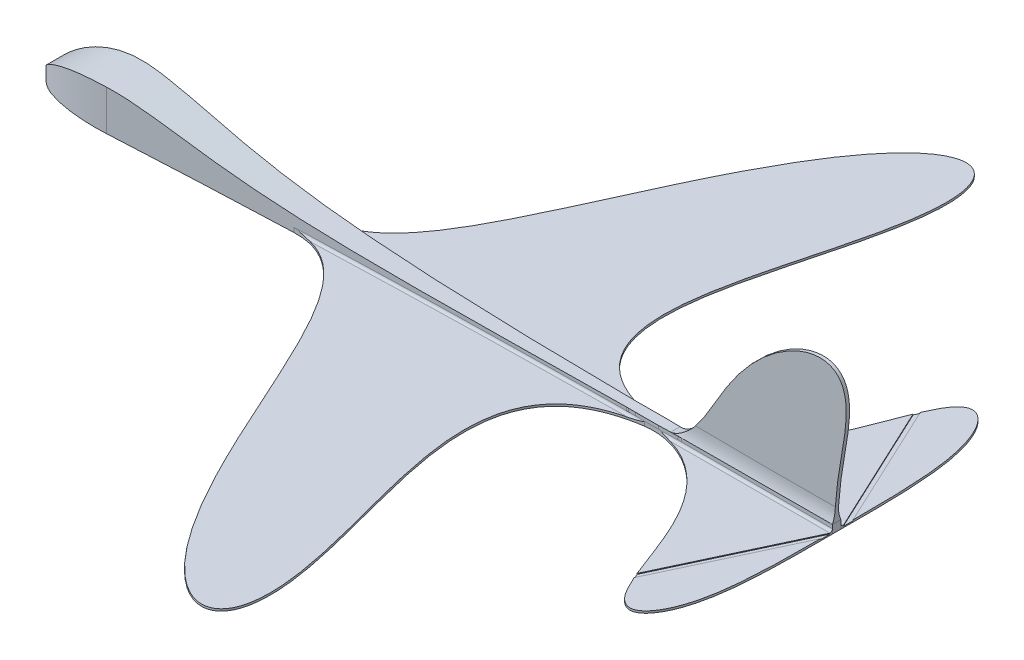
ISO-10303-21;
HEADER;
FILE_DESCRIPTION(('STEP AP214'),'2;1');
FILE_NAME('part.step','',(''),(''),'','','');
FILE_SCHEMA(('AUTOMOTIVE_DESIGN { 1 0 10303 214 1 1 1 1 }'));
ENDSEC;
DATA;
#1=APPLICATION_CONTEXT('core data for automotive mechanical design processes');
#2=APPLICATION_PROTOCOL_DEFINITION('international standard','automotive_design',2000,#1);
#3=PRODUCT_CONTEXT('',#1,'mechanical');
#4=PRODUCT('Part','Part','',(#3));
#5=PRODUCT_RELATED_PRODUCT_CATEGORY('part','',(#4));
#6=PRODUCT_DEFINITION_FORMATION('','',#4);
#7=PRODUCT_DEFINITION_CONTEXT('part definition',#1,'design');
#8=PRODUCT_DEFINITION('design','',#6,#7);
#9=PRODUCT_DEFINITION_SHAPE('','',#8);
#10=(LENGTH_UNIT() NAMED_UNIT(*) SI_UNIT(.MILLI.,.METRE.));
#11=(NAMED_UNIT(*) PLANE_ANGLE_UNIT() SI_UNIT($,.RADIAN.));
#12=(NAMED_UNIT(*) SI_UNIT($,.STERADIAN.) SOLID_ANGLE_UNIT());
#13=UNCERTAINTY_MEASURE_WITH_UNIT(LENGTH_MEASURE(1.E-05),#10,'distance_accuracy_value','');
#14=(GEOMETRIC_REPRESENTATION_CONTEXT(3) GLOBAL_UNCERTAINTY_ASSIGNED_CONTEXT((#13)) GLOBAL_UNIT_ASSIGNED_CONTEXT((#10,
#11,#12)) REPRESENTATION_CONTEXT('',''));
#15=CARTESIAN_POINT('',(0.,0.,0.));
#16=DIRECTION('',(0.,0.,1.));
#17=DIRECTION('',(1.,0.,0.));
#18=AXIS2_PLACEMENT_3D('',#15,#16,#17);
#19=CARTESIAN_POINT('',(49.7986873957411,10.,1.14106139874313));
#20=CARTESIAN_POINT('',(63.8228771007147,10.,-0.98154271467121));
#21=CARTESIAN_POINT('',(93.7057738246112,10.,15.1559834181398));
#22=CARTESIAN_POINT('',(67.3663506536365,10.,49.9540018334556));
#23=CARTESIAN_POINT('',(88.5355364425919,10.,60.0338854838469));
#24=CARTESIAN_POINT('',(93.0114888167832,10.,36.7268695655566));
#25=CARTESIAN_POINT('',(92.1067318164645,10.,34.2960283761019));
#26=CARTESIAN_POINT('',(94.9274139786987,10.,31.4449689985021));
#27=CARTESIAN_POINT('',(95.1214290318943,10.,20.1754608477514));
#28=CARTESIAN_POINT('',(95.,10.,1.));
#29=B_SPLINE_CURVE_WITH_KNOTS('',9,(#19,#20,#21,#22,#23,#24,#25,#26,#27,#28),.UNSPECIFIED.,.F.,
.F.,(10,10),(0.,1.),.UNSPECIFIED.);
#30=DIRECTION('',(0.,-1.,0.));
#31=VECTOR('',#30,1.);
#32=SURFACE_OF_LINEAR_EXTRUSION('',#29,#31);
#33=CARTESIAN_POINT('',(49.7986873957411,1.1,1.14106139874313));
#34=CARTESIAN_POINT('',(63.8228771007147,1.1,-0.98154271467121));
#35=CARTESIAN_POINT('',(93.7057738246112,1.1,15.1559834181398));
#36=CARTESIAN_POINT('',(67.3663506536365,1.1,49.9540018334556));
#37=CARTESIAN_POINT('',(88.5355364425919,1.1,60.0338854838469));
#38=CARTESIAN_POINT('',(93.0114888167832,1.1,36.7268695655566));
#39=CARTESIAN_POINT('',(92.1067318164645,1.1,34.2960283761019));
#40=CARTESIAN_POINT('',(94.9274139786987,1.1,31.4449689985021));
#41=CARTESIAN_POINT('',(95.1214290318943,1.1,20.1754608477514));
#42=CARTESIAN_POINT('',(95.,1.1,1.));
#43=B_SPLINE_CURVE_WITH_KNOTS('',9,(#33,#34,#35,#36,#37,#38,#39,#40,#41,#42),.UNSPECIFIED.,.F.,
.F.,(10,10),(0.,1.),.UNSPECIFIED.);
#44=CARTESIAN_POINT('',(49.7986874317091,1.1,1.14106139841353));
#45=VERTEX_POINT('',#44);
#46=CARTESIAN_POINT('',(53.5695412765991,1.1,1.10849549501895));
#47=VERTEX_POINT('',#46);
#48=EDGE_CURVE('E331',#45,#47,#43,.T.);
#49=ORIENTED_EDGE('',*,*,#48,.F.);
#50=DIRECTION('',(0.,-1.,0.));
#51=VECTOR('',#50,1.);
#52=CARTESIAN_POINT('',(49.7986874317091,0.5,1.14106139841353));
#53=LINE('',#52,#51);
#54=CARTESIAN_POINT('',(49.7986874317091,0.,1.14106139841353));
#55=VERTEX_POINT('',#54);
#56=EDGE_CURVE('E442',#45,#55,#53,.T.);
#57=ORIENTED_EDGE('',*,*,#56,.T.);
#58=CARTESIAN_POINT('',(49.7986873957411,0.,1.14106139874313));
#59=CARTESIAN_POINT('',(63.8228771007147,0.,-0.98154271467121));
#60=CARTESIAN_POINT('',(93.7057738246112,0.,15.1559834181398));
#61=CARTESIAN_POINT('',(67.3663506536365,0.,49.9540018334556));
#62=CARTESIAN_POINT('',(88.5355364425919,0.,60.0338854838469));
#63=CARTESIAN_POINT('',(93.0114888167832,0.,36.7268695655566));
#64=CARTESIAN_POINT('',(92.1067318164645,0.,34.2960283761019));
#65=CARTESIAN_POINT('',(94.9274139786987,0.,31.4449689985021));
#66=CARTESIAN_POINT('',(95.1214290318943,0.,20.1754608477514));
#67=CARTESIAN_POINT('',(95.,0.,1.));
#68=B_SPLINE_CURVE_WITH_KNOTS('',9,(#58,#59,#60,#61,#62,#63,#64,#65,#66,#67),.UNSPECIFIED.,.F.,
.F.,(10,10),(0.,1.),.UNSPECIFIED.);
#69=CARTESIAN_POINT('',(95.,0.,1.));
#70=VERTEX_POINT('',#69);
#71=EDGE_CURVE('E418',#55,#70,#68,.T.);
#72=ORIENTED_EDGE('',*,*,#71,.T.);
#73=DIRECTION('',(0.,-1.,0.));
#74=VECTOR('',#73,1.);
#75=CARTESIAN_POINT('',(95.,0.5,1.));
#76=LINE('',#75,#74);
#77=CARTESIAN_POINT('',(95.,1.1,1.));
#78=VERTEX_POINT('',#77);
#79=EDGE_CURVE('E1124',#78,#70,#76,.T.);
#80=ORIENTED_EDGE('',*,*,#79,.F.);
#81=CARTESIAN_POINT('',(11.1608035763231,1.1,1.71478946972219));
#82=CARTESIAN_POINT('',(11.1608035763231,0.500000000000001,1.71478946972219));
#83=CARTESIAN_POINT('',(11.1732831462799,0.5,2.31465967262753));
#84=CARTESIAN_POINT('',(16.4012319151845,1.1,1.60579272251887));
#85=CARTESIAN_POINT('',(16.4012319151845,0.5,1.60579272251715));
#86=CARTESIAN_POINT('',(16.4126964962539,0.5,2.20568401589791));
#87=CARTESIAN_POINT('',(21.6418988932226,1.1,1.51005090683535));
#88=CARTESIAN_POINT('',(21.6418988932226,0.5,1.51005090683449));
#89=CARTESIAN_POINT('',(21.6523781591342,0.5,2.10996014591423));
#90=CARTESIAN_POINT('',(32.123569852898,1.1,1.34368747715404));
#91=CARTESIAN_POINT('',(32.1235698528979,0.5,1.3436874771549));
#92=CARTESIAN_POINT('',(32.132132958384,0.5,1.94362714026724));
#93=CARTESIAN_POINT('',(37.3645738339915,1.1,1.2730658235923));
#94=CARTESIAN_POINT('',(37.3645738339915,0.5,1.27306582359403));
#95=CARTESIAN_POINT('',(37.3722060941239,0.5,1.87301796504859));
#96=CARTESIAN_POINT('',(47.8465412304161,1.1,1.15555556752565));
#97=CARTESIAN_POINT('',(47.8465412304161,0.5,1.15555556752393));
#98=CARTESIAN_POINT('',(47.8523614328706,0.5,1.75552802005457));
#99=CARTESIAN_POINT('',(53.0875046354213,1.1,1.1086658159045));
#100=CARTESIAN_POINT('',(53.0875046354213,0.5,1.10866581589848));
#101=CARTESIAN_POINT('',(53.0924436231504,0.5,1.70864610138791));
#102=CARTESIAN_POINT('',(63.5695355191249,1.1,1.03737718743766));
#103=CARTESIAN_POINT('',(63.5695355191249,0.5,1.03737718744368));
#104=CARTESIAN_POINT('',(63.5727574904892,0.5,1.63736915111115));
#105=CARTESIAN_POINT('',(68.8106029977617,1.1,1.01297829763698));
#106=CARTESIAN_POINT('',(68.8106029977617,0.5,1.01297829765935));
#107=CARTESIAN_POINT('',(68.8129891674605,0.5,1.61297410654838));
#108=CARTESIAN_POINT('',(77.5430445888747,1.1,0.99011078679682));
#109=CARTESIAN_POINT('',(77.5430445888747,0.5,0.990110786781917));
#110=CARTESIAN_POINT('',(77.544072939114,0.5,1.59011015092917));
#111=CARTESIAN_POINT('',(81.0344162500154,1.1,0.985704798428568));
#112=CARTESIAN_POINT('',(81.0344162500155,0.5,0.98570479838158));
#113=CARTESIAN_POINT('',(81.0349109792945,0.5,1.58570482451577));
#114=CARTESIAN_POINT('',(88.0171985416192,1.1,0.986056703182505));
#115=CARTESIAN_POINT('',(88.017198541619,0.5,0.986056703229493));
#116=CARTESIAN_POINT('',(88.0166435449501,0.5,1.5860566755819));
#117=CARTESIAN_POINT('',(91.5086091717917,1.1,0.990814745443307));
#118=CARTESIAN_POINT('',(91.5086091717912,0.5,0.990814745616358));
#119=CARTESIAN_POINT('',(91.50753807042,0.5,1.59081400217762));
#120=CARTESIAN_POINT('',(94.9999999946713,1.1,0.999999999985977));
#121=CARTESIAN_POINT('',(94.99999999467,0.5,1.00000000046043));
#122=CARTESIAN_POINT('',(94.9984210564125,0.5,1.59999792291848));
#123=CARTESIAN_POINT('',(101.989492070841,1.1,1.01839340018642));
#124=CARTESIAN_POINT('',(101.98949207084,0.5,1.0183934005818));
#125=CARTESIAN_POINT('',(101.98791313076,0.5,1.61839132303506));
#126=CARTESIAN_POINT('',(108.978984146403,1.1,1.03678680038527));
#127=CARTESIAN_POINT('',(108.978984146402,0.5,1.03678680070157));
#128=CARTESIAN_POINT('',(108.977405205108,0.5,1.63678472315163));
#129=CARTESIAN_POINT('',(122.957968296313,1.1,1.07357360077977));
#130=CARTESIAN_POINT('',(122.957968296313,0.5,1.07357360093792));
#131=CARTESIAN_POINT('',(122.956389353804,0.5,1.67357152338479));
#132=CARTESIAN_POINT('',(129.947460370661,1.1,1.09196700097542));
#133=CARTESIAN_POINT('',(129.94746037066,0.5,1.0919670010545));
#134=CARTESIAN_POINT('',(129.945881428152,0.5,1.69196492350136));
#135=CARTESIAN_POINT('',(136.936952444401,1.1,1.11036040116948));
#136=CARTESIAN_POINT('',(136.936952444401,0.5,1.11036040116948));
#137=CARTESIAN_POINT('',(136.9353735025,0.5,1.71035832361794));
#138=(BOUNDED_SURFACE() B_SPLINE_SURFACE(3,2,((#81,#82,#83),(#84,#85,#86),(#87,#88,#89),(#90,
#91,#92),(#93,#94,#95),(#96,#97,#98),(#99,#100,#101),(#102,#103,#104),(#105,#106,#107),(#108,
#109,#110),(#111,#112,#113),(#114,#115,#116),(#117,#118,#119),(#120,#121,#122),(#123,#124,#125),
(#126,#127,#128),(#129,#130,#131),(#132,#133,#134),(#135,#136,#137)),.UNSPECIFIED.,.F.,.F.,
.F.) B_SPLINE_SURFACE_WITH_KNOTS((4,2,2,2,2,2,3,2,4),(3,3),(0.,15.7216122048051,
31.4431996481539,47.1640257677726,62.8848428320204,73.3573541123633,83.8300358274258,
104.79858465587,125.767133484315),(0.,1.),
.UNSPECIFIED.) GEOMETRIC_REPRESENTATION_ITEM() RATIONAL_B_SPLINE_SURFACE(((1.,0.707106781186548,
1.),(1.,0.707106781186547,1.),(1.,0.707106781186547,1.),(1.,0.707106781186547,1.),(1.,
0.707106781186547,1.),(1.,0.707106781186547,1.),(1.,0.707106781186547,1.),(1.,0.707106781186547,
1.),(1.,0.707106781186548,1.),(1.,0.707106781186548,1.),(1.,0.707106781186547,1.),(1.,
0.707106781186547,1.),(1.,0.707106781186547,1.),(1.,0.707106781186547,1.),(1.,0.707106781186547,
1.),(1.,0.707106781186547,1.),(1.,0.707106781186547,1.),(1.,0.707106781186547,1.),(1.,
0.707106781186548,1.))) REPRESENTATION_ITEM('') SURFACE());
#139=CARTESIAN_POINT('',(95.,1.1,1.));
#140=CARTESIAN_POINT('',(94.9999997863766,1.06624628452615,0.99997132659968));
#141=CARTESIAN_POINT('',(95.0000180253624,1.03250113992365,1.0028466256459));
#142=CARTESIAN_POINT('',(95.0000898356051,0.965990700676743,1.01419366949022));
#143=CARTESIAN_POINT('',(95.0001433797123,0.933224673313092,1.02266111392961));
#144=CARTESIAN_POINT('',(95.0002842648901,0.86956544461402,1.04498680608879));
#145=CARTESIAN_POINT('',(95.000371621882,0.838673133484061,1.05884759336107));
#146=CARTESIAN_POINT('',(95.0005771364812,0.779658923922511,1.09155435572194));
#147=CARTESIAN_POINT('',(95.0006952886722,0.751536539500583,1.11039945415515));
#148=CARTESIAN_POINT('',(95.0009585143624,0.698854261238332,1.15254335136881));
#149=CARTESIAN_POINT('',(95.0011035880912,0.674294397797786,1.17584218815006));
#150=CARTESIAN_POINT('',(95.0014159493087,0.62942973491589,1.22623753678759));
#151=CARTESIAN_POINT('',(95.0015832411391,0.609125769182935,1.25333479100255));
#152=CARTESIAN_POINT('',(95.0019346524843,0.573351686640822,1.31055703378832));
#153=CARTESIAN_POINT('',(95.0021187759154,0.557882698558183,1.34068272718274));
#154=CARTESIAN_POINT('',(95.002497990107,0.53222986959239,1.40309752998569));
#155=CARTESIAN_POINT('',(95.0026930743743,0.52204293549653,1.43538536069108));
#156=CARTESIAN_POINT('',(95.003020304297,0.50977424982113,1.48989396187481));
#157=CARTESIAN_POINT('',(95.0031511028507,0.506111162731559,1.51177190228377));
#158=CARTESIAN_POINT('',(95.0034129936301,0.501224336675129,1.55576741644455));
#159=CARTESIAN_POINT('',(95.0035440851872,0.49999718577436,1.57788461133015));
#160=CARTESIAN_POINT('',(95.0036746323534,0.5,1.60001174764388));
#161=B_SPLINE_CURVE_WITH_KNOTS('',3,(#139,#140,#141,#142,#143,#144,#145,#146,#147,#148,#149,
#150,#151,#152,#153,#154,#155,#156,#157,#158,#159,#160),.UNSPECIFIED.,.F.,.F.,(4,2,2,2,2,2,2,2,
2,2,4),(0.,0.101126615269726,0.202175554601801,0.303272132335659,0.404350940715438,
0.505430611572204,0.606530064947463,0.707653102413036,0.808716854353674,0.875139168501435,
0.941468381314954),.UNSPECIFIED.);
#162=CARTESIAN_POINT('',(95.0036746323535,0.5,1.60001174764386));
#163=VERTEX_POINT('',#162);
#164=EDGE_CURVE('E1452',#78,#163,#161,.T.);
#165=ORIENTED_EDGE('',*,*,#164,.T.);
#166=DIRECTION('',(0.,1.,0.));
#167=VECTOR('',#166,1.);
#168=CARTESIAN_POINT('',(95.0036746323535,0.3,1.60001174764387));
#169=LINE('',#168,#167);
#170=CARTESIAN_POINT('',(95.0036746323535,0.3,1.60001174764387));
#171=VERTEX_POINT('',#170);
#172=EDGE_CURVE('E996',#171,#163,#169,.T.);
#173=ORIENTED_EDGE('',*,*,#172,.F.);
#174=CARTESIAN_POINT('',(49.7986873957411,0.3,1.14106139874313));
#175=CARTESIAN_POINT('',(63.8228771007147,0.3,-0.98154271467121));
#176=CARTESIAN_POINT('',(93.7057738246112,0.3,15.1559834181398));
#177=CARTESIAN_POINT('',(67.3663506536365,0.3,49.9540018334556));
#178=CARTESIAN_POINT('',(88.5355364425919,0.3,60.0338854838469));
#179=CARTESIAN_POINT('',(93.0114888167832,0.3,36.7268695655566));
#180=CARTESIAN_POINT('',(92.1067318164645,0.3,34.2960283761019));
#181=CARTESIAN_POINT('',(94.9274139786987,0.3,31.4449689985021));
#182=CARTESIAN_POINT('',(95.1214290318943,0.3,20.1754608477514));
#183=CARTESIAN_POINT('',(95.,0.3,1.));
#184=B_SPLINE_CURVE_WITH_KNOTS('',9,(#174,#175,#176,#177,#178,#179,#180,#181,#182,#183),
.UNSPECIFIED.,.F.,.F.,(10,10),(0.,1.),.UNSPECIFIED.);
#185=CARTESIAN_POINT('',(95.0147055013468,0.3,3.93320555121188));
#186=VERTEX_POINT('',#185);
#187=EDGE_CURVE('E968',#186,#171,#184,.T.);
#188=ORIENTED_EDGE('',*,*,#187,.F.);
#189=DIRECTION('',(0.,1.,0.));
#190=VECTOR('',#189,1.);
#191=CARTESIAN_POINT('',(95.0147055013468,0.3,3.93320555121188));
#192=LINE('',#191,#190);
#193=CARTESIAN_POINT('',(95.0147055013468,0.5,3.93320555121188));
#194=VERTEX_POINT('',#193);
#195=EDGE_CURVE('E999',#186,#194,#192,.T.);
#196=ORIENTED_EDGE('',*,*,#195,.T.);
#197=CARTESIAN_POINT('',(49.7986873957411,0.5,1.14106139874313));
#198=CARTESIAN_POINT('',(63.8228771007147,0.5,-0.98154271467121));
#199=CARTESIAN_POINT('',(93.7057738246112,0.5,15.1559834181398));
#200=CARTESIAN_POINT('',(67.3663506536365,0.5,49.9540018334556));
#201=CARTESIAN_POINT('',(88.5355364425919,0.5,60.0338854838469));
#202=CARTESIAN_POINT('',(93.0114888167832,0.5,36.7268695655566));
#203=CARTESIAN_POINT('',(92.1067318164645,0.5,34.2960283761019));
#204=CARTESIAN_POINT('',(94.9274139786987,0.5,31.4449689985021));
#205=CARTESIAN_POINT('',(95.1214290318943,0.5,20.1754608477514));
#206=CARTESIAN_POINT('',(95.,0.5,1.));
#207=B_SPLINE_CURVE_WITH_KNOTS('',9,(#197,#198,#199,#200,#201,#202,#203,#204,#205,#206),
.UNSPECIFIED.,.F.,.F.,(10,10),(0.,1.),.UNSPECIFIED.);
#208=CARTESIAN_POINT('',(80.6750372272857,0.5,34.5348658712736));
#209=VERTEX_POINT('',#208);
#210=EDGE_CURVE('E1300',#209,#194,#207,.T.);
#211=ORIENTED_EDGE('',*,*,#210,.F.);
#212=DIRECTION('',(0.,1.,0.));
#213=VECTOR('',#212,1.);
#214=CARTESIAN_POINT('',(80.6750372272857,0.3,34.5348658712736));
#215=LINE('',#214,#213);
#216=CARTESIAN_POINT('',(80.6750372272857,0.3,34.5348658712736));
#217=VERTEX_POINT('',#216);
#218=EDGE_CURVE('E988',#217,#209,#215,.T.);
#219=ORIENTED_EDGE('',*,*,#218,.F.);
#220=CARTESIAN_POINT('',(80.152615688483,0.3,33.2930085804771));
#221=VERTEX_POINT('',#220);
#222=EDGE_CURVE('E976',#221,#217,#184,.T.);
#223=ORIENTED_EDGE('',*,*,#222,.F.);
#224=DIRECTION('',(0.,1.,0.));
#225=VECTOR('',#224,1.);
#226=CARTESIAN_POINT('',(80.152615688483,0.3,33.2930085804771));
#227=LINE('',#226,#225);
#228=CARTESIAN_POINT('',(80.152615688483,0.5,33.2930085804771));
#229=VERTEX_POINT('',#228);
#230=EDGE_CURVE('E992',#221,#229,#227,.T.);
#231=ORIENTED_EDGE('',*,*,#230,.T.);
#232=CARTESIAN_POINT('',(56.5046110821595,0.5,1.68589687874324));
#233=VERTEX_POINT('',#232);
#234=EDGE_CURVE('E1241',#233,#229,#207,.T.);
#235=ORIENTED_EDGE('',*,*,#234,.F.);
#236=CARTESIAN_POINT('',(56.5046110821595,0.5,1.68589687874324));
#237=CARTESIAN_POINT('',(56.4079165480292,0.500027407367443,1.65896902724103));
#238=CARTESIAN_POINT('',(56.3110343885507,0.50190786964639,1.6327690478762));
#239=CARTESIAN_POINT('',(56.1170098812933,0.508998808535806,1.581865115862));
#240=CARTESIAN_POINT('',(56.0198675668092,0.514208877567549,1.55716098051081));
#241=CARTESIAN_POINT('',(55.8254598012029,0.527579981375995,1.50929366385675));
#242=CARTESIAN_POINT('',(55.7281944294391,0.535739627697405,1.48612976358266));
#243=CARTESIAN_POINT('',(55.5335758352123,0.554796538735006,1.4413566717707));
#244=CARTESIAN_POINT('',(55.4362226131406,0.565693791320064,1.41974747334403));
#245=CARTESIAN_POINT('',(55.2395463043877,0.590357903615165,1.37768820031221));
#246=CARTESIAN_POINT('',(55.1402230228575,0.604178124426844,1.35727022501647));
#247=CARTESIAN_POINT('',(54.9416826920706,0.634595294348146,1.3181044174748));
#248=CARTESIAN_POINT('',(54.8424656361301,0.651192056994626,1.29935647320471));
#249=CARTESIAN_POINT('',(54.6083642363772,0.693934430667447,1.25707280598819));
#250=CARTESIAN_POINT('',(54.4735742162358,0.721361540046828,1.23426170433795));
#251=CARTESIAN_POINT('',(54.248402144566,0.773925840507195,1.19871659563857));
#252=CARTESIAN_POINT('',(54.1576776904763,0.796963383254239,1.18510088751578));
#253=CARTESIAN_POINT('',(54.0065737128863,0.840592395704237,1.163585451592));
#254=CARTESIAN_POINT('',(53.9458122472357,0.859590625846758,1.15525500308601));
#255=CARTESIAN_POINT('',(53.8449510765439,0.895595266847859,1.1419454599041));
#256=CARTESIAN_POINT('',(53.804431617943,0.91131039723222,1.13674371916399));
#257=CARTESIAN_POINT('',(53.7374238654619,0.941277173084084,1.12837019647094));
#258=CARTESIAN_POINT('',(53.7105009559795,0.954456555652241,1.12507129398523));
#259=CARTESIAN_POINT('',(53.6711079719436,0.977156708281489,1.12033124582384));
#260=CARTESIAN_POINT('',(53.6579173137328,0.985386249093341,1.11876002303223));
#261=CARTESIAN_POINT('',(53.632526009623,1.00326819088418,1.1157631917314));
#262=CARTESIAN_POINT('',(53.6203214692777,1.0129145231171,1.11433700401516));
#263=CARTESIAN_POINT('',(53.6046826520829,1.0280570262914,1.11252381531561));
#264=CARTESIAN_POINT('',(53.6003540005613,1.03260340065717,1.11202377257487));
#265=CARTESIAN_POINT('',(53.5922171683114,1.04216057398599,1.11108654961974));
#266=CARTESIAN_POINT('',(53.5884091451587,1.04717151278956,1.11064938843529));
#267=CARTESIAN_POINT('',(53.5821302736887,1.05685605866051,1.10993029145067));
#268=CARTESIAN_POINT('',(53.5795426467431,1.06145158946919,1.10963466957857));
#269=CARTESIAN_POINT('',(53.5751421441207,1.07099460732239,1.10913266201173));
#270=CARTESIAN_POINT('',(53.5733258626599,1.07594043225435,1.10892588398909));
#271=CARTESIAN_POINT('',(53.5712058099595,1.08410294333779,1.1086846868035));
#272=CARTESIAN_POINT('',(53.5705882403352,1.08723766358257,1.10861447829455));
#273=CARTESIAN_POINT('',(53.5697523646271,1.0935797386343,1.1085194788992));
#274=CARTESIAN_POINT('',(53.5695365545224,1.09678742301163,1.10849497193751));
#275=CARTESIAN_POINT('',(53.5695412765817,1.09999999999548,1.10849549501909));
#276=B_SPLINE_CURVE_WITH_KNOTS('',3,(#236,#237,#238,#239,#240,#241,#242,#243,#244,#245,#246,
#247,#248,#249,#250,#251,#252,#253,#254,#255,#256,#257,#258,#259,#260,#261,#262,#263,#264,#265,
#266,#267,#268,#269,#270,#271,#272,#273,#274,#275),.UNSPECIFIED.,.F.,.F.,(4,2,2,2,2,2,2,2,2,2,2,
2,2,2,2,2,2,2,2,4),(0.,0.30108164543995,0.602126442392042,0.903029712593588,1.20393164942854,
1.51089218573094,1.81783211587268,2.23591893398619,2.5195655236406,2.71205552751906,
2.84326695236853,2.93355462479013,2.980395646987,3.02704158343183,3.04590711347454,
3.0647783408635,3.08057464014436,3.09630044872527,3.10586325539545,3.11548527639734),.UNSPECIFIED.);
#277=EDGE_CURVE('E567',#233,#47,#276,.T.);
#278=ORIENTED_EDGE('',*,*,#277,.T.);
#279=EDGE_LOOP('',(#49,#57,#72,#80,#165,#173,#188,#196,#211,#219,#223,#231,#235,#278));
#280=FACE_BOUND('',#279,.T.);
#281=ADVANCED_FACE('F47',(#280),#32,.F.);
#282=CARTESIAN_POINT('',(49.7986873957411,10.,-1.14106139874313));
#283=CARTESIAN_POINT('',(63.8228771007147,10.,0.98154271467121));
#284=CARTESIAN_POINT('',(93.7057738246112,10.,-15.1559834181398));
#285=CARTESIAN_POINT('',(67.3663506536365,10.,-49.9540018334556));
#286=CARTESIAN_POINT('',(88.5355364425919,10.,-60.0338854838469));
#287=CARTESIAN_POINT('',(93.0114888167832,10.,-36.7268695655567));
#288=CARTESIAN_POINT('',(92.1067318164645,10.,-34.296028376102));
#289=CARTESIAN_POINT('',(94.9274139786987,10.,-31.4449689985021));
#290=CARTESIAN_POINT('',(95.1214290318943,10.,-20.1754608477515));
#291=CARTESIAN_POINT('',(95.,10.,-1.));
#292=B_SPLINE_CURVE_WITH_KNOTS('',9,(#282,#283,#284,#285,#286,#287,#288,#289,#290,#291),
.UNSPECIFIED.,.F.,.F.,(10,10),(0.,1.),.UNSPECIFIED.);
#293=DIRECTION('',(0.,-1.,0.));
#294=VECTOR('',#293,1.);
#295=SURFACE_OF_LINEAR_EXTRUSION('',#292,#294);
#296=DIRECTION('',(0.,-1.,0.));
#297=VECTOR('',#296,1.);
#298=CARTESIAN_POINT('',(49.7986874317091,0.5,-1.14106139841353));
#299=LINE('',#298,#297);
#300=CARTESIAN_POINT('',(49.7986874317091,1.1,-1.14106139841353));
#301=VERTEX_POINT('',#300);
#302=CARTESIAN_POINT('',(49.7986874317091,0.,-1.14106139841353));
#303=VERTEX_POINT('',#302);
#304=EDGE_CURVE('E546',#301,#303,#299,.T.);
#305=ORIENTED_EDGE('',*,*,#304,.F.);
#306=CARTESIAN_POINT('',(49.7986873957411,1.1,-1.14106139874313));
#307=CARTESIAN_POINT('',(63.8228771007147,1.1,0.98154271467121));
#308=CARTESIAN_POINT('',(93.7057738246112,1.1,-15.1559834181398));
#309=CARTESIAN_POINT('',(67.3663506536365,1.1,-49.9540018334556));
#310=CARTESIAN_POINT('',(88.5355364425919,1.1,-60.0338854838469));
#311=CARTESIAN_POINT('',(93.0114888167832,1.1,-36.7268695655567));
#312=CARTESIAN_POINT('',(92.1067318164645,1.1,-34.296028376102));
#313=CARTESIAN_POINT('',(94.9274139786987,1.1,-31.4449689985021));
#314=CARTESIAN_POINT('',(95.1214290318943,1.1,-20.1754608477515));
#315=CARTESIAN_POINT('',(95.,1.1,-1.));
#316=B_SPLINE_CURVE_WITH_KNOTS('',9,(#306,#307,#308,#309,#310,#311,#312,#313,#314,#315),
.UNSPECIFIED.,.F.,.F.,(10,10),(0.,1.),.UNSPECIFIED.);
#317=CARTESIAN_POINT('',(53.5695412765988,1.1,-1.10849549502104));
#318=VERTEX_POINT('',#317);
#319=EDGE_CURVE('E548',#301,#318,#316,.T.);
#320=ORIENTED_EDGE('',*,*,#319,.T.);
#321=CARTESIAN_POINT('',(136.936952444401,1.1,-1.11036040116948));
#322=CARTESIAN_POINT('',(136.936952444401,0.5,-1.11036040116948));
#323=CARTESIAN_POINT('',(136.9353735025,0.5,-1.71035832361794));
#324=CARTESIAN_POINT('',(129.947460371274,1.1,-1.09196700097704));
#325=CARTESIAN_POINT('',(129.947460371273,0.5,-1.09196700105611));
#326=CARTESIAN_POINT('',(129.945881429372,0.5,-1.69196492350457));
#327=CARTESIAN_POINT('',(122.957968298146,1.1,-1.07357360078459));
#328=CARTESIAN_POINT('',(122.957968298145,0.5,-1.07357360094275));
#329=CARTESIAN_POINT('',(122.956389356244,0.5,-1.67357152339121));
#330=CARTESIAN_POINT('',(108.978984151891,1.1,-1.03678680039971));
#331=CARTESIAN_POINT('',(108.97898415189,0.5,-1.03678680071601));
#332=CARTESIAN_POINT('',(108.977405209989,0.5,-1.63678472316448));
#333=CARTESIAN_POINT('',(101.989492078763,1.1,-1.01839340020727));
#334=CARTESIAN_POINT('',(101.989492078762,0.5,-1.01839340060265));
#335=CARTESIAN_POINT('',(101.987913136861,0.5,-1.61839132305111));
#336=CARTESIAN_POINT('',(95.0000000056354,1.1,-1.00000000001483));
#337=CARTESIAN_POINT('',(95.0000000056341,0.5,-1.00000000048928));
#338=CARTESIAN_POINT('',(94.9984210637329,0.5,-1.59999792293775));
#339=CARTESIAN_POINT('',(91.508609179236,1.1,-0.990814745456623));
#340=CARTESIAN_POINT('',(91.5086091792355,0.499999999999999,-0.990814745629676));
#341=CARTESIAN_POINT('',(91.5075380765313,0.5,-1.59081400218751));
#342=CARTESIAN_POINT('',(88.0171985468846,1.1,-0.986056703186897));
#343=CARTESIAN_POINT('',(88.0171985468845,0.5,-0.986056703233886));
#344=CARTESIAN_POINT('',(88.0166435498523,0.5,-1.58605667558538));
#345=CARTESIAN_POINT('',(81.0344162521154,1.1,-0.985704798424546));
#346=CARTESIAN_POINT('',(81.0344162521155,0.5,-0.985704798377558));
#347=CARTESIAN_POINT('',(81.0349109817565,0.5,-1.58570482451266));
#348=CARTESIAN_POINT('',(77.543044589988,1.1,-0.990110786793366));
#349=CARTESIAN_POINT('',(77.5430445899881,0.500000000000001,-0.990110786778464));
#350=CARTESIAN_POINT('',(77.544072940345,0.5,-1.59011015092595));
#351=CARTESIAN_POINT('',(68.8106029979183,1.1,-1.01297829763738));
#352=CARTESIAN_POINT('',(68.8106029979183,0.500000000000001,-1.01297829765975));
#353=CARTESIAN_POINT('',(68.8129891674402,0.5,-1.61297410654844));
#354=CARTESIAN_POINT('',(63.5695355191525,1.1,-1.03737718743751));
#355=CARTESIAN_POINT('',(63.5695355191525,0.5,-1.03737718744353));
#356=CARTESIAN_POINT('',(63.5727574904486,0.5,-1.63736915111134));
#357=CARTESIAN_POINT('',(53.0875046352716,1.1,-1.10866581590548));
#358=CARTESIAN_POINT('',(53.0875046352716,0.5,-1.10866581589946));
#359=CARTESIAN_POINT('',(53.092443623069,0.5,-1.70864610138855));
#360=CARTESIAN_POINT('',(47.846541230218,1.1,-1.1555555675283));
#361=CARTESIAN_POINT('',(47.846541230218,0.5,-1.15555556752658));
#362=CARTESIAN_POINT('',(47.8523614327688,0.5,-1.75552802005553));
#363=CARTESIAN_POINT('',(37.3645738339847,1.1,-1.27306582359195));
#364=CARTESIAN_POINT('',(37.3645738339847,0.5,-1.27306582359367));
#365=CARTESIAN_POINT('',(37.3722060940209,0.5,-1.87301796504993));
#366=CARTESIAN_POINT('',(32.1235698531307,1.1,-1.34368747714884));
#367=CARTESIAN_POINT('',(32.1235698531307,0.5,-1.3436874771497));
#368=CARTESIAN_POINT('',(32.1321329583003,0.5,-1.94362714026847));
#369=CARTESIAN_POINT('',(21.6418988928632,1.1,-1.51005090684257));
#370=CARTESIAN_POINT('',(21.6418988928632,0.5,-1.51005090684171));
#371=CARTESIAN_POINT('',(21.6523781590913,0.5,-2.10996014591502));
#372=CARTESIAN_POINT('',(16.4012319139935,1.1,-1.60579272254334));
#373=CARTESIAN_POINT('',(16.4012319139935,0.5,-1.60579272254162));
#374=CARTESIAN_POINT('',(16.4126964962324,0.5,-2.20568401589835));
#375=CARTESIAN_POINT('',(11.1608035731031,1.1,-1.71478946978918));
#376=CARTESIAN_POINT('',(11.1608035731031,0.500000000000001,-1.71478946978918));
#377=CARTESIAN_POINT('',(11.1732831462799,0.5,-2.31465967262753));
#378=(BOUNDED_SURFACE() B_SPLINE_SURFACE(3,2,((#321,#322,#323),(#324,#325,#326),(#327,#328,
#329),(#330,#331,#332),(#333,#334,#335),(#336,#337,#338),(#339,#340,#341),(#342,#343,#344),
(#345,#346,#347),(#348,#349,#350),(#351,#352,#353),(#354,#355,#356),(#357,#358,#359),(#360,#361,
#362),(#363,#364,#365),(#366,#367,#368),(#369,#370,#371),(#372,#373,#374),(#375,#376,#377)),
.UNSPECIFIED.,.F.,.F.,.F.) B_SPLINE_SURFACE_WITH_KNOTS((4,2,3,2,2,2,2,2,4),(3,3),(0.,
20.9685488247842,41.9370976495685,52.4097793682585,62.8822906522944,78.6031077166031,
94.3239338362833,110.045521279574,125.767133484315),(0.,1.),
.UNSPECIFIED.) GEOMETRIC_REPRESENTATION_ITEM() RATIONAL_B_SPLINE_SURFACE(((1.,0.707106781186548,
1.),(1.,0.707106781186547,1.),(1.,0.707106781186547,1.),(1.,0.707106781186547,1.),(1.,
0.707106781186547,1.),(1.,0.707106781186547,1.),(1.,0.707106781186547,1.),(1.,0.707106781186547,
1.),(1.,0.707106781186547,1.),(1.,0.707106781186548,1.),(1.,0.707106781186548,1.),(1.,
0.707106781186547,1.),(1.,0.707106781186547,1.),(1.,0.707106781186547,1.),(1.,0.707106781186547,
1.),(1.,0.707106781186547,1.),(1.,0.707106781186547,1.),(1.,0.707106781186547,1.),(1.,
0.707106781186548,1.))) REPRESENTATION_ITEM('') SURFACE());
#379=CARTESIAN_POINT('',(53.5695412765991,1.1,-1.10849549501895));
#380=CARTESIAN_POINT('',(53.5695238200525,1.09520281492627,-1.10849356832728));
#381=CARTESIAN_POINT('',(53.5700122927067,1.09043097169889,-1.10854900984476));
#382=CARTESIAN_POINT('',(53.5718370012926,1.08112802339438,-1.10875646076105));
#383=CARTESIAN_POINT('',(53.5731598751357,1.07659432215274,-1.10890694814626));
#384=CARTESIAN_POINT('',(53.5769990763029,1.06648128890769,-1.10934437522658));
#385=CARTESIAN_POINT('',(53.5797544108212,1.06099642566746,-1.10965871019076));
#386=CARTESIAN_POINT('',(53.586088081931,1.05050107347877,-1.11038329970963));
#387=CARTESIAN_POINT('',(53.5896720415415,1.04549417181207,-1.11079420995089));
#388=CARTESIAN_POINT('',(53.6008321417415,1.03164682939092,-1.11207793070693));
#389=CARTESIAN_POINT('',(53.6091089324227,1.0233892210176,-1.11303482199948));
#390=CARTESIAN_POINT('',(53.6266391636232,1.00801229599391,-1.11507598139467));
#391=CARTESIAN_POINT('',(53.6358962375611,1.00089747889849,-1.11616072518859));
#392=CARTESIAN_POINT('',(53.6630888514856,0.981740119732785,-1.11937085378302));
#393=CARTESIAN_POINT('',(53.6816906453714,0.970671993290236,-1.12159452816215));
#394=CARTESIAN_POINT('',(53.7197471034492,0.950117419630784,-1.12620893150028));
#395=CARTESIAN_POINT('',(53.7392041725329,0.94063584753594,-1.1286001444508));
#396=CARTESIAN_POINT('',(53.7787019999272,0.922702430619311,-1.1335228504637));
#397=CARTESIAN_POINT('',(53.7987454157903,0.914256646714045,-1.13605505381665));
#398=CARTESIAN_POINT('',(53.8390997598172,0.898162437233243,-1.14122447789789));
#399=CARTESIAN_POINT('',(53.8594103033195,0.890512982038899,-1.14386155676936));
#400=CARTESIAN_POINT('',(53.9201651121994,0.868619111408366,-1.15185777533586));
#401=CARTESIAN_POINT('',(53.9608982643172,0.855230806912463,-1.15735985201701));
#402=CARTESIAN_POINT('',(54.0427874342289,0.829963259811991,-1.1687113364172));
#403=CARTESIAN_POINT('',(54.083943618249,0.818084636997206,-1.1745608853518));
#404=CARTESIAN_POINT('',(54.2079093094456,0.784071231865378,-1.19262044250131));
#405=CARTESIAN_POINT('',(54.2911015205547,0.763596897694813,-1.20532633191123));
#406=CARTESIAN_POINT('',(54.457701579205,0.725613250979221,-1.23195615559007));
#407=CARTESIAN_POINT('',(54.5411082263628,0.708096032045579,-1.2458766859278));
#408=CARTESIAN_POINT('',(54.7081030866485,0.67540438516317,-1.27492672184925));
#409=CARTESIAN_POINT('',(54.7916911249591,0.660228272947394,-1.29005534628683));
#410=CARTESIAN_POINT('',(55.0114445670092,0.623038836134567,-1.33137296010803));
#411=CARTESIAN_POINT('',(55.1477115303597,0.602705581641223,-1.35854875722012));
#412=CARTESIAN_POINT('',(55.4202999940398,0.567139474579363,-1.41601017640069));
#413=CARTESIAN_POINT('',(55.5566214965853,0.551908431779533,-1.44629689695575));
#414=CARTESIAN_POINT('',(55.8285243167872,0.526914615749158,-1.50978370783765));
#415=CARTESIAN_POINT('',(55.9641064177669,0.517130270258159,-1.54297169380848));
#416=CARTESIAN_POINT('',(56.1671187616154,0.507041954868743,-1.5949455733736));
#417=CARTESIAN_POINT('',(56.2347212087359,0.504443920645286,-1.61263323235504));
#418=CARTESIAN_POINT('',(56.3697833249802,0.500925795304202,-1.6487286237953));
#419=CARTESIAN_POINT('',(56.437242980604,0.500005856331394,-1.6671364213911));
#420=CARTESIAN_POINT('',(56.5046110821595,0.500000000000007,-1.68589687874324));
#421=B_SPLINE_CURVE_WITH_KNOTS('',3,(#379,#380,#381,#382,#383,#384,#385,#386,#387,#388,#389,
#390,#391,#392,#393,#394,#395,#396,#397,#398,#399,#400,#401,#402,#403,#404,#405,#406,#407,#408,
#409,#410,#411,#412,#413,#414,#415,#416,#417,#418,#419,#420),.UNSPECIFIED.,.F.,.F.,(4,2,2,2,2,2,
2,2,2,2,2,2,2,2,2,2,2,2,2,2,4),(0.,0.0143256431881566,0.028427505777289,0.046760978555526,
0.0652227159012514,0.100219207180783,0.135350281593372,0.200452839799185,0.265751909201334,
0.331416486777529,0.396995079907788,0.526626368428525,0.65631070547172,0.9160433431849,
1.17507014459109,1.43390971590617,1.85505936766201,2.2763582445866,2.69597642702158,
2.9057345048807,3.11551159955),.UNSPECIFIED.);
#422=CARTESIAN_POINT('',(56.5046110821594,0.5,-1.68589687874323));
#423=VERTEX_POINT('',#422);
#424=EDGE_CURVE('E518',#318,#423,#421,.T.);
#425=ORIENTED_EDGE('',*,*,#424,.T.);
#426=CARTESIAN_POINT('',(49.7986873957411,0.5,-1.14106139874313));
#427=CARTESIAN_POINT('',(63.8228771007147,0.5,0.98154271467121));
#428=CARTESIAN_POINT('',(93.7057738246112,0.5,-15.1559834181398));
#429=CARTESIAN_POINT('',(67.3663506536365,0.5,-49.9540018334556));
#430=CARTESIAN_POINT('',(88.5355364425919,0.5,-60.0338854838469));
#431=CARTESIAN_POINT('',(93.0114888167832,0.5,-36.7268695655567));
#432=CARTESIAN_POINT('',(92.1067318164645,0.5,-34.296028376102));
#433=CARTESIAN_POINT('',(94.9274139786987,0.5,-31.4449689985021));
#434=CARTESIAN_POINT('',(95.1214290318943,0.5,-20.1754608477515));
#435=CARTESIAN_POINT('',(95.,0.5,-1.));
#436=B_SPLINE_CURVE_WITH_KNOTS('',9,(#426,#427,#428,#429,#430,#431,#432,#433,#434,#435),
.UNSPECIFIED.,.F.,.F.,(10,10),(0.,1.),.UNSPECIFIED.);
#437=CARTESIAN_POINT('',(80.152615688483,0.5,-33.2930085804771));
#438=VERTEX_POINT('',#437);
#439=EDGE_CURVE('E1270',#423,#438,#436,.T.);
#440=ORIENTED_EDGE('',*,*,#439,.T.);
#441=DIRECTION('',(0.,1.,0.));
#442=VECTOR('',#441,1.);
#443=CARTESIAN_POINT('',(80.152615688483,0.3,-33.2930085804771));
#444=LINE('',#443,#442);
#445=CARTESIAN_POINT('',(80.152615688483,0.3,-33.2930085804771));
#446=VERTEX_POINT('',#445);
#447=EDGE_CURVE('E958',#446,#438,#444,.T.);
#448=ORIENTED_EDGE('',*,*,#447,.F.);
#449=CARTESIAN_POINT('',(49.7986873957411,0.3,-1.14106139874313));
#450=CARTESIAN_POINT('',(63.8228771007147,0.3,0.98154271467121));
#451=CARTESIAN_POINT('',(93.7057738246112,0.3,-15.1559834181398));
#452=CARTESIAN_POINT('',(67.3663506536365,0.3,-49.9540018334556));
#453=CARTESIAN_POINT('',(88.5355364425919,0.3,-60.0338854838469));
#454=CARTESIAN_POINT('',(93.0114888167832,0.3,-36.7268695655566));
#455=CARTESIAN_POINT('',(92.1067318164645,0.3,-34.2960283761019));
#456=CARTESIAN_POINT('',(94.9274139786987,0.3,-31.4449689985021));
#457=CARTESIAN_POINT('',(95.1214290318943,0.3,-20.1754608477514));
#458=CARTESIAN_POINT('',(95.,0.3,-1.));
#459=B_SPLINE_CURVE_WITH_KNOTS('',9,(#449,#450,#451,#452,#453,#454,#455,#456,#457,#458),
.UNSPECIFIED.,.F.,.F.,(10,10),(0.,1.),.UNSPECIFIED.);
#460=CARTESIAN_POINT('',(80.6750372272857,0.3,-34.5348658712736));
#461=VERTEX_POINT('',#460);
#462=EDGE_CURVE('E931',#446,#461,#459,.T.);
#463=ORIENTED_EDGE('',*,*,#462,.T.);
#464=DIRECTION('',(0.,1.,0.));
#465=VECTOR('',#464,1.);
#466=CARTESIAN_POINT('',(80.6750372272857,0.3,-34.5348658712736));
#467=LINE('',#466,#465);
#468=CARTESIAN_POINT('',(80.6750372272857,0.5,-34.5348658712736));
#469=VERTEX_POINT('',#468);
#470=EDGE_CURVE('E961',#461,#469,#467,.T.);
#471=ORIENTED_EDGE('',*,*,#470,.T.);
#472=CARTESIAN_POINT('',(95.0147055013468,0.5,-3.93320555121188));
#473=VERTEX_POINT('',#472);
#474=EDGE_CURVE('E1277',#469,#473,#436,.T.);
#475=ORIENTED_EDGE('',*,*,#474,.T.);
#476=DIRECTION('',(0.,1.,0.));
#477=VECTOR('',#476,1.);
#478=CARTESIAN_POINT('',(95.0147055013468,0.3,-3.93320555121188));
#479=LINE('',#478,#477);
#480=CARTESIAN_POINT('',(95.0147055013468,0.3,-3.93320555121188));
#481=VERTEX_POINT('',#480);
#482=EDGE_CURVE('E950',#481,#473,#479,.T.);
#483=ORIENTED_EDGE('',*,*,#482,.F.);
#484=CARTESIAN_POINT('',(95.0036746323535,0.3,-1.60001174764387));
#485=VERTEX_POINT('',#484);
#486=EDGE_CURVE('E939',#481,#485,#459,.T.);
#487=ORIENTED_EDGE('',*,*,#486,.T.);
#488=DIRECTION('',(0.,1.,0.));
#489=VECTOR('',#488,1.);
#490=CARTESIAN_POINT('',(95.0036746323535,0.3,-1.60001174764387));
#491=LINE('',#490,#489);
#492=CARTESIAN_POINT('',(95.0036746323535,0.5,-1.60001174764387));
#493=VERTEX_POINT('',#492);
#494=EDGE_CURVE('E954',#485,#493,#491,.T.);
#495=ORIENTED_EDGE('',*,*,#494,.T.);
#496=CARTESIAN_POINT('',(95.0036746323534,0.5,-1.60001174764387));
#497=CARTESIAN_POINT('',(95.0034755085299,0.499971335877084,-1.56625500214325));
#498=CARTESIAN_POINT('',(95.0032749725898,0.502846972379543,-1.53250682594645));
#499=CARTESIAN_POINT('',(95.0028772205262,0.514195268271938,-1.46599122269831));
#500=CARTESIAN_POINT('',(95.0026800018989,0.522663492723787,-1.43322304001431));
#501=CARTESIAN_POINT('',(95.0022946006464,0.544991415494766,-1.36955915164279));
#502=CARTESIAN_POINT('',(95.002106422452,0.558853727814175,-1.33866436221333));
#503=CARTESIAN_POINT('',(95.0017451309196,0.591564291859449,-1.2796455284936));
#504=CARTESIAN_POINT('',(95.0015720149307,0.610411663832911,-1.2515209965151));
#505=CARTESIAN_POINT('',(95.00124634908,0.652560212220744,-1.19883586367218));
#506=CARTESIAN_POINT('',(95.001093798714,0.675861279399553,-1.17427517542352));
#507=CARTESIAN_POINT('',(95.000814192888,0.726261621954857,-1.12940945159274));
#508=CARTESIAN_POINT('',(95.0006871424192,0.753361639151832,-1.10910524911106));
#509=CARTESIAN_POINT('',(95.0004627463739,0.810587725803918,-1.0733328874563));
#510=CARTESIAN_POINT('',(95.0003654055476,0.840714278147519,-1.05786550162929));
#511=CARTESIAN_POINT('',(95.0002037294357,0.903130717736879,-1.03221621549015));
#512=CARTESIAN_POINT('',(95.0001393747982,0.935419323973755,-1.02203121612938));
#513=CARTESIAN_POINT('',(95.0000618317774,0.989921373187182,-1.0097678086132));
#514=CARTESIAN_POINT('',(95.0000386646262,1.01179187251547,-1.00610709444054));
#515=CARTESIAN_POINT('',(95.0000077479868,1.0557718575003,-1.00122351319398));
#516=CARTESIAN_POINT('',(94.9999999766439,1.07788095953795,-0.999997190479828));
#517=CARTESIAN_POINT('',(95.,1.1,-1.));
#518=B_SPLINE_CURVE_WITH_KNOTS('',3,(#496,#497,#498,#499,#500,#501,#502,#503,#504,#505,#506,
#507,#508,#509,#510,#511,#512,#513,#514,#515,#516,#517),.UNSPECIFIED.,.F.,.F.,(4,2,2,2,2,2,2,2,
2,2,4),(0.,0.101137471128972,0.202194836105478,0.303301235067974,0.404389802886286,
0.505475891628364,0.606581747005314,0.707703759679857,0.808766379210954,0.87516450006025,
0.941468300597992),.UNSPECIFIED.);
#519=CARTESIAN_POINT('',(95.,1.1,-1.));
#520=VERTEX_POINT('',#519);
#521=EDGE_CURVE('E509',#493,#520,#518,.T.);
#522=ORIENTED_EDGE('',*,*,#521,.T.);
#523=DIRECTION('',(0.,-1.,0.));
#524=VECTOR('',#523,1.);
#525=CARTESIAN_POINT('',(95.,0.5,-1.));
#526=LINE('',#525,#524);
#527=CARTESIAN_POINT('',(95.,0.,-1.));
#528=VERTEX_POINT('',#527);
#529=EDGE_CURVE('E1276',#520,#528,#526,.T.);
#530=ORIENTED_EDGE('',*,*,#529,.T.);
#531=CARTESIAN_POINT('',(49.7986873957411,0.,-1.14106139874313));
#532=CARTESIAN_POINT('',(63.8228771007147,0.,0.98154271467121));
#533=CARTESIAN_POINT('',(93.7057738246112,0.,-15.1559834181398));
#534=CARTESIAN_POINT('',(67.3663506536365,0.,-49.9540018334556));
#535=CARTESIAN_POINT('',(88.5355364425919,0.,-60.0338854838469));
#536=CARTESIAN_POINT('',(93.0114888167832,0.,-36.7268695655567));
#537=CARTESIAN_POINT('',(92.1067318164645,0.,-34.296028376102));
#538=CARTESIAN_POINT('',(94.9274139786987,0.,-31.4449689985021));
#539=CARTESIAN_POINT('',(95.1214290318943,0.,-20.1754608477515));
#540=CARTESIAN_POINT('',(95.,0.,-1.));
#541=B_SPLINE_CURVE_WITH_KNOTS('',9,(#531,#532,#533,#534,#535,#536,#537,#538,#539,#540),
.UNSPECIFIED.,.F.,.F.,(10,10),(0.,1.),.UNSPECIFIED.);
#542=EDGE_CURVE('E551',#303,#528,#541,.T.);
#543=ORIENTED_EDGE('',*,*,#542,.F.);
#544=EDGE_LOOP('',(#305,#320,#425,#440,#448,#463,#471,#475,#483,#487,#495,#522,#530,#543));
#545=FACE_BOUND('',#544,.T.);
#546=ADVANCED_FACE('F530',(#545),#295,.T.);
#547=CARTESIAN_POINT('',(0.,0.5,0.));
#548=DIRECTION('',(0.,1.,0.));
#549=DIRECTION('',(0.,0.,1.));
#550=AXIS2_PLACEMENT_3D('',#547,#548,#549);
#551=PLANE('',#550);
#552=CARTESIAN_POINT('',(11.1732831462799,0.5,-2.31465967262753));
#553=CARTESIAN_POINT('',(16.4126964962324,0.5,-2.20568401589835));
#554=CARTESIAN_POINT('',(21.6523781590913,0.5,-2.10996014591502));
#555=CARTESIAN_POINT('',(32.1321329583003,0.5,-1.94362714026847));
#556=CARTESIAN_POINT('',(37.3722060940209,0.5,-1.87301796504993));
#557=CARTESIAN_POINT('',(47.8523614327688,0.5,-1.75552802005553));
#558=CARTESIAN_POINT('',(53.092443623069,0.5,-1.70864610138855));
#559=CARTESIAN_POINT('',(63.5727574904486,0.5,-1.63736915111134));
#560=CARTESIAN_POINT('',(68.8129891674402,0.5,-1.61297410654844));
#561=CARTESIAN_POINT('',(77.544072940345,0.5,-1.59011015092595));
#562=CARTESIAN_POINT('',(81.0349109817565,0.5,-1.58570482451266));
#563=CARTESIAN_POINT('',(88.0166435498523,0.5,-1.58605667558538));
#564=CARTESIAN_POINT('',(91.5075380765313,0.5,-1.59081400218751));
#565=CARTESIAN_POINT('',(94.9984210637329,0.5,-1.59999792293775));
#566=CARTESIAN_POINT('',(101.987913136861,0.5,-1.61839132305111));
#567=CARTESIAN_POINT('',(108.977405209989,0.5,-1.63678472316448));
#568=CARTESIAN_POINT('',(122.956389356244,0.5,-1.67357152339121));
#569=CARTESIAN_POINT('',(129.945881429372,0.5,-1.69196492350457));
#570=CARTESIAN_POINT('',(136.9353735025,0.5,-1.71035832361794));
#571=B_SPLINE_CURVE_WITH_KNOTS('',3,(#552,#553,#554,#555,#556,#557,#558,#559,#560,#561,#562,
#563,#564,#565,#566,#567,#568,#569,#570),.UNSPECIFIED.,.F.,.F.,(4,2,2,2,2,2,3,2,4),(0.,
15.7216122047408,31.4431996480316,47.1640257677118,62.8848428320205,73.3573541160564,
83.8300358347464,104.798584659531,125.767133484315),.UNSPECIFIED.);
#572=EDGE_CURVE('E1068',#423,#493,#571,.T.);
#573=ORIENTED_EDGE('',*,*,#572,.T.);
#574=DIRECTION('',(-0.424315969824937,0.,-0.905514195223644));
#575=VECTOR('',#574,1.);
#576=CARTESIAN_POINT('',(78.5135921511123,0.5,-36.7907771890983));
#577=LINE('',#576,#575);
#578=EDGE_CURVE('E932',#493,#438,#577,.T.);
#579=ORIENTED_EDGE('',*,*,#578,.T.);
#580=ORIENTED_EDGE('',*,*,#439,.F.);
#581=EDGE_LOOP('',(#573,#579,#580));
#582=FACE_BOUND('',#581,.T.);
#583=ADVANCED_FACE('F533',(#582),#551,.T.);
#584=CARTESIAN_POINT('',(0.,0.5,0.));
#585=DIRECTION('',(0.,1.,0.));
#586=DIRECTION('',(0.,0.,1.));
#587=AXIS2_PLACEMENT_3D('',#584,#585,#586);
#588=PLANE('',#587);
#589=ORIENTED_EDGE('',*,*,#210,.T.);
#590=DIRECTION('',(-0.424315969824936,0.,0.905514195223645));
#591=VECTOR('',#590,1.);
#592=CARTESIAN_POINT('',(79.419106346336,0.5,37.2150931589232));
#593=LINE('',#592,#591);
#594=EDGE_CURVE('E953',#194,#209,#593,.T.);
#595=ORIENTED_EDGE('',*,*,#594,.T.);
#596=EDGE_LOOP('',(#589,#595));
#597=FACE_BOUND('',#596,.T.);
#598=ADVANCED_FACE('F354',(#597),#588,.T.);
#599=CARTESIAN_POINT('',(-91.2376342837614,0.,-10.));
#600=CARTESIAN_POINT('',(-100.332671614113,0.,-10.));
#601=CARTESIAN_POINT('',(-96.7881031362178,5.92165626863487,-10.));
#602=CARTESIAN_POINT('',(-77.5403772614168,22.028526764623,-10.));
#603=CARTESIAN_POINT('',(-64.2927139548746,8.40713929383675,-10.));
#604=CARTESIAN_POINT('',(-58.9535281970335,2.883843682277,-10.));
#605=CARTESIAN_POINT('',(-43.638614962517,0.675928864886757,-10.));
#606=CARTESIAN_POINT('',(12.7572598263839,2.,-10.));
#607=CARTESIAN_POINT('',(95.,2.,-10.));
#608=B_SPLINE_CURVE_WITH_KNOTS('',8,(#599,#600,#601,#602,#603,#604,#605,#606,#607),
.UNSPECIFIED.,.F.,.F.,(9,9),(0.,1.),.UNSPECIFIED.);
#609=DIRECTION('',(0.,0.,1.));
#610=VECTOR('',#609,1.);
#611=SURFACE_OF_LINEAR_EXTRUSION('',#608,#610);
#612=CARTESIAN_POINT('',(45.4421855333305,1.88431824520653,1.18366460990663));
#613=CARTESIAN_POINT('',(45.6159805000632,1.88472385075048,1.18185831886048));
#614=CARTESIAN_POINT('',(45.7897399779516,1.88513456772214,1.18231619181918));
#615=CARTESIAN_POINT('',(46.13718795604,1.88596622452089,1.18776026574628));
#616=CARTESIAN_POINT('',(46.3108764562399,1.88638716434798,1.19274646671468));
#617=CARTESIAN_POINT('',(46.4845294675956,1.88681321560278,1.19999683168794));
#618=B_SPLINE_CURVE_WITH_KNOTS('',3,(#612,#613,#614,#615,#616,#617),.UNSPECIFIED.,.F.,.F.,(4,2,
4),(0.,0.521281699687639,1.04256339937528),.UNSPECIFIED.);
#619=CARTESIAN_POINT('',(45.4421855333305,1.88431824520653,1.18366460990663));
#620=VERTEX_POINT('',#619);
#621=CARTESIAN_POINT('',(45.9908324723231,1.88561596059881,1.18548579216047));
#622=VERTEX_POINT('',#621);
#623=EDGE_CURVE('E757',#620,#622,#618,.T.);
#624=ORIENTED_EDGE('',*,*,#623,.T.);
#625=CARTESIAN_POINT('',(45.9908324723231,1.88561596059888,1.18548579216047));
#626=CARTESIAN_POINT('',(46.274732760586,1.88629714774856,1.19032276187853));
#627=CARTESIAN_POINT('',(46.5586433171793,1.88699126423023,1.19395049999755));
#628=CARTESIAN_POINT('',(47.126484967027,1.88840535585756,1.1987875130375));
#629=CARTESIAN_POINT('',(47.4104160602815,1.88912533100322,1.19999678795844));
#630=CARTESIAN_POINT('',(47.6943574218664,1.88985823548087,1.19999683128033));
#631=B_SPLINE_CURVE_WITH_KNOTS('',3,(#625,#626,#627,#628,#629,#630),.UNSPECIFIED.,.F.,.F.,(4,2,
4),(0.,0.851803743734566,1.70360748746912),.UNSPECIFIED.);
#632=CARTESIAN_POINT('',(47.6943574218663,1.88985823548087,1.19999683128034));
#633=VERTEX_POINT('',#632);
#634=EDGE_CURVE('E779',#622,#633,#631,.T.);
#635=ORIENTED_EDGE('',*,*,#634,.T.);
#636=CARTESIAN_POINT('',(-91.2376342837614,0.,1.19999683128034));
#637=CARTESIAN_POINT('',(-100.332671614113,0.,1.19999683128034));
#638=CARTESIAN_POINT('',(-96.7881031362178,5.92165626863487,1.19999683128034));
#639=CARTESIAN_POINT('',(-77.5403772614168,22.028526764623,1.19999683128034));
#640=CARTESIAN_POINT('',(-64.2927139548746,8.40713929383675,1.19999683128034));
#641=CARTESIAN_POINT('',(-58.9535281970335,2.883843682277,1.19999683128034));
#642=CARTESIAN_POINT('',(-43.638614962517,0.675928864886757,1.19999683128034));
#643=CARTESIAN_POINT('',(12.7572598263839,2.,1.19999683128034));
#644=CARTESIAN_POINT('',(95.,2.,1.19999683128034));
#645=B_SPLINE_CURVE_WITH_KNOTS('',8,(#636,#637,#638,#639,#640,#641,#642,#643,#644),
.UNSPECIFIED.,.F.,.F.,(9,9),(0.,1.),.UNSPECIFIED.);
#646=CARTESIAN_POINT('',(53.2027849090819,1.90532774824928,1.19999683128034));
#647=VERTEX_POINT('',#646);
#648=EDGE_CURVE('E823',#633,#647,#645,.T.);
#649=ORIENTED_EDGE('',*,*,#648,.T.);
#650=CARTESIAN_POINT('',(53.202784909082,1.90532774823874,1.19999683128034));
#651=CARTESIAN_POINT('',(53.977446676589,1.9076587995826,1.19999439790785));
#652=CARTESIAN_POINT('',(54.7518992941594,1.9100213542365,1.1909965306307));
#653=CARTESIAN_POINT('',(56.3003862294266,1.91480947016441,1.15500992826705));
#654=CARTESIAN_POINT('',(57.0744205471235,1.91723503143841,1.12802119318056));
#655=CARTESIAN_POINT('',(57.8482457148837,1.91969209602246,1.09203702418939));
#656=B_SPLINE_CURVE_WITH_KNOTS('',3,(#650,#651,#652,#653,#654,#655),.UNSPECIFIED.,.F.,.F.,(4,2,
4),(0.,2.32352546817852,4.64705093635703),.UNSPECIFIED.);
#657=CARTESIAN_POINT('',(57.8482457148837,1.91969209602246,1.0920370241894));
#658=VERTEX_POINT('',#657);
#659=EDGE_CURVE('E788',#647,#658,#656,.T.);
#660=ORIENTED_EDGE('',*,*,#659,.T.);
#661=CARTESIAN_POINT('',(56.5046110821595,1.91546339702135,1.19999683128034));
#662=CARTESIAN_POINT('',(56.8598623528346,1.91657632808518,1.15937800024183));
#663=CARTESIAN_POINT('',(57.2156902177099,1.91769507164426,1.12831018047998));
#664=CARTESIAN_POINT('',(57.9284991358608,1.91994418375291,1.08527656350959));
#665=CARTESIAN_POINT('',(58.2854801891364,1.92107455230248,1.07331076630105));
#666=CARTESIAN_POINT('',(58.643037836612,1.92221073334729,1.07089598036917));
#667=B_SPLINE_CURVE_WITH_KNOTS('',3,(#661,#662,#663,#664,#665,#666),.UNSPECIFIED.,.F.,.F.,(4,2,
4),(0.,1.07154998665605,2.14309997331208),.UNSPECIFIED.);
#668=CARTESIAN_POINT('',(58.6430376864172,1.92215224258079,1.0708487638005));
#669=VERTEX_POINT('',#668);
#670=EDGE_CURVE('E714',#658,#669,#667,.T.);
#671=ORIENTED_EDGE('',*,*,#670,.T.);
#672=CARTESIAN_POINT('',(54.0787931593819,1.9079715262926,1.10440100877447));
#673=CARTESIAN_POINT('',(61.2477127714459,1.92976028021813,1.04726737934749));
#674=CARTESIAN_POINT('',(75.5785618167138,1.98075483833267,0.974151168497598));
#675=CARTESIAN_POINT('',(89.9203735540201,1.99999999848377,0.986632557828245));
#676=CARTESIAN_POINT('',(97.0710907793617,2.00000000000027,1.0054502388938));
#677=B_SPLINE_CURVE_WITH_KNOTS('',3,(#672,#673,#674,#675,#676),.UNSPECIFIED.,.F.,.F.,(4,1,4),
(0.0362110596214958,0.0576639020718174,0.079116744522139),.UNSPECIFIED.);
#678=CARTESIAN_POINT('',(56.5046111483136,1.91546618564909,1.08586654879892));
#679=VERTEX_POINT('',#678);
#680=EDGE_CURVE('E320',#679,#669,#677,.T.);
#681=ORIENTED_EDGE('',*,*,#680,.F.);
#682=CARTESIAN_POINT('',(56.504611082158,1.91546339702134,1.08733636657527));
#683=CARTESIAN_POINT('',(56.4543652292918,1.91530611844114,1.08733636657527));
#684=CARTESIAN_POINT('',(56.4041344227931,1.91514896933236,1.08733636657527));
#685=CARTESIAN_POINT('',(56.3539186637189,1.91499195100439,1.08733636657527));
#686=CARTESIAN_POINT('',(56.3037179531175,1.91483506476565,1.08733636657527));
#687=CARTESIAN_POINT('',(56.2535322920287,1.91467831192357,1.08733636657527));
#688=CARTESIAN_POINT('',(56.2033616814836,1.91452169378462,1.08733636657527));
#689=CARTESIAN_POINT('',(56.1532061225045,1.91436521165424,1.08733636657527));
#690=CARTESIAN_POINT('',(56.1030656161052,1.91420886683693,1.08733636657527));
#691=B_SPLINE_CURVE_WITH_KNOTS('',8,(#682,#683,#684,#685,#686,#687,#688,#689,#690),
.UNSPECIFIED.,.F.,.F.,(9,9),(0.936133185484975,0.936851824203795),.UNSPECIFIED.);
#692=CARTESIAN_POINT('',(56.1031000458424,1.91420897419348,1.08882542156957));
#693=VERTEX_POINT('',#692);
#694=EDGE_CURVE('E1401',#679,#693,#691,.T.);
#695=ORIENTED_EDGE('',*,*,#694,.T.);
#696=DIRECTION('',(0.,0.,-1.));
#697=VECTOR('',#696,1.);
#698=CARTESIAN_POINT('',(56.1030999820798,1.91420897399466,0.4));
#699=LINE('',#698,#697);
#700=CARTESIAN_POINT('',(56.1030999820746,1.91420897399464,-1.08883425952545));
#701=VERTEX_POINT('',#700);
#702=EDGE_CURVE('E328',#693,#701,#699,.T.);
#703=ORIENTED_EDGE('',*,*,#702,.T.);
#704=CARTESIAN_POINT('',(56.1030655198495,1.91420886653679,-1.08733636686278));
#705=CARTESIAN_POINT('',(56.1532060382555,1.91436521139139,-1.08733636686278));
#706=CARTESIAN_POINT('',(56.2033616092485,1.91452169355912,-1.08733636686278));
#707=CARTESIAN_POINT('',(56.2535322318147,1.9146783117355,-1.08733636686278));
#708=CARTESIAN_POINT('',(56.3037179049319,1.91483506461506,-1.08733636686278));
#709=CARTESIAN_POINT('',(56.3539186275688,1.91499195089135,-1.08733636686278));
#710=CARTESIAN_POINT('',(56.4041343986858,1.91514896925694,-1.08733636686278));
#711=CARTESIAN_POINT('',(56.4543652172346,1.9153061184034,-1.08733636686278));
#712=CARTESIAN_POINT('',(56.504611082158,1.91546339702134,-1.08733636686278));
#713=B_SPLINE_CURVE_WITH_KNOTS('',8,(#704,#705,#706,#707,#708,#709,#710,#711,#712),
.UNSPECIFIED.,.F.,.F.,(9,9),(0.936133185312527,0.936851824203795),.UNSPECIFIED.);
#714=CARTESIAN_POINT('',(56.5046110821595,1.91546339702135,-1.08586730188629));
#715=VERTEX_POINT('',#714);
#716=EDGE_CURVE('E306',#701,#715,#713,.T.);
#717=ORIENTED_EDGE('',*,*,#716,.T.);
#718=CARTESIAN_POINT('',(56.5046109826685,1.91546339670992,-1.0858537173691));
#719=CARTESIAN_POINT('',(56.5932849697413,1.91574096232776,-1.08522648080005));
#720=CARTESIAN_POINT('',(56.6819589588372,1.91601886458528,-1.08459967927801));
#721=CARTESIAN_POINT('',(56.8594297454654,1.91657568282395,-1.08334607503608));
#722=CARTESIAN_POINT('',(56.9482265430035,1.916854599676,-1.08271927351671));
#723=CARTESIAN_POINT('',(57.1259429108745,1.91741340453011,-1.08146566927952));
#724=CARTESIAN_POINT('',(57.2148624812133,1.9176932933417,-1.0808388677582));
#725=CARTESIAN_POINT('',(57.3928243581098,1.91825399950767,-1.0795852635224));
#726=CARTESIAN_POINT('',(57.4818666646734,1.91853481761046,-1.07895846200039));
#727=CARTESIAN_POINT('',(57.6600739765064,1.91909733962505,-1.07770485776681));
#728=CARTESIAN_POINT('',(57.7492389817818,1.91937904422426,-1.0770780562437));
#729=CARTESIAN_POINT('',(57.927691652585,1.91994329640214,-1.07582445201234));
#730=CARTESIAN_POINT('',(58.0169793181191,1.92022584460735,-1.07519765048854));
#731=CARTESIAN_POINT('',(58.1956772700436,1.92079174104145,-1.07394404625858));
#732=CARTESIAN_POINT('',(58.2850875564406,1.92107508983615,-1.07331724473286));
#733=CARTESIAN_POINT('',(58.4640307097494,1.9216425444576,-1.07206364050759));
#734=CARTESIAN_POINT('',(58.5535635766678,1.92192665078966,-1.07143683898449));
#735=CARTESIAN_POINT('',(58.6430964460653,1.92221091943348,-1.07081046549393));
#736=B_SPLINE_CURVE_WITH_KNOTS('',3,(#718,#719,#720,#721,#722,#723,#724,#725,#726,#727,#728,
#729,#730,#731,#732,#733,#734,#735),.UNSPECIFIED.,.F.,.F.,(4,2,2,2,2,2,2,2,4),(0.,
0.266029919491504,0.532428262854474,0.799194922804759,1.06632978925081,1.33383274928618,
1.60170368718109,1.86994248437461,2.13854901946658),.UNSPECIFIED.);
#737=CARTESIAN_POINT('',(58.643096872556,1.92215242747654,-1.07084836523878));
#738=VERTEX_POINT('',#737);
#739=EDGE_CURVE('E301',#715,#738,#736,.T.);
#740=ORIENTED_EDGE('',*,*,#739,.T.);
#741=CARTESIAN_POINT('',(58.6430970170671,1.92221092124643,-1.07089558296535));
#742=CARTESIAN_POINT('',(58.2855294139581,1.9210747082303,-1.07331043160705));
#743=CARTESIAN_POINT('',(57.9285384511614,1.91994430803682,-1.08527682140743));
#744=CARTESIAN_POINT('',(57.2157098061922,1.91769513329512,-1.12831268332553));
#745=CARTESIAN_POINT('',(56.8598721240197,1.91657635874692,-1.15938215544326));
#746=CARTESIAN_POINT('',(56.5046110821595,1.91546339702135,-1.20000316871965));
#747=B_SPLINE_CURVE_WITH_KNOTS('',3,(#741,#742,#743,#744,#745,#746),.UNSPECIFIED.,.F.,.F.,(4,2,
4),(0.,1.07157975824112,2.14315951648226),.UNSPECIFIED.);
#748=CARTESIAN_POINT('',(57.8482804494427,1.9196922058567,-1.09203775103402));
#749=VERTEX_POINT('',#748);
#750=EDGE_CURVE('E746',#738,#749,#747,.T.);
#751=ORIENTED_EDGE('',*,*,#750,.T.);
#752=CARTESIAN_POINT('',(57.8482804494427,1.9196922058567,-1.09203775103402));
#753=CARTESIAN_POINT('',(57.0744352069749,1.91723507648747,-1.12802378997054));
#754=CARTESIAN_POINT('',(56.3003807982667,1.91480945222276,-1.15501392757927));
#755=CARTESIAN_POINT('',(54.7518536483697,1.91002121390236,-1.19100240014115));
#756=CARTESIAN_POINT('',(53.9773809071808,1.90765859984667,-1.2000007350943));
#757=CARTESIAN_POINT('',(53.2026989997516,1.9053274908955,-1.20000316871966));
#758=B_SPLINE_CURVE_WITH_KNOTS('',3,(#752,#753,#754,#755,#756,#757),.UNSPECIFIED.,.F.,.F.,(4,2,
4),(0.,2.32358585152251,4.64717170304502),.UNSPECIFIED.);
#759=CARTESIAN_POINT('',(53.2026989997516,1.9053274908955,-1.20000316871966));
#760=VERTEX_POINT('',#759);
#761=EDGE_CURVE('E821',#749,#760,#758,.T.);
#762=ORIENTED_EDGE('',*,*,#761,.T.);
#763=CARTESIAN_POINT('',(-91.2376342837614,0.,-1.20000316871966));
#764=CARTESIAN_POINT('',(-100.332671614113,0.,-1.20000316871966));
#765=CARTESIAN_POINT('',(-96.7881031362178,5.92165626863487,-1.20000316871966));
#766=CARTESIAN_POINT('',(-77.5403772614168,22.028526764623,-1.20000316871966));
#767=CARTESIAN_POINT('',(-64.2927139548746,8.40713929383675,-1.20000316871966));
#768=CARTESIAN_POINT('',(-58.9535281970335,2.883843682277,-1.20000316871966));
#769=CARTESIAN_POINT('',(-43.638614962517,0.675928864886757,-1.20000316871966));
#770=CARTESIAN_POINT('',(12.7572598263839,2.,-1.20000316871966));
#771=CARTESIAN_POINT('',(95.,2.,-1.20000316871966));
#772=B_SPLINE_CURVE_WITH_KNOTS('',8,(#763,#764,#765,#766,#767,#768,#769,#770,#771),
.UNSPECIFIED.,.F.,.F.,(9,9),(0.,1.),.UNSPECIFIED.);
#773=CARTESIAN_POINT('',(47.6945337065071,1.88985869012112,-1.20000316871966));
#774=VERTEX_POINT('',#773);
#775=EDGE_CURVE('E332',#760,#774,#772,.F.);
#776=ORIENTED_EDGE('',*,*,#775,.T.);
#777=CARTESIAN_POINT('',(47.6945337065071,1.88985869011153,-1.20000316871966));
#778=CARTESIAN_POINT('',(47.4105509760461,1.88912567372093,-1.20000312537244));
#779=CARTESIAN_POINT('',(47.126578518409,1.88840559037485,-1.19879349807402));
#780=CARTESIAN_POINT('',(46.5586541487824,1.8869912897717,-1.1939550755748));
#781=CARTESIAN_POINT('',(46.2747022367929,1.88629707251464,-1.19032628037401));
#782=CARTESIAN_POINT('',(45.9907605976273,1.88561578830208,-1.18548790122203));
#783=B_SPLINE_CURVE_WITH_KNOTS('',3,(#777,#778,#779,#780,#781,#782),.UNSPECIFIED.,.F.,.F.,(4,2,
4),(0.,0.851927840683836,1.70385568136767),.UNSPECIFIED.);
#784=CARTESIAN_POINT('',(45.9907605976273,1.88561578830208,-1.18548790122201));
#785=VERTEX_POINT('',#784);
#786=EDGE_CURVE('E818',#774,#785,#783,.T.);
#787=ORIENTED_EDGE('',*,*,#786,.T.);
#788=CARTESIAN_POINT('',(46.4845294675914,1.88681321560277,-1.20000316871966));
#789=CARTESIAN_POINT('',(46.3108561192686,1.88638711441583,-1.19275089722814));
#790=CARTESIAN_POINT('',(46.137147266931,1.88596612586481,-1.18776332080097));
#791=CARTESIAN_POINT('',(45.789658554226,1.88513437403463,-1.18231755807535));
#792=CARTESIAN_POINT('',(45.6158786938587,1.88472361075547,-1.1818593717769));
#793=CARTESIAN_POINT('',(45.4420633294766,1.88431796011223,-1.18366588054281));
#794=B_SPLINE_CURVE_WITH_KNOTS('',3,(#788,#789,#790,#791,#792,#793),.UNSPECIFIED.,.F.,.F.,(4,2,
4),(0.,0.521342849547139,1.04268569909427),.UNSPECIFIED.);
#795=CARTESIAN_POINT('',(45.4420633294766,1.88431796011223,-1.18366588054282));
#796=VERTEX_POINT('',#795);
#797=EDGE_CURVE('E747',#785,#796,#794,.T.);
#798=ORIENTED_EDGE('',*,*,#797,.T.);
#799=CARTESIAN_POINT('',(49.7986874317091,1.89549098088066,-1.14106139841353));
#800=CARTESIAN_POINT('',(48.480493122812,1.89184560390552,-1.15314126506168));
#801=CARTESIAN_POINT('',(47.1623048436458,1.88840411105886,-1.1659535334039));
#802=CARTESIAN_POINT('',(44.5259396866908,1.88212690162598,-1.1930633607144));
#803=CARTESIAN_POINT('',(43.2077628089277,1.8792911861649,-1.2073609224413));
#804=CARTESIAN_POINT('',(40.5714238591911,1.87442355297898,-1.23746178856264));
#805=CARTESIAN_POINT('',(39.2532617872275,1.87239163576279,-1.25326509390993));
#806=CARTESIAN_POINT('',(36.616777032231,1.8693574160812,-1.28640073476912));
#807=CARTESIAN_POINT('',(35.2984543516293,1.86835525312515,-1.30373327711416));
#808=CARTESIAN_POINT('',(32.661830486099,1.86763172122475,-1.33994705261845));
#809=CARTESIAN_POINT('',(31.3435293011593,1.86791035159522,-1.3588282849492));
#810=CARTESIAN_POINT('',(28.7069519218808,1.87003121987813,-1.39816144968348));
#811=CARTESIAN_POINT('',(27.3886757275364,1.87187345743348,-1.4186133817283));
#812=CARTESIAN_POINT('',(24.0894703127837,1.87883327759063,-1.47179189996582));
#813=CARTESIAN_POINT('',(22.1085593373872,1.88513182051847,-1.50552065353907));
#814=CARTESIAN_POINT('',(18.1468285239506,1.90321842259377,-1.57665395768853));
#815=CARTESIAN_POINT('',(16.1660086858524,1.91500647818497,-1.61405850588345));
#816=CARTESIAN_POINT('',(12.2046929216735,1.94559365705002,-1.69262039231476));
#817=CARTESIAN_POINT('',(10.2241969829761,1.96439208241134,-1.73377735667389));
#818=CARTESIAN_POINT('',(6.26339511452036,2.01085570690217,-1.8199302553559));
#819=CARTESIAN_POINT('',(4.28308918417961,2.03852087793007,-1.86492617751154));
#820=CARTESIAN_POINT('',(0.661835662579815,2.09932119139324,-1.95080113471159));
#821=CARTESIAN_POINT('',(-0.979155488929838,2.13070845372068,-1.99106574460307));
#822=CARTESIAN_POINT('',(-4.26090947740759,2.20274081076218,-2.07434037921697));
#823=CARTESIAN_POINT('',(-5.90167230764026,2.24338613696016,-2.11735047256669));
#824=CARTESIAN_POINT('',(-9.18300737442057,2.33583360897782,-2.20616956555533));
#825=CARTESIAN_POINT('',(-10.8235795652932,2.38763707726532,-2.2519788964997));
#826=CARTESIAN_POINT('',(-14.1045615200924,2.50468410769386,-2.34645159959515));
#827=CARTESIAN_POINT('',(-15.7449711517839,2.56993087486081,-2.39511565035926));
#828=CARTESIAN_POINT('',(-19.0236732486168,2.71651445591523,-2.49529422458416));
#829=CARTESIAN_POINT('',(-20.6619663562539,2.79783831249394,-2.54680642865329));
#830=CARTESIAN_POINT('',(-23.9373280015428,2.97981766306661,-2.65275741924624));
#831=CARTESIAN_POINT('',(-25.5743965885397,3.08047233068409,-2.70719608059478));
#832=CARTESIAN_POINT('',(-28.8463374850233,3.30481449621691,-2.81902023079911));
#833=CARTESIAN_POINT('',(-30.4812103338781,3.42849452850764,-2.87640476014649));
#834=CARTESIAN_POINT('',(-33.7477717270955,3.70303499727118,-2.99413457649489));
#835=CARTESIAN_POINT('',(-35.3794614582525,3.85388175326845,-3.05447836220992));
#836=CARTESIAN_POINT('',(-38.1041622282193,4.13239331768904,-3.15785454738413));
#837=CARTESIAN_POINT('',(-39.1980915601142,4.25140111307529,-3.20006364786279));
#838=CARTESIAN_POINT('',(-41.3841346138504,4.50482866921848,-3.28583628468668));
#839=CARTESIAN_POINT('',(-42.4762483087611,4.63924865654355,-3.32939984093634));
#840=CARTESIAN_POINT('',(-44.6584268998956,4.92439595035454,-3.41788481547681));
#841=CARTESIAN_POINT('',(-45.7484915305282,5.07512523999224,-3.46280639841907));
#842=CARTESIAN_POINT('',(-47.926425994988,5.39322096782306,-3.55401353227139));
#843=CARTESIAN_POINT('',(-49.0142951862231,5.56059171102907,-3.60029943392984));
#844=CARTESIAN_POINT('',(-50.6443388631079,5.82354156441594,-3.67075539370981));
#845=CARTESIAN_POINT('',(-51.1874996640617,5.91319253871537,-3.69441663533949));
#846=CARTESIAN_POINT('',(-52.2731823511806,6.09619550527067,-3.74208088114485));
#847=CARTESIAN_POINT('',(-52.8157042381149,6.18954749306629,-3.76608388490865));
#848=CARTESIAN_POINT('',(-53.9003759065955,6.37963899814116,-3.81444497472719));
#849=CARTESIAN_POINT('',(-54.4425254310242,6.4763799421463,-3.83880320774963));
#850=CARTESIAN_POINT('',(-55.5262925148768,6.67270661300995,-3.88786952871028));
#851=CARTESIAN_POINT('',(-56.0679100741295,6.77229234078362,-3.91257761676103));
#852=CARTESIAN_POINT('',(-57.152065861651,6.97388653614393,-3.96241214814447));
#853=CARTESIAN_POINT('',(-57.6946030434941,7.07590039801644,-3.98753947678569));
#854=CARTESIAN_POINT('',(-58.7794107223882,7.28124209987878,-4.0381619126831));
#855=CARTESIAN_POINT('',(-59.3216812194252,7.3845699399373,-4.06365701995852));
#856=CARTESIAN_POINT('',(-60.4061250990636,7.59144839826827,-4.11502546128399));
#857=CARTESIAN_POINT('',(-60.9482984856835,7.69499900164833,-4.14089877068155));
#858=CARTESIAN_POINT('',(-62.0328352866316,7.90101349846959,-4.19304026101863));
#859=CARTESIAN_POINT('',(-62.575198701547,8.00347738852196,-4.21930844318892));
#860=CARTESIAN_POINT('',(-63.6601097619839,8.20570332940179,-4.27224292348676));
#861=CARTESIAN_POINT('',(-64.2026571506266,8.30546680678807,-4.29890899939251));
#862=CARTESIAN_POINT('',(-65.2885299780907,8.50054283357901,-4.35267223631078));
#863=CARTESIAN_POINT('',(-65.8318554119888,8.59585541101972,-4.37976939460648));
#864=CARTESIAN_POINT('',(-66.9192000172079,8.77991869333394,-4.43439551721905));
#865=CARTESIAN_POINT('',(-67.4632183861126,8.86867416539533,-4.46192414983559));
#866=CARTESIAN_POINT('',(-68.5525877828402,9.03743094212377,-4.51745050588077));
#867=CARTESIAN_POINT('',(-69.0979388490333,9.11743199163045,-4.54544824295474));
#868=CARTESIAN_POINT('',(-70.7365554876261,9.34068235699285,-4.63018390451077));
#869=CARTESIAN_POINT('',(-71.8322547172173,9.46715575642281,-4.68765776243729));
#870=CARTESIAN_POINT('',(-73.4817823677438,9.60757477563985,-4.7754401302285));
#871=CARTESIAN_POINT('',(-74.0335424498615,9.64618885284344,-4.80501326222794));
#872=CARTESIAN_POINT('',(-75.1382366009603,9.7041208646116,-4.86464842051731));
#873=CARTESIAN_POINT('',(-75.6911710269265,9.72343170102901,-4.89471062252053));
#874=CARTESIAN_POINT('',(-76.2443809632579,9.73172343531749,-4.92500361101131));
#875=B_SPLINE_CURVE_WITH_KNOTS('',3,(#799,#800,#801,#802,#803,#804,#805,#806,#807,#808,#809,
#810,#811,#812,#813,#814,#815,#816,#817,#818,#819,#820,#821,#822,#823,#824,#825,#826,#827,#828,
#829,#830,#831,#832,#833,#834,#835,#836,#837,#838,#839,#840,#841,#842,#843,#844,#845,#846,#847,
#848,#849,#850,#851,#852,#853,#854,#855,#856,#857,#858,#859,#860,#861,#862,#863,#864,#865,#866,
#867,#868,#869,#870,#871,#872,#873,#874),.UNSPECIFIED.,.F.,.F.,(4,2,2,2,2,2,2,2,2,2,2,2,2,2,2,2,
2,2,2,2,2,2,2,2,2,2,2,2,2,2,2,2,2,2,2,2,2,4),(0.,3.95476405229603,7.90953544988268,
11.8643093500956,15.8196189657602,19.7749264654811,23.7302330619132,29.6738479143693,
35.6174589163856,41.5604783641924,47.5034789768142,52.4288110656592,57.3542663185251,
62.2803056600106,67.2075207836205,72.1307808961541,77.0538305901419,81.9752868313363,
86.8942716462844,90.1977542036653,93.5012853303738,96.8052186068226,100.110008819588,
101.763051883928,103.416092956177,105.069838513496,106.723584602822,108.381430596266,
110.039276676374,111.69701517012,113.354758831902,115.011608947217,116.668448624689,
118.324071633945,119.979742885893,123.291481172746,124.952876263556,126.61488205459),.UNSPECIFIED.);
#876=CARTESIAN_POINT('',(-76.2443809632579,9.73172343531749,-4.92500361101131));
#877=VERTEX_POINT('',#876);
#878=EDGE_CURVE('E385',#796,#877,#875,.T.);
#879=ORIENTED_EDGE('',*,*,#878,.T.);
#880=CARTESIAN_POINT('',(-76.2443809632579,9.73172343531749,-4.92500361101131));
#881=CARTESIAN_POINT('',(-76.5044984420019,9.73563065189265,-4.93924378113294));
#882=CARTESIAN_POINT('',(-76.7647565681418,9.73710706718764,-4.9514233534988));
#883=CARTESIAN_POINT('',(-77.2854179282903,9.73492685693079,-4.97172016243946));
#884=CARTESIAN_POINT('',(-77.5458211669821,9.73127005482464,-4.97983725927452));
#885=CARTESIAN_POINT('',(-78.3271951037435,9.71218813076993,-4.99818605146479));
#886=CARTESIAN_POINT('',(-78.8481523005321,9.68864845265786,-5.00240560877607));
#887=CARTESIAN_POINT('',(-79.8884804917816,9.61797331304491,-4.99500630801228));
#888=CARTESIAN_POINT('',(-80.4078510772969,9.57083221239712,-4.98338366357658));
#889=CARTESIAN_POINT('',(-81.4430474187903,9.451278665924,-4.94423744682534));
#890=CARTESIAN_POINT('',(-81.9588735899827,9.37886923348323,-4.91671577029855));
#891=CARTESIAN_POINT('',(-82.9852765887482,9.20733737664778,-4.84547072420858));
#892=CARTESIAN_POINT('',(-83.4958501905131,9.1081994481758,-4.80173794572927));
#893=CARTESIAN_POINT('',(-84.5090668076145,8.88212227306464,-4.69755919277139));
#894=CARTESIAN_POINT('',(-85.0117105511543,8.75518559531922,-4.637114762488));
#895=CARTESIAN_POINT('',(-86.0067751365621,8.47252796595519,-4.49866448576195));
#896=CARTESIAN_POINT('',(-86.4991890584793,8.31678819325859,-4.42064714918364));
#897=CARTESIAN_POINT('',(-87.4704224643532,7.97580923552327,-4.24588000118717));
#898=CARTESIAN_POINT('',(-87.9492410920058,7.79056819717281,-4.14912901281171));
#899=CARTESIAN_POINT('',(-88.7972055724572,7.42918426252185,-3.95614234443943));
#900=CARTESIAN_POINT('',(-89.1694525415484,7.25837471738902,-3.86352266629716));
#901=CARTESIAN_POINT('',(-89.8999161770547,6.89692323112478,-3.66382988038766));
#902=CARTESIAN_POINT('',(-90.2581435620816,6.70629686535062,-3.55676810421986));
#903=CARTESIAN_POINT('',(-90.8767763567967,6.350961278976,-3.35296451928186));
#904=CARTESIAN_POINT('',(-91.1406771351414,6.1904244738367,-3.2595436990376));
#905=CARTESIAN_POINT('',(-91.6568394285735,5.85661360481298,-3.0617829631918));
#906=CARTESIAN_POINT('',(-91.9090804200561,5.68331837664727,-2.95742477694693));
#907=CARTESIAN_POINT('',(-92.3440359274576,5.36395571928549,-2.76112494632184));
#908=CARTESIAN_POINT('',(-92.5297114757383,5.22043391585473,-2.67160378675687));
#909=CARTESIAN_POINT('',(-92.8903669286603,4.92533493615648,-2.48425534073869));
#910=CARTESIAN_POINT('',(-93.0653426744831,4.77375466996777,-2.38642485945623));
#911=CARTESIAN_POINT('',(-93.401750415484,4.46270046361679,-2.18163906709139));
#912=CARTESIAN_POINT('',(-93.5632091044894,4.30324311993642,-2.0747026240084));
#913=CARTESIAN_POINT('',(-93.869518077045,3.97606437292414,-1.8503315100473));
#914=CARTESIAN_POINT('',(-94.0143835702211,3.80835074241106,-1.7329066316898));
#915=CARTESIAN_POINT('',(-94.2154601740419,3.55063200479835,-1.54804419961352));
#916=CARTESIAN_POINT('',(-94.2797543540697,3.4637454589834,-1.48500247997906));
#917=CARTESIAN_POINT('',(-94.4021571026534,3.28784597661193,-1.3558729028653));
#918=CARTESIAN_POINT('',(-94.4602646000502,3.19883267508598,-1.28978452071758));
#919=CARTESIAN_POINT('',(-94.5693071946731,3.0186208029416,-1.15456325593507));
#920=CARTESIAN_POINT('',(-94.6202388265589,2.92742120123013,-1.08542892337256));
#921=CARTESIAN_POINT('',(-94.690270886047,2.78892255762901,-0.979842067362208));
#922=CARTESIAN_POINT('',(-94.7125479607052,2.74248810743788,-0.944343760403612));
#923=CARTESIAN_POINT('',(-94.7548088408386,2.64896172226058,-0.872857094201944));
#924=CARTESIAN_POINT('',(-94.7747929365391,2.60186987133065,-0.836868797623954));
#925=CARTESIAN_POINT('',(-94.809993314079,2.51264334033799,-0.769050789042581));
#926=CARTESIAN_POINT('',(-94.8254938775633,2.47060136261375,-0.737246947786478));
#927=CARTESIAN_POINT('',(-94.8544314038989,2.38562823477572,-0.673784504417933));
#928=CARTESIAN_POINT('',(-94.8678661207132,2.34269617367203,-0.642126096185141));
#929=CARTESIAN_POINT('',(-94.892420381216,2.25572231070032,-0.579761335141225));
#930=CARTESIAN_POINT('',(-94.9035483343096,2.2116852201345,-0.549051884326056));
#931=CARTESIAN_POINT('',(-94.918326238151,2.14404670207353,-0.504848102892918));
#932=CARTESIAN_POINT('',(-94.9229300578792,2.12125702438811,-0.490435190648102));
#933=CARTESIAN_POINT('',(-94.931445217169,2.0749423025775,-0.462630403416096));
#934=CARTESIAN_POINT('',(-94.9353569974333,2.05141773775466,-0.449237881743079));
#935=CARTESIAN_POINT('',(-94.9406370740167,2.0153984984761,-0.430414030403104));
#936=CARTESIAN_POINT('',(-94.9422983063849,2.00327787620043,-0.424353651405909));
#937=CARTESIAN_POINT('',(-94.9454092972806,1.97875262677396,-0.412777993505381));
#938=CARTESIAN_POINT('',(-94.9468590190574,1.96634795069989,-0.407262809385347));
#939=CARTESIAN_POINT('',(-94.9508552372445,1.92870507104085,-0.391777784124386));
#940=CARTESIAN_POINT('',(-94.9530584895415,1.90297363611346,-0.382833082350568));
#941=CARTESIAN_POINT('',(-94.955969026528,1.85580808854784,-0.370776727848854));
#942=CARTESIAN_POINT('',(-94.9568935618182,1.83460928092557,-0.366833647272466));
#943=CARTESIAN_POINT('',(-94.9578973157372,1.79183797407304,-0.362546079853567));
#944=CARTESIAN_POINT('',(-94.9579781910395,1.77026629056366,-0.362194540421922));
#945=CARTESIAN_POINT('',(-94.9572470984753,1.72740404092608,-0.365326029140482));
#946=CARTESIAN_POINT('',(-94.9564341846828,1.70611379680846,-0.368813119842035));
#947=CARTESIAN_POINT('',(-94.9539710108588,1.66437548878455,-0.379075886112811));
#948=CARTESIAN_POINT('',(-94.9523187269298,1.64392959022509,-0.385859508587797));
#949=CARTESIAN_POINT('',(-94.9485367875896,1.60664980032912,-0.40082021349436));
#950=CARTESIAN_POINT('',(-94.946494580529,1.5896872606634,-0.408710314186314));
#951=CARTESIAN_POINT('',(-94.9419059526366,1.55652142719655,-0.425838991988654));
#952=CARTESIAN_POINT('',(-94.9393590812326,1.5403188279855,-0.435078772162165));
#953=CARTESIAN_POINT('',(-94.9310066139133,1.492608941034,-0.464303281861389));
#954=CARTESIAN_POINT('',(-94.9245020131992,1.46211893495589,-0.485739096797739));
#955=CARTESIAN_POINT('',(-94.9118195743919,1.41117417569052,-0.524552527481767));
#956=CARTESIAN_POINT('',(-94.9060312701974,1.39023986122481,-0.541454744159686));
#957=CARTESIAN_POINT('',(-94.8936015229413,1.34925529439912,-0.57600596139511));
#958=CARTESIAN_POINT('',(-94.8869600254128,1.32920509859,-0.593655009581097));
#959=CARTESIAN_POINT('',(-94.8657735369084,1.27012394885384,-0.647389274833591));
#960=CARTESIAN_POINT('',(-94.8499801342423,1.23221572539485,-0.684219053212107));
#961=CARTESIAN_POINT('',(-94.8151901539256,1.15878538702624,-0.758802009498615));
#962=CARTESIAN_POINT('',(-94.7961896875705,1.12326624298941,-0.79655626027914));
#963=CARTESIAN_POINT('',(-94.75514148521,1.0544347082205,-0.872361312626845));
#964=CARTESIAN_POINT('',(-94.7330955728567,1.02112101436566,-0.910411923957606));
#965=CARTESIAN_POINT('',(-94.67581328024,0.942432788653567,-1.00308891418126));
#966=CARTESIAN_POINT('',(-94.6390234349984,0.898151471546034,-1.05769054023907));
#967=CARTESIAN_POINT('',(-94.5599476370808,0.813659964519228,-1.16607185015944));
#968=CARTESIAN_POINT('',(-94.5176588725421,0.773451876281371,-1.21985109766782));
#969=CARTESIAN_POINT('',(-94.3835293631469,0.658866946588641,-1.37908374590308));
#970=CARTESIAN_POINT('',(-94.2843110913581,0.590378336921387,-1.4826145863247));
#971=CARTESIAN_POINT('',(-94.021973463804,0.439656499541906,-1.72841953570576));
#972=CARTESIAN_POINT('',(-93.8504464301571,0.365578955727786,-1.8666244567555));
#973=CARTESIAN_POINT('',(-93.5781046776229,0.272999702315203,-2.06209204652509));
#974=CARTESIAN_POINT('',(-93.4844116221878,0.245156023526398,-2.12550338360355));
#975=CARTESIAN_POINT('',(-93.2930809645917,0.195016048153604,-2.24846064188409));
#976=CARTESIAN_POINT('',(-93.1954443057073,0.172718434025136,-2.30800747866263));
#977=CARTESIAN_POINT('',(-92.9978477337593,0.13313956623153,-2.42301564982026));
#978=CARTESIAN_POINT('',(-92.8979105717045,0.115822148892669,-2.47850413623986));
#979=CARTESIAN_POINT('',(-92.6955940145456,0.0853717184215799,-2.58617251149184));
#980=CARTESIAN_POINT('',(-92.5932134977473,0.0722406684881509,-2.63835083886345));
#981=CARTESIAN_POINT('',(-92.3864774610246,0.049642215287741,-2.73965662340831));
#982=CARTESIAN_POINT('',(-92.2821205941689,0.0401774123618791,-2.7887818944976));
#983=CARTESIAN_POINT('',(-92.0742844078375,0.0246485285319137,-2.883090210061));
#984=CARTESIAN_POINT('',(-91.9708396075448,0.0185116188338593,-2.92833772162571));
#985=CARTESIAN_POINT('',(-91.762858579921,0.00894647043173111,-3.0162790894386));
#986=CARTESIAN_POINT('',(-91.6583233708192,0.00551590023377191,-3.05897511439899));
#987=CARTESIAN_POINT('',(-91.448529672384,0.00104917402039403,-3.141938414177));
#988=CARTESIAN_POINT('',(-91.3432735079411,7.31663258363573E-06,-3.18221124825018));
#989=CARTESIAN_POINT('',(-91.2376342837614,0.,-3.2214151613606));
#990=B_SPLINE_CURVE_WITH_KNOTS('',3,(#880,#881,#882,#883,#884,#885,#886,#887,#888,#889,#890,
#891,#892,#893,#894,#895,#896,#897,#898,#899,#900,#901,#902,#903,#904,#905,#906,#907,#908,#909,
#910,#911,#912,#913,#914,#915,#916,#917,#918,#919,#920,#921,#922,#923,#924,#925,#926,#927,#928,
#929,#930,#931,#932,#933,#934,#935,#936,#937,#938,#939,#940,#941,#942,#943,#944,#945,#946,#947,
#948,#949,#950,#951,#952,#953,#954,#955,#956,#957,#958,#959,#960,#961,#962,#963,#964,#965,#966,
#967,#968,#969,#970,#971,#972,#973,#974,#975,#976,#977,#978,#979,#980,#981,#982,#983,#984,#985,
#986,#987,#988,#989),.UNSPECIFIED.,.F.,.F.,(4,2,2,2,2,2,2,2,2,2,2,2,2,2,2,2,2,2,2,2,2,2,2,2,2,2,
2,2,2,2,2,2,2,2,2,2,2,2,2,2,2,2,2,2,2,2,2,2,2,2,2,2,2,2,4),(0.,0.78156955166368,
1.56316598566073,3.12689225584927,4.69099232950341,6.2549059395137,7.81972866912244,
9.38440685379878,10.9501110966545,12.5159137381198,13.7748100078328,15.0327242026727,
16.0003181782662,16.9695550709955,17.7226593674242,18.4760545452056,19.2279249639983,
19.9791005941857,20.3543180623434,20.729600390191,21.1050633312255,21.2926760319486,
21.4802649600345,21.6450671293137,21.8100472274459,21.9744148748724,22.0564574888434,
22.1384476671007,22.1793912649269,22.2203419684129,22.3020219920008,22.3665118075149,
22.4308749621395,22.4953063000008,22.5598937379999,22.6162661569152,22.6726891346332,
22.7859263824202,22.8684628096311,22.9510045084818,23.1162956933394,23.2817887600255,
23.4471831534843,23.6848734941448,23.9226858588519,24.3975313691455,25.0906709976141,
25.4400372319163,25.7893203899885,26.1359991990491,26.4828403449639,26.8299270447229,
27.1690753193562,27.5079310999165,27.8459772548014),.UNSPECIFIED.);
#991=CARTESIAN_POINT('',(-91.2376342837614,0.,-3.22141516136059));
#992=VERTEX_POINT('',#991);
#993=EDGE_CURVE('E373',#992,#877,#990,.F.);
#994=ORIENTED_EDGE('',*,*,#993,.F.);
#995=DIRECTION('',(0.,0.,1.));
#996=VECTOR('',#995,1.);
#997=CARTESIAN_POINT('',(-91.2376342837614,0.,-10.));
#998=LINE('',#997,#996);
#999=CARTESIAN_POINT('',(-91.2376342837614,0.,3.22141516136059));
#1000=VERTEX_POINT('',#999);
#1001=EDGE_CURVE('E1058',#992,#1000,#998,.T.);
#1002=ORIENTED_EDGE('',*,*,#1001,.T.);
#1003=CARTESIAN_POINT('',(-76.2443809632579,9.73172343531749,4.92500361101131));
#1004=CARTESIAN_POINT('',(-76.6425552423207,9.7377163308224,4.94678761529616));
#1005=CARTESIAN_POINT('',(-77.0411054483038,9.7379933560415,4.96376763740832));
#1006=CARTESIAN_POINT('',(-77.8392025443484,9.72617501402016,4.98829941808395));
#1007=CARTESIAN_POINT('',(-78.2387496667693,9.71405192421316,4.99582996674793));
#1008=CARTESIAN_POINT('',(-79.0377767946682,9.67643479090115,5.00154965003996));
#1009=CARTESIAN_POINT('',(-79.4372561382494,9.65092464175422,4.99972750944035));
#1010=CARTESIAN_POINT('',(-80.2350693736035,9.58568223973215,4.9867442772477));
#1011=CARTESIAN_POINT('',(-80.6334027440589,9.54594430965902,4.97557945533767));
#1012=CARTESIAN_POINT('',(-81.4311607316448,9.45112599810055,4.9437339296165));
#1013=CARTESIAN_POINT('',(-81.8305678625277,9.39592342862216,4.92297654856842));
#1014=CARTESIAN_POINT('',(-82.6260305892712,9.2697004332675,4.8718097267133));
#1015=CARTESIAN_POINT('',(-83.0220879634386,9.19868902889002,4.84140578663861));
#1016=CARTESIAN_POINT('',(-83.8097729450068,9.04033445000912,4.77075749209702));
#1017=CARTESIAN_POINT('',(-84.2014033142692,8.95300213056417,4.73051967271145));
#1018=CARTESIAN_POINT('',(-84.9791794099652,8.7615578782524,4.63991266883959));
#1019=CARTESIAN_POINT('',(-85.365327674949,8.65745400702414,4.58954834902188));
#1020=CARTESIAN_POINT('',(-86.0402809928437,8.45877168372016,4.49145361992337));
#1021=CARTESIAN_POINT('',(-86.3304683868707,8.36778239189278,4.44592750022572));
#1022=CARTESIAN_POINT('',(-86.906380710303,8.17564271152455,4.3484888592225));
#1023=CARTESIAN_POINT('',(-87.1921057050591,8.07449247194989,4.2965764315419));
#1024=CARTESIAN_POINT('',(-87.7584330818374,7.86186829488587,4.18605889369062));
#1025=CARTESIAN_POINT('',(-88.0390346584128,7.75039275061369,4.12745274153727));
#1026=CARTESIAN_POINT('',(-88.5936720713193,7.51723354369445,4.00331397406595));
#1027=CARTESIAN_POINT('',(-88.8677207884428,7.39557246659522,3.93779660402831));
#1028=CARTESIAN_POINT('',(-89.4089196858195,7.14168755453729,3.79927209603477));
#1029=CARTESIAN_POINT('',(-89.6760706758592,7.00946496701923,3.72626584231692));
#1030=CARTESIAN_POINT('',(-90.2023054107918,6.73430253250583,3.57219206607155));
#1031=CARTESIAN_POINT('',(-90.4613920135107,6.59136654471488,3.49112744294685));
#1032=CARTESIAN_POINT('',(-90.9563589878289,6.30259050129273,3.32481529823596));
#1033=CARTESIAN_POINT('',(-91.1927348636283,6.1573321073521,3.24003570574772));
#1034=CARTESIAN_POINT('',(-91.6556045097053,5.85677049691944,3.06176734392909));
#1035=CARTESIAN_POINT('',(-91.8820996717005,5.70146870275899,2.96827980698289));
#1036=CARTESIAN_POINT('',(-92.3228658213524,5.38081084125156,2.77172283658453));
#1037=CARTESIAN_POINT('',(-92.537157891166,5.21547320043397,2.66867079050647));
#1038=CARTESIAN_POINT('',(-92.9512057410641,4.87421898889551,2.45154825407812));
#1039=CARTESIAN_POINT('',(-93.1509693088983,4.69830817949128,2.33748374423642));
#1040=CARTESIAN_POINT('',(-93.4382548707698,4.42488455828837,2.1559495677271));
#1041=CARTESIAN_POINT('',(-93.5326232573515,4.33140506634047,2.09318241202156));
#1042=CARTESIAN_POINT('',(-93.7159105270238,4.14160002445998,1.9641190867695));
#1043=CARTESIAN_POINT('',(-93.8048305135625,4.04527505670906,1.89782363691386));
#1044=CARTESIAN_POINT('',(-93.9764531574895,3.84967023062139,1.76138553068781));
#1045=CARTESIAN_POINT('',(-94.0591510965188,3.75038820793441,1.69124002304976));
#1046=CARTESIAN_POINT('',(-94.2171794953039,3.54894002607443,1.54690929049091));
#1047=CARTESIAN_POINT('',(-94.292511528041,3.44677448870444,1.47272493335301));
#1048=CARTESIAN_POINT('',(-94.416212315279,3.2661926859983,1.33978362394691));
#1049=CARTESIAN_POINT('',(-94.4665337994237,3.18842379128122,1.28196400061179));
#1050=CARTESIAN_POINT('',(-94.5616988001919,3.03124232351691,1.1640438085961));
#1051=CARTESIAN_POINT('',(-94.6065415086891,2.95182951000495,1.10394290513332));
#1052=CARTESIAN_POINT('',(-94.6897606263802,2.79160906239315,0.981948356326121));
#1053=CARTESIAN_POINT('',(-94.7281638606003,2.71080884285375,0.920063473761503));
#1054=CARTESIAN_POINT('',(-94.7803568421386,2.58803146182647,0.826358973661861));
#1055=CARTESIAN_POINT('',(-94.7968495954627,2.54685174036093,0.794984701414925));
#1056=CARTESIAN_POINT('',(-94.8278964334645,2.46381414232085,0.732178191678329));
#1057=CARTESIAN_POINT('',(-94.8424508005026,2.42195636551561,0.700745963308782));
#1058=CARTESIAN_POINT('',(-94.8681291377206,2.34146653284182,0.641342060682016));
#1059=CARTESIAN_POINT('',(-94.8794498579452,2.30292344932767,0.613334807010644));
#1060=CARTESIAN_POINT('',(-94.9002965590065,2.22447319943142,0.558085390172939));
#1061=CARTESIAN_POINT('',(-94.9098128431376,2.18455995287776,0.530847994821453));
#1062=CARTESIAN_POINT('',(-94.9225581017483,2.12299963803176,0.491594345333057));
#1063=CARTESIAN_POINT('',(-94.9265700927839,2.10207341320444,0.478707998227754));
#1064=CARTESIAN_POINT('',(-94.9340100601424,2.0595315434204,0.453877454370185));
#1065=CARTESIAN_POINT('',(-94.9374374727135,2.03791525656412,0.441934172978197));
#1066=CARTESIAN_POINT('',(-94.9436073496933,1.99396652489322,0.419629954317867));
#1067=CARTESIAN_POINT('',(-94.9463545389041,1.97164030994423,0.409258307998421));
#1068=CARTESIAN_POINT('',(-94.9510735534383,1.92597733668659,0.390881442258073));
#1069=CARTESIAN_POINT('',(-94.9530471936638,1.90264308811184,0.382870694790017));
#1070=CARTESIAN_POINT('',(-94.9560080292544,1.85562864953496,0.370623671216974));
#1071=CARTESIAN_POINT('',(-94.9570229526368,1.83197965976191,0.366281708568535));
#1072=CARTESIAN_POINT('',(-94.9579907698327,1.78431210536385,0.362144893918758));
#1073=CARTESIAN_POINT('',(-94.957947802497,1.76029534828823,0.362332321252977));
#1074=CARTESIAN_POINT('',(-94.9567613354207,1.71284120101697,0.367396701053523));
#1075=CARTESIAN_POINT('',(-94.9556190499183,1.68940320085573,0.372268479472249));
#1076=CARTESIAN_POINT('',(-94.952336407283,1.64364029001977,0.385761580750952));
#1077=CARTESIAN_POINT('',(-94.9501910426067,1.62132159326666,0.394401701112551));
#1078=CARTESIAN_POINT('',(-94.9453142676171,1.58030788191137,0.413191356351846));
#1079=CARTESIAN_POINT('',(-94.9426692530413,1.56147971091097,0.423083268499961));
#1080=CARTESIAN_POINT('',(-94.9367604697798,1.52474049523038,0.44429905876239));
#1081=CARTESIAN_POINT('',(-94.9334961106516,1.50683034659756,0.455624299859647));
#1082=CARTESIAN_POINT('',(-94.9228346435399,1.45420508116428,0.491107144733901));
#1083=CARTESIAN_POINT('',(-94.9145780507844,1.42066570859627,0.51673540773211));
#1084=CARTESIAN_POINT('',(-94.894066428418,1.34918601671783,0.575398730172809));
#1085=CARTESIAN_POINT('',(-94.8813384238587,1.31175727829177,0.608873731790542));
#1086=CARTESIAN_POINT('',(-94.8529802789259,1.23931638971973,0.677232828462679));
#1087=CARTESIAN_POINT('',(-94.8373472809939,1.20430666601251,0.712118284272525));
#1088=CARTESIAN_POINT('',(-94.8032894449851,1.13636311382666,0.782546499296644));
#1089=CARTESIAN_POINT('',(-94.7848640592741,1.10342969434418,0.818089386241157));
#1090=CARTESIAN_POINT('',(-94.7453431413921,1.03947719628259,0.889379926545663));
#1091=CARTESIAN_POINT('',(-94.7242483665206,1.00845757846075,0.925127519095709));
#1092=CARTESIAN_POINT('',(-94.6672966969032,0.931794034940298,1.01603446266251));
#1093=CARTESIAN_POINT('',(-94.629663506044,0.887401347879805,1.0711472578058));
#1094=CARTESIAN_POINT('',(-94.5488400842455,0.802761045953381,1.18048135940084));
#1095=CARTESIAN_POINT('',(-94.5056471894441,0.762515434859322,1.23470222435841));
#1096=CARTESIAN_POINT('',(-94.3686384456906,0.647828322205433,1.39529166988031));
#1097=CARTESIAN_POINT('',(-94.2673597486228,0.579394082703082,1.49963872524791));
#1098=CARTESIAN_POINT('',(-93.9996616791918,0.428959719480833,1.74737835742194));
#1099=CARTESIAN_POINT('',(-93.8247569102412,0.355285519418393,1.88655332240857));
#1100=CARTESIAN_POINT('',(-93.5474196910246,0.263556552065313,2.08316989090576));
#1101=CARTESIAN_POINT('',(-93.4520979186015,0.236044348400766,2.14689659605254));
#1102=CARTESIAN_POINT('',(-93.2575289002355,0.18661557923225,2.2704161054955));
#1103=CARTESIAN_POINT('',(-93.1582826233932,0.164697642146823,2.33020987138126));
#1104=CARTESIAN_POINT('',(-92.9609413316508,0.126571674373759,2.44367790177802));
#1105=CARTESIAN_POINT('',(-92.862970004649,0.110164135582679,2.49750323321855));
#1106=CARTESIAN_POINT('',(-92.6647551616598,0.0812889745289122,2.60201810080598));
#1107=CARTESIAN_POINT('',(-92.5645107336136,0.0688229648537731,2.65270634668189));
#1108=CARTESIAN_POINT('',(-92.3621756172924,0.0473509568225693,2.75118658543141));
#1109=CARTESIAN_POINT('',(-92.2600837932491,0.0383471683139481,2.79897671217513));
#1110=CARTESIAN_POINT('',(-92.056672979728,0.0235509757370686,2.89084948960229));
#1111=CARTESIAN_POINT('',(-91.9553845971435,0.0176936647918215,2.93498977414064));
#1112=CARTESIAN_POINT('',(-91.7517655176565,0.00855846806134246,3.02083608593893));
#1113=CARTESIAN_POINT('',(-91.6494356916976,0.00527858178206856,3.06254397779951));
#1114=CARTESIAN_POINT('',(-91.4440699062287,0.0010051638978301,3.14364454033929));
#1115=CARTESIAN_POINT('',(-91.3410359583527,6.69135983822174E-06,3.18304203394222));
#1116=CARTESIAN_POINT('',(-91.2376342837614,0.,3.22141516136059));
#1117=B_SPLINE_CURVE_WITH_KNOTS('',3,(#1003,#1004,#1005,#1006,#1007,#1008,#1009,#1010,#1011,
#1012,#1013,#1014,#1015,#1016,#1017,#1018,#1019,#1020,#1021,#1022,#1023,#1024,#1025,#1026,#1027,
#1028,#1029,#1030,#1031,#1032,#1033,#1034,#1035,#1036,#1037,#1038,#1039,#1040,#1041,#1042,#1043,
#1044,#1045,#1046,#1047,#1048,#1049,#1050,#1051,#1052,#1053,#1054,#1055,#1056,#1057,#1058,#1059,
#1060,#1061,#1062,#1063,#1064,#1065,#1066,#1067,#1068,#1069,#1070,#1071,#1072,#1073,#1074,#1075,
#1076,#1077,#1078,#1079,#1080,#1081,#1082,#1083,#1084,#1085,#1086,#1087,#1088,#1089,#1090,#1091,
#1092,#1093,#1094,#1095,#1096,#1097,#1098,#1099,#1100,#1101,#1102,#1103,#1104,#1105,#1106,#1107,
#1108,#1109,#1110,#1111,#1112,#1113,#1114,#1115,#1116),.UNSPECIFIED.,.F.,.F.,(4,2,2,2,2,2,2,2,2,
2,2,2,2,2,2,2,2,2,2,2,2,2,2,2,2,2,2,2,2,2,2,2,2,2,2,2,2,2,2,2,2,2,2,2,2,2,2,2,2,2,2,2,2,2,2,2,
4),(0.,1.19641472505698,2.39551009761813,3.59605139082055,4.79707226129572,6.00786400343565,
7.21796655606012,8.42726711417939,9.63598811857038,10.5582642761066,11.4805269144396,
12.4029333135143,13.3233459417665,14.2436500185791,15.1636241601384,16.0335177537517,
16.9032884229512,17.7715077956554,18.639258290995,19.0798606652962,19.5203735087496,
19.9612171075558,20.4019663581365,20.7293970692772,21.056876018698,21.3829549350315,
21.5459251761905,21.7088716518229,21.8557487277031,22.003394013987,22.0780741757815,
22.1528259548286,22.2270429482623,22.3010847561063,22.3729129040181,22.4444600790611,
22.5159283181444,22.5877572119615,22.6519605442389,22.7162253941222,22.844992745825,
23.0002162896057,23.1555933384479,23.3110008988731,23.466364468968,23.7064649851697,
23.9466809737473,24.4268924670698,25.1288309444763,25.4824164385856,25.8359151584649,
26.17471685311,26.5136569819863,26.85281309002,27.1846744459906,27.5162779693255,
27.8471626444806),.UNSPECIFIED.);
#1118=CARTESIAN_POINT('',(-76.2443809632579,9.73172343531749,4.92500361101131));
#1119=VERTEX_POINT('',#1118);
#1120=EDGE_CURVE('E1374',#1119,#1000,#1117,.T.);
#1121=ORIENTED_EDGE('',*,*,#1120,.F.);
#1122=CARTESIAN_POINT('',(49.7986874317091,1.89549098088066,1.14106139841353));
#1123=CARTESIAN_POINT('',(48.480493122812,1.89184560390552,1.15314126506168));
#1124=CARTESIAN_POINT('',(47.1623048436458,1.88840411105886,1.1659535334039));
#1125=CARTESIAN_POINT('',(44.5259396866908,1.88212690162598,1.1930633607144));
#1126=CARTESIAN_POINT('',(43.2077628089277,1.8792911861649,1.2073609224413));
#1127=CARTESIAN_POINT('',(40.5714238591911,1.87442355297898,1.23746178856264));
#1128=CARTESIAN_POINT('',(39.2532617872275,1.87239163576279,1.25326509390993));
#1129=CARTESIAN_POINT('',(36.616777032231,1.8693574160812,1.28640073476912));
#1130=CARTESIAN_POINT('',(35.2984543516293,1.86835525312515,1.30373327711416));
#1131=CARTESIAN_POINT('',(32.661830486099,1.86763172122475,1.33994705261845));
#1132=CARTESIAN_POINT('',(31.3435293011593,1.86791035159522,1.3588282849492));
#1133=CARTESIAN_POINT('',(28.7069519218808,1.87003121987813,1.39816144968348));
#1134=CARTESIAN_POINT('',(27.3886757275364,1.87187345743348,1.4186133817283));
#1135=CARTESIAN_POINT('',(24.0894703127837,1.87883327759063,1.47179189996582));
#1136=CARTESIAN_POINT('',(22.1085593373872,1.88513182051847,1.50552065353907));
#1137=CARTESIAN_POINT('',(18.1468285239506,1.90321842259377,1.57665395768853));
#1138=CARTESIAN_POINT('',(16.1660086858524,1.91500647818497,1.61405850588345));
#1139=CARTESIAN_POINT('',(12.2046929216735,1.94559365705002,1.69262039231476));
#1140=CARTESIAN_POINT('',(10.2241969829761,1.96439208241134,1.73377735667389));
#1141=CARTESIAN_POINT('',(6.26339511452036,2.01085570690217,1.8199302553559));
#1142=CARTESIAN_POINT('',(4.28308918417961,2.03852087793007,1.86492617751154));
#1143=CARTESIAN_POINT('',(0.661835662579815,2.09932119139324,1.95080113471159));
#1144=CARTESIAN_POINT('',(-0.979155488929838,2.13070845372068,1.99106574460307));
#1145=CARTESIAN_POINT('',(-4.26090947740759,2.20274081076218,2.07434037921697));
#1146=CARTESIAN_POINT('',(-5.90167230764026,2.24338613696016,2.11735047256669));
#1147=CARTESIAN_POINT('',(-9.18300737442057,2.33583360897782,2.20616956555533));
#1148=CARTESIAN_POINT('',(-10.8235795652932,2.38763707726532,2.2519788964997));
#1149=CARTESIAN_POINT('',(-14.1045615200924,2.50468410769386,2.34645159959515));
#1150=CARTESIAN_POINT('',(-15.7449711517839,2.56993087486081,2.39511565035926));
#1151=CARTESIAN_POINT('',(-19.0236732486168,2.71651445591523,2.49529422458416));
#1152=CARTESIAN_POINT('',(-20.6619663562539,2.79783831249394,2.54680642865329));
#1153=CARTESIAN_POINT('',(-23.9373280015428,2.97981766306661,2.65275741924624));
#1154=CARTESIAN_POINT('',(-25.5743965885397,3.08047233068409,2.70719608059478));
#1155=CARTESIAN_POINT('',(-28.8463374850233,3.30481449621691,2.81902023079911));
#1156=CARTESIAN_POINT('',(-30.4812103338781,3.42849452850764,2.87640476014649));
#1157=CARTESIAN_POINT('',(-33.7477717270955,3.70303499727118,2.99413457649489));
#1158=CARTESIAN_POINT('',(-35.3794614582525,3.85388175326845,3.05447836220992));
#1159=CARTESIAN_POINT('',(-38.1041622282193,4.13239331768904,3.15785454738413));
#1160=CARTESIAN_POINT('',(-39.1980915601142,4.25140111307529,3.20006364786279));
#1161=CARTESIAN_POINT('',(-41.3841346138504,4.50482866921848,3.28583628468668));
#1162=CARTESIAN_POINT('',(-42.4762483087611,4.63924865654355,3.32939984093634));
#1163=CARTESIAN_POINT('',(-44.6584268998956,4.92439595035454,3.41788481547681));
#1164=CARTESIAN_POINT('',(-45.7484915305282,5.07512523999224,3.46280639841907));
#1165=CARTESIAN_POINT('',(-47.926425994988,5.39322096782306,3.55401353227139));
#1166=CARTESIAN_POINT('',(-49.0142951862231,5.56059171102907,3.60029943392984));
#1167=CARTESIAN_POINT('',(-50.6443388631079,5.82354156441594,3.67075539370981));
#1168=CARTESIAN_POINT('',(-51.1874996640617,5.91319253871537,3.69441663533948));
#1169=CARTESIAN_POINT('',(-52.2731823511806,6.09619550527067,3.74208088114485));
#1170=CARTESIAN_POINT('',(-52.8157042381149,6.18954749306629,3.76608388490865));
#1171=CARTESIAN_POINT('',(-53.9003759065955,6.37963899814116,3.81444497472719));
#1172=CARTESIAN_POINT('',(-54.4425254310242,6.4763799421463,3.83880320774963));
#1173=CARTESIAN_POINT('',(-55.5262925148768,6.67270661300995,3.88786952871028));
#1174=CARTESIAN_POINT('',(-56.0679100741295,6.77229234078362,3.91257761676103));
#1175=CARTESIAN_POINT('',(-57.152065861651,6.97388653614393,3.96241214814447));
#1176=CARTESIAN_POINT('',(-57.6946030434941,7.07590039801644,3.98753947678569));
#1177=CARTESIAN_POINT('',(-58.7794107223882,7.28124209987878,4.03816191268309));
#1178=CARTESIAN_POINT('',(-59.3216812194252,7.3845699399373,4.06365701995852));
#1179=CARTESIAN_POINT('',(-60.4061250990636,7.59144839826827,4.11502546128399));
#1180=CARTESIAN_POINT('',(-60.9482984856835,7.69499900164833,4.14089877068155));
#1181=CARTESIAN_POINT('',(-62.0328352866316,7.90101349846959,4.19304026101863));
#1182=CARTESIAN_POINT('',(-62.575198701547,8.00347738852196,4.21930844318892));
#1183=CARTESIAN_POINT('',(-63.6601097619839,8.20570332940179,4.27224292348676));
#1184=CARTESIAN_POINT('',(-64.2026571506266,8.30546680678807,4.29890899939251));
#1185=CARTESIAN_POINT('',(-65.2885299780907,8.50054283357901,4.35267223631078));
#1186=CARTESIAN_POINT('',(-65.8318554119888,8.59585541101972,4.37976939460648));
#1187=CARTESIAN_POINT('',(-66.9192000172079,8.77991869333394,4.43439551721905));
#1188=CARTESIAN_POINT('',(-67.4632183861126,8.86867416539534,4.46192414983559));
#1189=CARTESIAN_POINT('',(-68.5525877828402,9.03743094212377,4.51745050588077));
#1190=CARTESIAN_POINT('',(-69.0979388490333,9.11743199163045,4.54544824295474));
#1191=CARTESIAN_POINT('',(-70.7365554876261,9.34068235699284,4.63018390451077));
#1192=CARTESIAN_POINT('',(-71.8322547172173,9.46715575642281,4.68765776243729));
#1193=CARTESIAN_POINT('',(-73.4817823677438,9.60757477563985,4.7754401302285));
#1194=CARTESIAN_POINT('',(-74.0335424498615,9.64618885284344,4.80501326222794));
#1195=CARTESIAN_POINT('',(-75.1382366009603,9.7041208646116,4.86464842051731));
#1196=CARTESIAN_POINT('',(-75.6911710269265,9.72343170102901,4.89471062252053));
#1197=CARTESIAN_POINT('',(-76.2443809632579,9.73172343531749,4.92500361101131));
#1198=B_SPLINE_CURVE_WITH_KNOTS('',3,(#1122,#1123,#1124,#1125,#1126,#1127,#1128,#1129,#1130,
#1131,#1132,#1133,#1134,#1135,#1136,#1137,#1138,#1139,#1140,#1141,#1142,#1143,#1144,#1145,#1146,
#1147,#1148,#1149,#1150,#1151,#1152,#1153,#1154,#1155,#1156,#1157,#1158,#1159,#1160,#1161,#1162,
#1163,#1164,#1165,#1166,#1167,#1168,#1169,#1170,#1171,#1172,#1173,#1174,#1175,#1176,#1177,#1178,
#1179,#1180,#1181,#1182,#1183,#1184,#1185,#1186,#1187,#1188,#1189,#1190,#1191,#1192,#1193,#1194,
#1195,#1196,#1197),.UNSPECIFIED.,.F.,.F.,(4,2,2,2,2,2,2,2,2,2,2,2,2,2,2,2,2,2,2,2,2,2,2,2,2,2,2,
2,2,2,2,2,2,2,2,2,2,4),(0.,3.95476405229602,7.90953544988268,11.8643093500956,15.8196189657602,
19.7749264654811,23.7302330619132,29.6738479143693,35.6174589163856,41.5604783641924,
47.5034789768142,52.4288110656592,57.3542663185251,62.2803056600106,67.2075207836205,
72.1307808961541,77.0538305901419,81.9752868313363,86.8942716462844,90.1977542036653,
93.5012853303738,96.8052186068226,100.110008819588,101.763051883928,103.416092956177,
105.069838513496,106.723584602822,108.381430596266,110.039276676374,111.69701517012,
113.354758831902,115.011608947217,116.668448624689,118.324071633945,119.979742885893,
123.291481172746,124.952876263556,126.61488205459),.UNSPECIFIED.);
#1199=EDGE_CURVE('E1284',#620,#1119,#1198,.T.);
#1200=ORIENTED_EDGE('',*,*,#1199,.F.);
#1201=EDGE_LOOP('',(#624,#635,#649,#660,#671,#681,#695,#703,#717,#740,#751,#762,#776,#787,#798,
#879,#994,#1002,#1121,#1200));
#1202=FACE_BOUND('',#1201,.T.);
#1203=ADVANCED_FACE('F325',(#1202),#611,.F.);
#1204=CARTESIAN_POINT('',(-79.0044214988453,10.,0.));
#1205=DIRECTION('',(0.,1.,0.));
#1206=DIRECTION('',(-1.,0.,0.));
#1207=AXIS2_PLACEMENT_3D('',#1204,#1205,#1206);
#1208=ELLIPSE('',#1207,15.9955785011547,5.);
#1209=DIRECTION('',(0.,-1.,0.));
#1210=VECTOR('',#1209,1.);
#1211=SURFACE_OF_LINEAR_EXTRUSION('',#1208,#1210);
#1212=CARTESIAN_POINT('',(-79.0044214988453,0.,0.));
#1213=DIRECTION('',(0.,1.,0.));
#1214=DIRECTION('',(-1.,0.,0.));
#1215=AXIS2_PLACEMENT_3D('',#1212,#1213,#1214);
#1216=ELLIPSE('',#1215,15.9955785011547,5.);
#1217=CARTESIAN_POINT('',(-76.2443809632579,0.,-4.92500361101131));
#1218=VERTEX_POINT('',#1217);
#1219=EDGE_CURVE('E1079',#1218,#992,#1216,.T.);
#1220=ORIENTED_EDGE('',*,*,#1219,.T.);
#1221=ORIENTED_EDGE('',*,*,#993,.T.);
#1222=DIRECTION('',(0.,-1.,0.));
#1223=VECTOR('',#1222,1.);
#1224=CARTESIAN_POINT('',(-76.2443809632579,10.,-4.92500361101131));
#1225=LINE('',#1224,#1223);
#1226=EDGE_CURVE('E1071',#877,#1218,#1225,.T.);
#1227=ORIENTED_EDGE('',*,*,#1226,.T.);
#1228=EDGE_LOOP('',(#1220,#1221,#1227));
#1229=FACE_BOUND('',#1228,.T.);
#1230=ADVANCED_FACE('F353',(#1229),#1211,.F.);
#1231=CARTESIAN_POINT('',(0.,0.,0.));
#1232=DIRECTION('',(0.,1.,0.));
#1233=DIRECTION('',(0.,0.,1.));
#1234=AXIS2_PLACEMENT_3D('',#1231,#1232,#1233);
#1235=PLANE('',#1234);
#1236=ORIENTED_EDGE('',*,*,#1001,.F.);
#1237=ORIENTED_EDGE('',*,*,#1219,.F.);
#1238=CARTESIAN_POINT('',(-76.2443809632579,0.,-4.92500361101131));
#1239=CARTESIAN_POINT('',(0.,0.,-0.75));
#1240=CARTESIAN_POINT('',(95.,0.,-1.));
#1241=B_SPLINE_CURVE_WITH_KNOTS('',2,(#1238,#1239,#1240),.UNSPECIFIED.,.F.,.F.,(3,3),(0.,1.),.UNSPECIFIED.);
#1242=CARTESIAN_POINT('',(-33.0001178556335,0.,-2.96733910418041));
#1243=VERTEX_POINT('',#1242);
#1244=EDGE_CURVE('E1088',#1218,#1243,#1241,.T.);
#1245=ORIENTED_EDGE('',*,*,#1244,.T.);
#1246=CARTESIAN_POINT('',(-33.0035795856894,0.,-2.96746504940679));
#1247=CARTESIAN_POINT('',(-5.40283505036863,0.,-1.96327185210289));
#1248=CARTESIAN_POINT('',(-0.999999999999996,0.,-50.));
#1249=CARTESIAN_POINT('',(23.,0.,-128.835199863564));
#1250=CARTESIAN_POINT('',(33.,0.,-110.));
#1251=CARTESIAN_POINT('',(83.,0.,-106.062684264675));
#1252=CARTESIAN_POINT('',(29.6052774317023,0.,-61.8215974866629));
#1253=CARTESIAN_POINT('',(12.182691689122,0.,-20.9522595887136));
#1254=CARTESIAN_POINT('',(25.6611674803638,0.,-4.79434904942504));
#1255=CARTESIAN_POINT('',(49.7986873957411,0.,-1.14106139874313));
#1256=B_SPLINE_CURVE_WITH_KNOTS('',9,(#1246,#1247,#1248,#1249,#1250,#1251,#1252,#1253,#1254,
#1255),.UNSPECIFIED.,.F.,.F.,(10,10),(0.,1.),.UNSPECIFIED.);
#1257=EDGE_CURVE('E1116',#1243,#303,#1256,.T.);
#1258=ORIENTED_EDGE('',*,*,#1257,.T.);
#1259=ORIENTED_EDGE('',*,*,#542,.T.);
#1260=DIRECTION('',(0.,0.,1.));
#1261=VECTOR('',#1260,1.);
#1262=CARTESIAN_POINT('',(95.,0.,0.));
#1263=LINE('',#1262,#1261);
#1264=EDGE_CURVE('E1089',#528,#70,#1263,.T.);
#1265=ORIENTED_EDGE('',*,*,#1264,.T.);
#1266=ORIENTED_EDGE('',*,*,#71,.F.);
#1267=CARTESIAN_POINT('',(-33.0035795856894,0.,2.96746504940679));
#1268=CARTESIAN_POINT('',(-5.40283505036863,0.,1.96327185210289));
#1269=CARTESIAN_POINT('',(-1.,0.,50.));
#1270=CARTESIAN_POINT('',(23.,0.,128.835199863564));
#1271=CARTESIAN_POINT('',(33.,0.,110.));
#1272=CARTESIAN_POINT('',(83.,0.,106.062684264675));
#1273=CARTESIAN_POINT('',(29.6052774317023,0.,61.8215974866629));
#1274=CARTESIAN_POINT('',(12.182691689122,0.,20.9522595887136));
#1275=CARTESIAN_POINT('',(25.6611674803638,0.,4.79434904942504));
#1276=CARTESIAN_POINT('',(49.7986873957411,0.,1.14106139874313));
#1277=B_SPLINE_CURVE_WITH_KNOTS('',9,(#1267,#1268,#1269,#1270,#1271,#1272,#1273,#1274,#1275,
#1276),.UNSPECIFIED.,.F.,.F.,(10,10),(0.,1.),.UNSPECIFIED.);
#1278=CARTESIAN_POINT('',(-33.0001178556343,0.,2.96733910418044));
#1279=VERTEX_POINT('',#1278);
#1280=EDGE_CURVE('E501',#1279,#55,#1277,.T.);
#1281=ORIENTED_EDGE('',*,*,#1280,.F.);
#1282=CARTESIAN_POINT('',(-76.2443809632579,0.,4.92500361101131));
#1283=CARTESIAN_POINT('',(0.,0.,0.75));
#1284=CARTESIAN_POINT('',(95.,0.,1.));
#1285=B_SPLINE_CURVE_WITH_KNOTS('',2,(#1282,#1283,#1284),.UNSPECIFIED.,.F.,.F.,(3,3),(0.,1.),.UNSPECIFIED.);
#1286=CARTESIAN_POINT('',(-76.2443809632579,0.,4.92500361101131));
#1287=VERTEX_POINT('',#1286);
#1288=EDGE_CURVE('E426',#1287,#1279,#1285,.T.);
#1289=ORIENTED_EDGE('',*,*,#1288,.F.);
#1290=EDGE_CURVE('E1083',#1000,#1287,#1216,.T.);
#1291=ORIENTED_EDGE('',*,*,#1290,.F.);
#1292=EDGE_LOOP('',(#1236,#1237,#1245,#1258,#1259,#1265,#1266,#1281,#1289,#1291));
#1293=FACE_BOUND('',#1292,.T.);
#1294=ADVANCED_FACE('F401',(#1293),#1235,.F.);
#1295=CARTESIAN_POINT('',(-76.2443809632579,10.,-4.92500361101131));
#1296=CARTESIAN_POINT('',(0.,10.,-0.75));
#1297=CARTESIAN_POINT('',(95.,10.,-1.));
#1298=B_SPLINE_CURVE_WITH_KNOTS('',2,(#1295,#1296,#1297),.UNSPECIFIED.,.F.,.F.,(3,3),(0.,1.),.UNSPECIFIED.);
#1299=DIRECTION('',(0.,-1.,0.));
#1300=VECTOR('',#1299,1.);
#1301=SURFACE_OF_LINEAR_EXTRUSION('',#1298,#1300);
#1302=ORIENTED_EDGE('',*,*,#878,.F.);
#1303=DIRECTION('',(0.,-1.,0.));
#1304=VECTOR('',#1303,1.);
#1305=CARTESIAN_POINT('',(45.4420633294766,1.88431796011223,-1.18366588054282));
#1306=LINE('',#1305,#1304);
#1307=CARTESIAN_POINT('',(45.4420633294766,1.1,-1.18366588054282));
#1308=VERTEX_POINT('',#1307);
#1309=EDGE_CURVE('E1387',#796,#1308,#1306,.T.);
#1310=ORIENTED_EDGE('',*,*,#1309,.T.);
#1311=CARTESIAN_POINT('',(54.8247074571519,1.1,-1.09853334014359));
#1312=CARTESIAN_POINT('',(54.8247074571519,0.5,-1.09853334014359));
#1313=CARTESIAN_POINT('',(54.829365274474,0.5,-1.69851526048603));
#1314=CARTESIAN_POINT('',(50.8649513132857,1.1,-1.12927875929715));
#1315=CARTESIAN_POINT('',(50.8649513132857,0.5,-1.12927875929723));
#1316=CARTESIAN_POINT('',(50.8702655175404,0.5,-1.72925557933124));
#1317=CARTESIAN_POINT('',(46.905234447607,1.1,-1.1665118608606));
#1318=CARTESIAN_POINT('',(46.905234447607,0.5,-1.16651186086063));
#1319=CARTESIAN_POINT('',(46.9112182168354,0.5,-1.76648241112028));
#1320=CARTESIAN_POINT('',(38.9859170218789,1.1,-1.25451888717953));
#1321=CARTESIAN_POINT('',(38.9859170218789,0.5,-1.25451888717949));
#1322=CARTESIAN_POINT('',(38.9932682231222,0.5,-1.85447424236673));
#1323=CARTESIAN_POINT('',(35.0263164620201,1.1,-1.30529283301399));
#1324=CARTESIAN_POINT('',(35.0263164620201,0.5,-1.30529283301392));
#1325=CARTESIAN_POINT('',(35.0343655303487,0.5,-1.90523926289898));
#1326=CARTESIAN_POINT('',(23.1475738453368,1.1,-1.47877673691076));
#1327=CARTESIAN_POINT('',(23.1475738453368,0.5,-1.47877673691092));
#1328=CARTESIAN_POINT('',(23.1577619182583,0.5,-2.07869193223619));
#1329=CARTESIAN_POINT('',(15.2286813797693,1.1,-1.62264733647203));
#1330=CARTESIAN_POINT('',(15.2286813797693,0.500000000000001,-1.62264733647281));
#1331=CARTESIAN_POINT('',(15.2403559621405,0.5,-2.22253576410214));
#1332=CARTESIAN_POINT('',(-0.607921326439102,1.1,-1.97195137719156));
#1333=CARTESIAN_POINT('',(-0.607921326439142,0.500000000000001,-1.97195137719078));
#1334=CARTESIAN_POINT('',(-0.593134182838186,0.5,-2.57177115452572));
#1335=CARTESIAN_POINT('',(-8.52563156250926,1.1,-2.1773850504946));
#1336=CARTESIAN_POINT('',(-8.52563156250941,0.5,-2.17738505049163));
#1337=CARTESIAN_POINT('',(-8.50921836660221,0.5,-2.77716294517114));
#1338=CARTESIAN_POINT('',(-24.3590927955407,1.1,-2.65578349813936));
#1339=CARTESIAN_POINT('',(-24.3590927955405,0.5,-2.65578349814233));
#1340=CARTESIAN_POINT('',(-24.3392652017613,0.5,-3.25545823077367));
#1341=CARTESIAN_POINT('',(-32.274843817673,1.1,-2.92874735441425));
#1342=CARTESIAN_POINT('',(-32.2748438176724,0.500000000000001,-2.92874735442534));
#1343=CARTESIAN_POINT('',(-32.2532278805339,0.5,-3.52836080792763));
#1344=CARTESIAN_POINT('',(-46.2002709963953,1.1,-3.47455935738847));
#1345=CARTESIAN_POINT('',(-46.2002709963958,0.500000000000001,-3.47455935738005));
#1346=CARTESIAN_POINT('',(-46.1753408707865,0.5,-4.07404292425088));
#1347=CARTESIAN_POINT('',(-52.2105240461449,1.1,-3.73164806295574));
#1348=CARTESIAN_POINT('',(-52.2105240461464,0.5,-3.73164806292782));
#1349=CARTESIAN_POINT('',(-52.1841083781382,0.5,-4.33106832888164));
#1350=CARTESIAN_POINT('',(-64.2290674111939,1.1,-4.29244714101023));
#1351=CARTESIAN_POINT('',(-64.2290674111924,0.5,-4.29244714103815));
#1352=CARTESIAN_POINT('',(-64.1995549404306,0.5,-4.89172285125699));
#1353=CARTESIAN_POINT('',(-70.2373576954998,1.1,-4.59615821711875));
#1354=CARTESIAN_POINT('',(-70.2373576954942,0.499999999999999,-4.59615821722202));
#1355=CARTESIAN_POINT('',(-70.2062339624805,0.5,-5.19535267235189));
#1356=CARTESIAN_POINT('',(-76.244380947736,1.1,-4.92500361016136));
#1357=CARTESIAN_POINT('',(-76.2443809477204,0.5,-4.92500361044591));
#1358=CARTESIAN_POINT('',(-76.2115751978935,0.5,-5.52410609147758));
#1359=CARTESIAN_POINT('',(-80.0476055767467,1.1,-5.13326127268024));
#1360=CARTESIAN_POINT('',(-80.0476055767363,0.5,-5.13326127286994));
#1361=CARTESIAN_POINT('',(-80.0147998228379,0.5,-5.73236375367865));
#1362=CARTESIAN_POINT('',(-83.8508302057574,1.1,-5.34151893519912));
#1363=CARTESIAN_POINT('',(-83.8508302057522,0.500000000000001,-5.34151893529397));
#1364=CARTESIAN_POINT('',(-83.8180244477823,0.5,-5.94062141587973));
#1365=CARTESIAN_POINT('',(-87.6540548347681,1.1,-5.54977659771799));
#1366=CARTESIAN_POINT('',(-87.6540548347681,0.500000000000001,-5.54977659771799));
#1367=CARTESIAN_POINT('',(-87.6212490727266,0.5,-6.14887907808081));
#1368=(BOUNDED_SURFACE() B_SPLINE_SURFACE(3,2,((#1311,#1312,#1313),(#1314,#1315,#1316),(#1317,
#1318,#1319),(#1320,#1321,#1322),(#1323,#1324,#1325),(#1326,#1327,#1328),(#1329,#1330,#1331),
(#1332,#1333,#1334),(#1335,#1336,#1337),(#1338,#1339,#1340),(#1341,#1342,#1343),(#1344,#1345,
#1346),(#1347,#1348,#1349),(#1350,#1351,#1352),(#1353,#1354,#1355),(#1356,#1357,#1358),(#1359,
#1360,#1361),(#1362,#1363,#1364),(#1365,#1366,#1367)),.UNSPECIFIED.,.F.,.F.,
.F.) B_SPLINE_SURFACE_WITH_KNOTS((4,2,2,2,2,2,2,3,4),(3,3),(0.,11.877646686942,23.7553118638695,
47.5112137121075,71.2672051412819,95.0228736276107,113.065490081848,131.108378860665,
142.535145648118),(0.,1.),
.UNSPECIFIED.) GEOMETRIC_REPRESENTATION_ITEM() RATIONAL_B_SPLINE_SURFACE(((1.,0.707106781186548,
1.),(1.,0.707106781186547,1.),(1.,0.707106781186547,1.),(1.,0.707106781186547,1.),(1.,
0.707106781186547,1.),(1.,0.707106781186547,1.),(1.,0.707106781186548,1.),(1.,0.707106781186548,
1.),(1.,0.707106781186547,1.),(1.,0.707106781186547,1.),(1.,0.707106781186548,1.),(1.,
0.707106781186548,1.),(1.,0.707106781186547,1.),(1.,0.707106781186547,1.),(1.,0.707106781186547,
1.),(1.,0.707106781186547,1.),(1.,0.707106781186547,1.),(1.,0.707106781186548,1.),(1.,
0.707106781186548,1.))) REPRESENTATION_ITEM('') SURFACE());
#1369=CARTESIAN_POINT('',(54.8247074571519,1.1,-1.09853334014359));
#1370=CARTESIAN_POINT('',(50.8649513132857,1.1,-1.12927875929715));
#1371=CARTESIAN_POINT('',(46.905234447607,1.1,-1.1665118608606));
#1372=CARTESIAN_POINT('',(38.9859170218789,1.1,-1.25451888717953));
#1373=CARTESIAN_POINT('',(35.0263164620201,1.1,-1.30529283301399));
#1374=CARTESIAN_POINT('',(23.1475738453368,1.1,-1.47877673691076));
#1375=CARTESIAN_POINT('',(15.2286813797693,1.1,-1.62264733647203));
#1376=CARTESIAN_POINT('',(-0.607921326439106,1.1,-1.97195137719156));
#1377=CARTESIAN_POINT('',(-8.52563156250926,1.1,-2.1773850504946));
#1378=CARTESIAN_POINT('',(-24.3590927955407,1.1,-2.65578349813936));
#1379=CARTESIAN_POINT('',(-32.274843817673,1.1,-2.92874735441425));
#1380=CARTESIAN_POINT('',(-46.2002709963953,1.1,-3.47455935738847));
#1381=CARTESIAN_POINT('',(-52.2105240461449,1.1,-3.73164806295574));
#1382=CARTESIAN_POINT('',(-64.2290674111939,1.1,-4.29244714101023));
#1383=CARTESIAN_POINT('',(-70.2373576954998,1.1,-4.59615821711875));
#1384=CARTESIAN_POINT('',(-76.244380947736,1.1,-4.92500361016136));
#1385=CARTESIAN_POINT('',(-80.0476055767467,1.1,-5.13326127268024));
#1386=CARTESIAN_POINT('',(-83.8508302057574,1.1,-5.34151893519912));
#1387=CARTESIAN_POINT('',(-87.6540548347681,1.1,-5.54977659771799));
#1388=B_SPLINE_CURVE_WITH_KNOTS('',3,(#1369,#1370,#1371,#1372,#1373,#1374,#1375,#1376,#1377,
#1378,#1379,#1380,#1381,#1382,#1383,#1384,#1385,#1386,#1387),.UNSPECIFIED.,.F.,.F.,(4,2,2,2,2,2,
2,3,4),(0.,11.877646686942,23.7553118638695,47.5112137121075,71.2672051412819,95.0228736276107,
113.065490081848,131.108378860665,142.535145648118),.UNSPECIFIED.);
#1389=CARTESIAN_POINT('',(-33.000173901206,1.0996934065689,-2.96734129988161));
#1390=VERTEX_POINT('',#1389);
#1391=EDGE_CURVE('E573',#1308,#1390,#1388,.T.);
#1392=ORIENTED_EDGE('',*,*,#1391,.T.);
#1393=CARTESIAN_POINT('',(-33.0001178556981,1.1,-2.96733910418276));
#1394=DIRECTION('',(0.,-1.,0.));
#1395=VECTOR('',#1394,1.);
#1396=LINE('',#1393,#1395);
#1397=CARTESIAN_POINT('',(-33.0001178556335,0.5,-2.96733910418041));
#1398=VERTEX_POINT('',#1397);
#1399=EDGE_CURVE('E582',#1390,#1398,#1396,.T.);
#1400=ORIENTED_EDGE('',*,*,#1399,.T.);
#1401=CARTESIAN_POINT('',(-33.0001178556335,0.5,-2.96733910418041));
#1402=DIRECTION('',(0.,-1.,0.));
#1403=VECTOR('',#1402,1.);
#1404=LINE('',#1401,#1403);
#1405=EDGE_CURVE('E554',#1398,#1243,#1404,.T.);
#1406=ORIENTED_EDGE('',*,*,#1405,.T.);
#1407=ORIENTED_EDGE('',*,*,#1244,.F.);
#1408=ORIENTED_EDGE('',*,*,#1226,.F.);
#1409=EDGE_LOOP('',(#1302,#1310,#1392,#1400,#1406,#1407,#1408));
#1410=FACE_BOUND('',#1409,.T.);
#1411=ADVANCED_FACE('F403',(#1410),#1301,.T.);
#1412=CARTESIAN_POINT('',(-76.2443809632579,10.,4.92500361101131));
#1413=CARTESIAN_POINT('',(0.,10.,0.75));
#1414=CARTESIAN_POINT('',(95.,10.,1.));
#1415=B_SPLINE_CURVE_WITH_KNOTS('',2,(#1412,#1413,#1414),.UNSPECIFIED.,.F.,.F.,(3,3),(0.,1.),.UNSPECIFIED.);
#1416=DIRECTION('',(0.,-1.,0.));
#1417=VECTOR('',#1416,1.);
#1418=SURFACE_OF_LINEAR_EXTRUSION('',#1415,#1417);
#1419=CARTESIAN_POINT('',(54.8293652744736,0.5,1.69851526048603));
#1420=CARTESIAN_POINT('',(54.8247074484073,0.5,1.09853334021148));
#1421=CARTESIAN_POINT('',(54.8247074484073,1.1,1.09853334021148));
#1422=CARTESIAN_POINT('',(50.8702655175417,0.5,1.72925557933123));
#1423=CARTESIAN_POINT('',(50.8649513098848,0.5,1.12927875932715));
#1424=CARTESIAN_POINT('',(50.8649513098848,1.1,1.12927875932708));
#1425=CARTESIAN_POINT('',(46.9112182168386,0.5,1.76648241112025));
#1426=CARTESIAN_POINT('',(46.9052344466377,0.5,1.16651186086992));
#1427=CARTESIAN_POINT('',(46.9052344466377,1.1,1.16651186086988));
#1428=CARTESIAN_POINT('',(38.9932682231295,0.5,1.85447424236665));
#1429=CARTESIAN_POINT('',(38.9859170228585,0.5,1.2545188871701));
#1430=CARTESIAN_POINT('',(38.9859170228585,1.1,1.25451888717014));
#1431=CARTESIAN_POINT('',(35.0343655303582,0.5,1.90523926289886));
#1432=CARTESIAN_POINT('',(35.0263164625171,0.5,1.30529283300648));
#1433=CARTESIAN_POINT('',(35.0263164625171,1.1,1.30529283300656));
#1434=CARTESIAN_POINT('',(23.1577619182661,0.5,2.07869193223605));
#1435=CARTESIAN_POINT('',(23.1475738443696,0.5,1.4787767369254));
#1436=CARTESIAN_POINT('',(23.1475738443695,1.1,1.47877673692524));
#1437=CARTESIAN_POINT('',(15.2403559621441,0.5,2.22253576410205));
#1438=CARTESIAN_POINT('',(15.2286813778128,0.500000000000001,1.6226473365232));
#1439=CARTESIAN_POINT('',(15.2286813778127,1.1,1.62264733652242));
#1440=CARTESIAN_POINT('',(-0.593134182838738,0.5,2.57177115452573));
#1441=CARTESIAN_POINT('',(-0.607921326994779,0.500000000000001,1.9719513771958));
#1442=CARTESIAN_POINT('',(-0.607921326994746,1.1,1.97195137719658));
#1443=CARTESIAN_POINT('',(-8.50921836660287,0.5,2.77716294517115));
#1444=CARTESIAN_POINT('',(-8.52563156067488,0.5,2.17738505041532));
#1445=CARTESIAN_POINT('',(-8.52563156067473,1.1,2.17738505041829));
#1446=CARTESIAN_POINT('',(-24.339265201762,0.5,3.25545823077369));
#1447=CARTESIAN_POINT('',(-24.3590927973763,0.5,2.65578349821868));
#1448=CARTESIAN_POINT('',(-24.3590927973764,1.1,2.65578349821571));
#1449=CARTESIAN_POINT('',(-32.2532278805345,0.5,3.52836080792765));
#1450=CARTESIAN_POINT('',(-32.2748438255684,0.500000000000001,2.92874735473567));
#1451=CARTESIAN_POINT('',(-32.274843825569,1.1,2.92874735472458));
#1452=CARTESIAN_POINT('',(-46.1753408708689,0.5,4.07404292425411));
#1453=CARTESIAN_POINT('',(-46.2002710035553,0.500000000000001,3.47455935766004));
#1454=CARTESIAN_POINT('',(-46.2002710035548,1.1,3.47455935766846));
#1455=CARTESIAN_POINT('',(-52.1841083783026,0.5,4.33106832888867));
#1456=CARTESIAN_POINT('',(-52.2105240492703,0.5,3.73164806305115));
#1457=CARTESIAN_POINT('',(-52.2105240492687,1.1,3.73164806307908));
#1458=CARTESIAN_POINT('',(-64.1995549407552,0.5,4.89172285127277));
#1459=CARTESIAN_POINT('',(-64.2290674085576,0.5,4.29244714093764));
#1460=CARTESIAN_POINT('',(-64.2290674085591,1.1,4.29244714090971));
#1461=CARTESIAN_POINT('',(-70.2062339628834,0.5,5.1953526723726));
#1462=CARTESIAN_POINT('',(-70.2373576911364,0.499999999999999,4.59615821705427));
#1463=CARTESIAN_POINT('',(-70.2373576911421,1.1,4.596158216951));
#1464=CARTESIAN_POINT('',(-76.2115751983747,0.5,5.52410609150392));
#1465=CARTESIAN_POINT('',(-76.2443809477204,0.5,4.92500361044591));
#1466=CARTESIAN_POINT('',(-76.244380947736,1.1,4.92500361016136));
#1467=CARTESIAN_POINT('',(-80.0147998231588,0.5,5.73236375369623));
#1468=CARTESIAN_POINT('',(-80.0476055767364,0.5,5.13326127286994));
#1469=CARTESIAN_POINT('',(-80.0476055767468,1.1,5.13326127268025));
#1470=CARTESIAN_POINT('',(-83.8180244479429,0.5,5.94062141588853));
#1471=CARTESIAN_POINT('',(-83.8508302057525,0.500000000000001,5.34151893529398));
#1472=CARTESIAN_POINT('',(-83.8508302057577,1.1,5.34151893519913));
#1473=CARTESIAN_POINT('',(-87.6212490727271,0.5,6.14887907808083));
#1474=CARTESIAN_POINT('',(-87.6540548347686,0.500000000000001,5.54977659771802));
#1475=CARTESIAN_POINT('',(-87.6540548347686,1.1,5.54977659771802));
#1476=(BOUNDED_SURFACE() B_SPLINE_SURFACE(3,2,((#1419,#1420,#1421),(#1422,#1423,#1424),(#1425,
#1426,#1427),(#1428,#1429,#1430),(#1431,#1432,#1433),(#1434,#1435,#1436),(#1437,#1438,#1439),
(#1440,#1441,#1442),(#1443,#1444,#1445),(#1446,#1447,#1448),(#1449,#1450,#1451),(#1452,#1453,
#1454),(#1455,#1456,#1457),(#1458,#1459,#1460),(#1461,#1462,#1463),(#1464,#1465,#1466),(#1467,
#1468,#1469),(#1470,#1471,#1472),(#1473,#1474,#1475)),.UNSPECIFIED.,.F.,.F.,
.F.) B_SPLINE_SURFACE_WITH_KNOTS((4,2,2,2,2,2,2,3,4),(3,3),(0.,11.8776466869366,
23.7553118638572,47.5112137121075,71.2672051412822,95.0228736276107,113.065490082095,
131.108378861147,142.535145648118),(0.,1.),
.UNSPECIFIED.) GEOMETRIC_REPRESENTATION_ITEM() RATIONAL_B_SPLINE_SURFACE(((1.,0.707106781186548,
1.),(1.,0.707106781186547,1.),(1.,0.707106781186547,1.),(1.,0.707106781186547,1.),(1.,
0.707106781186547,1.),(1.,0.707106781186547,1.),(1.,0.707106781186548,1.),(1.,0.707106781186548,
1.),(1.,0.707106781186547,1.),(1.,0.707106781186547,1.),(1.,0.707106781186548,1.),(1.,
0.707106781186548,1.),(1.,0.707106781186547,1.),(1.,0.707106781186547,1.),(1.,0.707106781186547,
1.),(1.,0.707106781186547,1.),(1.,0.707106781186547,1.),(1.,0.707106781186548,1.),(1.,
0.707106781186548,1.))) REPRESENTATION_ITEM('') SURFACE());
#1477=CARTESIAN_POINT('',(-87.6540548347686,1.1,5.54977659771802));
#1478=CARTESIAN_POINT('',(-83.8508302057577,1.1,5.34151893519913));
#1479=CARTESIAN_POINT('',(-80.0476055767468,1.1,5.13326127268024));
#1480=CARTESIAN_POINT('',(-76.244380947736,1.1,4.92500361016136));
#1481=CARTESIAN_POINT('',(-70.2373576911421,1.1,4.596158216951));
#1482=CARTESIAN_POINT('',(-64.2290674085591,1.1,4.29244714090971));
#1483=CARTESIAN_POINT('',(-52.2105240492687,1.1,3.73164806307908));
#1484=CARTESIAN_POINT('',(-46.2002710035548,1.1,3.47455935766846));
#1485=CARTESIAN_POINT('',(-32.274843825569,1.1,2.92874735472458));
#1486=CARTESIAN_POINT('',(-24.3590927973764,1.1,2.65578349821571));
#1487=CARTESIAN_POINT('',(-8.52563156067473,1.1,2.17738505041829));
#1488=CARTESIAN_POINT('',(-0.607921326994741,1.1,1.97195137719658));
#1489=CARTESIAN_POINT('',(15.2286813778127,1.1,1.62264733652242));
#1490=CARTESIAN_POINT('',(23.1475738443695,1.1,1.47877673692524));
#1491=CARTESIAN_POINT('',(35.0263164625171,1.1,1.30529283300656));
#1492=CARTESIAN_POINT('',(38.9859170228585,1.1,1.25451888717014));
#1493=CARTESIAN_POINT('',(46.9052344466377,1.1,1.16651186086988));
#1494=CARTESIAN_POINT('',(50.8649513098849,1.1,1.12927875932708));
#1495=CARTESIAN_POINT('',(54.8247074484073,1.1,1.09853334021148));
#1496=B_SPLINE_CURVE_WITH_KNOTS('',3,(#1477,#1478,#1479,#1480,#1481,#1482,#1483,#1484,#1485,
#1486,#1487,#1488,#1489,#1490,#1491,#1492,#1493,#1494,#1495),.UNSPECIFIED.,.F.,.F.,(4,3,2,2,2,2,
2,2,4),(0.,11.4267667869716,29.4696555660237,47.5122720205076,71.267940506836,95.0239319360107,
118.779833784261,130.657498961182,142.535145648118),.UNSPECIFIED.);
#1497=CARTESIAN_POINT('',(-33.0001178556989,1.1,2.96733910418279));
#1498=VERTEX_POINT('',#1497);
#1499=CARTESIAN_POINT('',(45.4421855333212,1.1,1.18366460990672));
#1500=VERTEX_POINT('',#1499);
#1501=EDGE_CURVE('E1187',#1498,#1500,#1496,.T.);
#1502=ORIENTED_EDGE('',*,*,#1501,.T.);
#1503=DIRECTION('',(0.,-1.,0.));
#1504=VECTOR('',#1503,1.);
#1505=CARTESIAN_POINT('',(45.4421855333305,1.1,1.18366460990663));
#1506=LINE('',#1505,#1504);
#1507=EDGE_CURVE('E715',#1500,#620,#1506,.F.);
#1508=ORIENTED_EDGE('',*,*,#1507,.T.);
#1509=ORIENTED_EDGE('',*,*,#1199,.T.);
#1510=DIRECTION('',(0.,-1.,0.));
#1511=VECTOR('',#1510,1.);
#1512=CARTESIAN_POINT('',(-76.2443809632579,10.,4.92500361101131));
#1513=LINE('',#1512,#1511);
#1514=EDGE_CURVE('E1076',#1119,#1287,#1513,.T.);
#1515=ORIENTED_EDGE('',*,*,#1514,.T.);
#1516=ORIENTED_EDGE('',*,*,#1288,.T.);
#1517=CARTESIAN_POINT('',(-33.0001178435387,0.5,2.9673394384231));
#1518=DIRECTION('',(0.,-1.,0.));
#1519=VECTOR('',#1518,1.);
#1520=LINE('',#1517,#1519);
#1521=CARTESIAN_POINT('',(-33.0001178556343,0.5,2.96733910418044));
#1522=VERTEX_POINT('',#1521);
#1523=EDGE_CURVE('E431',#1522,#1279,#1520,.T.);
#1524=ORIENTED_EDGE('',*,*,#1523,.F.);
#1525=CARTESIAN_POINT('',(-33.0001178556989,0.5,2.96733910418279));
#1526=DIRECTION('',(0.,1.,0.));
#1527=VECTOR('',#1526,1.);
#1528=LINE('',#1525,#1527);
#1529=EDGE_CURVE('E578',#1522,#1498,#1528,.T.);
#1530=ORIENTED_EDGE('',*,*,#1529,.T.);
#1531=EDGE_LOOP('',(#1502,#1508,#1509,#1515,#1516,#1524,#1530));
#1532=FACE_BOUND('',#1531,.T.);
#1533=ADVANCED_FACE('F456',(#1532),#1418,.F.);
#1534=CARTESIAN_POINT('',(95.,2.,1.));
#1535=CARTESIAN_POINT('',(94.0424949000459,1.99995919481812,0.997480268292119));
#1536=CARTESIAN_POINT('',(93.0849890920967,1.99951958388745,0.995293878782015));
#1537=CARTESIAN_POINT('',(91.006549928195,1.99791843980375,0.991278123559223));
#1538=CARTESIAN_POINT('',(89.8856164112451,1.99664649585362,0.98957338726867));
#1539=CARTESIAN_POINT('',(87.4820842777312,1.99339016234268,0.986917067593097));
#1540=CARTESIAN_POINT('',(86.1994856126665,1.99132947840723,0.986109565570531));
#1541=CARTESIAN_POINT('',(83.4746473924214,1.98646055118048,0.985705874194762));
#1542=CARTESIAN_POINT('',(82.0324079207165,1.98359118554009,0.98627296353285));
#1543=CARTESIAN_POINT('',(78.9905741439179,1.97709552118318,0.989138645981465));
#1544=CARTESIAN_POINT('',(77.3909801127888,1.97342079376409,0.991619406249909));
#1545=CARTESIAN_POINT('',(74.0369850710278,1.9653025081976,0.998894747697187));
#1546=CARTESIAN_POINT('',(72.2825845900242,1.96081896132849,1.00389002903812));
#1547=CARTESIAN_POINT('',(68.6217862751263,1.95107770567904,1.01683875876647));
#1548=CARTESIAN_POINT('',(66.7153892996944,1.94578657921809,1.02501101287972));
#1549=CARTESIAN_POINT('',(62.7536694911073,1.93441814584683,1.04502074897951));
#1550=CARTESIAN_POINT('',(60.6983479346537,1.92831171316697,1.05709470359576));
#1551=CARTESIAN_POINT('',(58.6430383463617,1.9220454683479,1.07089597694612));
#1552=B_SPLINE_CURVE_WITH_KNOTS('',3,(#1534,#1535,#1536,#1537,#1538,#1539,#1540,#1541,#1542,
#1543,#1544,#1545,#1546,#1547,#1548,#1549,#1550,#1551),.UNSPECIFIED.,.F.,.F.,(4,2,2,2,2,2,2,2,
4),(0.,2.87252489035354,6.23533086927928,10.0831319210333,14.4098582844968,19.2086575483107,
24.4718958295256,30.1911590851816,36.3572545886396),.UNSPECIFIED.);
#1553=CARTESIAN_POINT('',(95.,2.,0.999999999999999));
#1554=VERTEX_POINT('',#1553);
#1555=EDGE_CURVE('E1299',#1554,#669,#1552,.T.);
#1556=ORIENTED_EDGE('',*,*,#1555,.T.);
#1557=DIRECTION('',(0.,-1.,0.));
#1558=VECTOR('',#1557,1.);
#1559=CARTESIAN_POINT('',(58.6430383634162,1.92204546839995,1.0708959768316));
#1560=LINE('',#1559,#1558);
#1561=CARTESIAN_POINT('',(58.6430383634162,1.1,1.0708959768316));
#1562=VERTEX_POINT('',#1561);
#1563=EDGE_CURVE('E859',#669,#1562,#1560,.T.);
#1564=ORIENTED_EDGE('',*,*,#1563,.T.);
#1565=CARTESIAN_POINT('',(11.1608035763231,1.1,1.71478946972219));
#1566=CARTESIAN_POINT('',(16.4012319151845,1.1,1.60579272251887));
#1567=CARTESIAN_POINT('',(21.6418988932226,1.1,1.51005090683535));
#1568=CARTESIAN_POINT('',(32.1235698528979,1.1,1.34368747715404));
#1569=CARTESIAN_POINT('',(37.3645738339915,1.1,1.2730658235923));
#1570=CARTESIAN_POINT('',(47.8465412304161,1.1,1.15555556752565));
#1571=CARTESIAN_POINT('',(53.0875046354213,1.1,1.1086658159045));
#1572=CARTESIAN_POINT('',(63.5695355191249,1.1,1.03737718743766));
#1573=CARTESIAN_POINT('',(68.8106029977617,1.1,1.01297829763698));
#1574=CARTESIAN_POINT('',(77.5430445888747,1.1,0.99011078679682));
#1575=CARTESIAN_POINT('',(81.0344162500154,1.1,0.985704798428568));
#1576=CARTESIAN_POINT('',(88.0171985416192,1.1,0.986056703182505));
#1577=CARTESIAN_POINT('',(91.5086091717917,1.1,0.990814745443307));
#1578=CARTESIAN_POINT('',(94.9999999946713,1.1,0.999999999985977));
#1579=CARTESIAN_POINT('',(101.989492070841,1.1,1.01839340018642));
#1580=CARTESIAN_POINT('',(108.978984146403,1.1,1.03678680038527));
#1581=CARTESIAN_POINT('',(122.957968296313,1.1,1.07357360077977));
#1582=CARTESIAN_POINT('',(129.947460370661,1.1,1.09196700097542));
#1583=CARTESIAN_POINT('',(136.936952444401,1.1,1.11036040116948));
#1584=B_SPLINE_CURVE_WITH_KNOTS('',3,(#1565,#1566,#1567,#1568,#1569,#1570,#1571,#1572,#1573,
#1574,#1575,#1576,#1577,#1578,#1579,#1580,#1581,#1582,#1583),.UNSPECIFIED.,.F.,.F.,(4,2,2,2,2,2,
3,2,4),(0.,15.7216122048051,31.4431996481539,47.1640257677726,62.8848428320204,73.3573541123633,
83.8300358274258,104.79858465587,125.767133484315),.UNSPECIFIED.);
#1585=EDGE_CURVE('E1253',#1562,#78,#1584,.T.);
#1586=ORIENTED_EDGE('',*,*,#1585,.T.);
#1587=DIRECTION('',(0.,-1.,0.));
#1588=VECTOR('',#1587,1.);
#1589=CARTESIAN_POINT('',(95.,10.,1.));
#1590=LINE('',#1589,#1588);
#1591=EDGE_CURVE('E1064',#1554,#78,#1590,.T.);
#1592=ORIENTED_EDGE('',*,*,#1591,.F.);
#1593=EDGE_LOOP('',(#1556,#1564,#1586,#1592));
#1594=FACE_BOUND('',#1593,.T.);
#1595=ADVANCED_FACE('F444',(#1594),#1418,.F.);
#1596=CARTESIAN_POINT('',(95.,10.,0.));
#1597=DIRECTION('',(1.,0.,0.));
#1598=DIRECTION('',(0.,0.,-1.));
#1599=AXIS2_PLACEMENT_3D('',#1596,#1597,#1598);
#1600=PLANE('',#1599);
#1601=DIRECTION('',(0.,-1.,0.));
#1602=VECTOR('',#1601,1.);
#1603=CARTESIAN_POINT('',(95.,10.,-1.));
#1604=LINE('',#1603,#1602);
#1605=CARTESIAN_POINT('',(95.0000000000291,2.00004230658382,-1.00011652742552));
#1606=VERTEX_POINT('',#1605);
#1607=EDGE_CURVE('E1069',#1606,#520,#1604,.T.);
#1608=ORIENTED_EDGE('',*,*,#1607,.F.);
#1609=DIRECTION('',(0.,0.,-1.));
#1610=VECTOR('',#1609,1.);
#1611=CARTESIAN_POINT('',(95.,2.,0.4));
#1612=LINE('',#1611,#1610);
#1613=EDGE_CURVE('E386',#1554,#1606,#1612,.T.);
#1614=ORIENTED_EDGE('',*,*,#1613,.F.);
#1615=ORIENTED_EDGE('',*,*,#1591,.T.);
#1616=ORIENTED_EDGE('',*,*,#79,.T.);
#1617=ORIENTED_EDGE('',*,*,#1264,.F.);
#1618=ORIENTED_EDGE('',*,*,#529,.F.);
#1619=EDGE_LOOP('',(#1608,#1614,#1615,#1616,#1617,#1618));
#1620=FACE_BOUND('',#1619,.T.);
#1621=ADVANCED_FACE('F455',(#1620),#1600,.T.);
#1622=CARTESIAN_POINT('',(136.936952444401,1.1,-1.11036040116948));
#1623=CARTESIAN_POINT('',(129.947460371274,1.1,-1.09196700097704));
#1624=CARTESIAN_POINT('',(122.957968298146,1.1,-1.07357360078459));
#1625=CARTESIAN_POINT('',(108.978984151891,1.1,-1.03678680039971));
#1626=CARTESIAN_POINT('',(101.989492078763,1.1,-1.01839340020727));
#1627=CARTESIAN_POINT('',(95.0000000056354,1.1,-1.00000000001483));
#1628=CARTESIAN_POINT('',(91.508609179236,1.1,-0.990814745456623));
#1629=CARTESIAN_POINT('',(88.0171985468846,1.1,-0.986056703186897));
#1630=CARTESIAN_POINT('',(81.0344162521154,1.1,-0.985704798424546));
#1631=CARTESIAN_POINT('',(77.543044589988,1.1,-0.990110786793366));
#1632=CARTESIAN_POINT('',(68.8106029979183,1.1,-1.01297829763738));
#1633=CARTESIAN_POINT('',(63.5695355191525,1.1,-1.03737718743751));
#1634=CARTESIAN_POINT('',(53.0875046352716,1.1,-1.10866581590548));
#1635=CARTESIAN_POINT('',(47.846541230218,1.1,-1.1555555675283));
#1636=CARTESIAN_POINT('',(37.3645738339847,1.1,-1.27306582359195));
#1637=CARTESIAN_POINT('',(32.1235698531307,1.1,-1.34368747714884));
#1638=CARTESIAN_POINT('',(21.6418988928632,1.1,-1.51005090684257));
#1639=CARTESIAN_POINT('',(16.4012319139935,1.1,-1.60579272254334));
#1640=CARTESIAN_POINT('',(11.1608035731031,1.1,-1.71478946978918));
#1641=B_SPLINE_CURVE_WITH_KNOTS('',3,(#1622,#1623,#1624,#1625,#1626,#1627,#1628,#1629,#1630,
#1631,#1632,#1633,#1634,#1635,#1636,#1637,#1638,#1639,#1640),.UNSPECIFIED.,.F.,.F.,(4,2,3,2,2,2,
2,2,4),(0.,20.9685488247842,41.9370976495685,52.4097793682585,62.8822906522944,78.6031077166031,
94.3239338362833,110.045521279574,125.767133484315),.UNSPECIFIED.);
#1642=CARTESIAN_POINT('',(58.6430975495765,1.1,-1.07089557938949));
#1643=VERTEX_POINT('',#1642);
#1644=EDGE_CURVE('E1254',#520,#1643,#1641,.T.);
#1645=ORIENTED_EDGE('',*,*,#1644,.T.);
#1646=DIRECTION('',(0.,-1.,0.));
#1647=VECTOR('',#1646,1.);
#1648=CARTESIAN_POINT('',(58.6430975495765,1.1,-1.07089557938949));
#1649=LINE('',#1648,#1647);
#1650=EDGE_CURVE('E1372',#1643,#738,#1649,.F.);
#1651=ORIENTED_EDGE('',*,*,#1650,.T.);
#1652=CARTESIAN_POINT('',(94.9999994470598,2.00008461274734,-1.00023305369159));
#1653=CARTESIAN_POINT('',(93.4867979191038,1.99967990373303,-0.996790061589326));
#1654=CARTESIAN_POINT('',(91.9735949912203,1.99885337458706,-0.993948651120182));
#1655=CARTESIAN_POINT('',(88.9460157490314,1.99638765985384,-0.989631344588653));
#1656=CARTESIAN_POINT('',(87.4316394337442,1.99474784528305,-0.988156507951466));
#1657=CARTESIAN_POINT('',(84.4021465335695,1.9906862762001,-0.986740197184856));
#1658=CARTESIAN_POINT('',(82.887029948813,1.98826413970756,-0.986799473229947));
#1659=CARTESIAN_POINT('',(79.8564897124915,1.98267438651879,-0.988613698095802));
#1660=CARTESIAN_POINT('',(78.3410660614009,1.97950661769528,-0.990368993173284));
#1661=CARTESIAN_POINT('',(75.3103099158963,1.97243788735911,-0.995761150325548));
#1662=CARTESIAN_POINT('',(73.7949774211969,1.96853696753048,-0.999397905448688));
#1663=CARTESIAN_POINT('',(70.76446995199,1.96017651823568,-1.00858171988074));
#1664=CARTESIAN_POINT('',(69.2492949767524,1.95571704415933,-1.0141285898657));
#1665=CARTESIAN_POINT('',(66.2189865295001,1.9464704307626,-1.02710645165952));
#1666=CARTESIAN_POINT('',(64.7038530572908,1.9416832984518,-1.03453740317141));
#1667=CARTESIAN_POINT('',(61.6735097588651,1.93199910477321,-1.05126985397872));
#1668=CARTESIAN_POINT('',(60.1582999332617,1.9271020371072,-1.06057146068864));
#1669=CARTESIAN_POINT('',(58.6430962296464,1.92225920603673,-1.07080115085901));
#1670=B_SPLINE_CURVE_WITH_KNOTS('',3,(#1652,#1653,#1654,#1655,#1656,#1657,#1658,#1659,#1660,
#1661,#1662,#1663,#1664,#1665,#1666,#1667,#1668,#1669),.UNSPECIFIED.,.F.,.F.,(4,2,2,2,2,2,2,2,
4),(0.,4.53961653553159,9.0827494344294,13.6281039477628,18.174386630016,22.7204109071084,
27.2659847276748,31.8114613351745,36.3571990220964),.UNSPECIFIED.);
#1671=EDGE_CURVE('E311',#1606,#738,#1670,.T.);
#1672=ORIENTED_EDGE('',*,*,#1671,.F.);
#1673=ORIENTED_EDGE('',*,*,#1607,.T.);
#1674=EDGE_LOOP('',(#1645,#1651,#1672,#1673));
#1675=FACE_BOUND('',#1674,.T.);
#1676=ADVANCED_FACE('F399',(#1675),#1301,.T.);
#1677=ORIENTED_EDGE('',*,*,#1514,.F.);
#1678=ORIENTED_EDGE('',*,*,#1120,.T.);
#1679=ORIENTED_EDGE('',*,*,#1290,.T.);
#1680=EDGE_LOOP('',(#1677,#1678,#1679));
#1681=FACE_BOUND('',#1680,.T.);
#1682=ADVANCED_FACE('F393',(#1681),#1211,.F.);
#1683=CARTESIAN_POINT('',(-33.0035795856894,0.5,2.96746504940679));
#1684=CARTESIAN_POINT('',(-5.40283505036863,0.5,1.96327185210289));
#1685=CARTESIAN_POINT('',(-1.,0.5,50.));
#1686=CARTESIAN_POINT('',(23.,0.5,128.835199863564));
#1687=CARTESIAN_POINT('',(33.,0.5,110.));
#1688=CARTESIAN_POINT('',(83.,0.5,106.062684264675));
#1689=CARTESIAN_POINT('',(29.6052774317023,0.5,61.8215974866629));
#1690=CARTESIAN_POINT('',(12.182691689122,0.5,20.9522595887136));
#1691=CARTESIAN_POINT('',(25.6611674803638,0.5,4.79434904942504));
#1692=CARTESIAN_POINT('',(49.7986873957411,0.5,1.14106139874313));
#1693=B_SPLINE_CURVE_WITH_KNOTS('',9,(#1683,#1684,#1685,#1686,#1687,#1688,#1689,#1690,#1691,
#1692),.UNSPECIFIED.,.F.,.F.,(10,10),(0.,1.),.UNSPECIFIED.);
#1694=DIRECTION('',(0.,-1.,0.));
#1695=VECTOR('',#1694,1.);
#1696=SURFACE_OF_LINEAR_EXTRUSION('',#1693,#1695);
#1697=ORIENTED_EDGE('',*,*,#1280,.T.);
#1698=ORIENTED_EDGE('',*,*,#56,.F.);
#1699=CARTESIAN_POINT('',(49.7986874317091,1.1,1.14106139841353));
#1700=CARTESIAN_POINT('',(49.7986878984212,1.09458951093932,1.14106135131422));
#1701=CARTESIAN_POINT('',(49.7981553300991,1.08919979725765,1.14114192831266));
#1702=CARTESIAN_POINT('',(49.7961673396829,1.07867542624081,1.14144286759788));
#1703=CARTESIAN_POINT('',(49.7947254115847,1.07353820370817,1.14166118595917));
#1704=CARTESIAN_POINT('',(49.7904999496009,1.06206185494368,1.14230125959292));
#1705=CARTESIAN_POINT('',(49.7874427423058,1.05582836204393,1.14276454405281));
#1706=CARTESIAN_POINT('',(49.7804119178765,1.04388458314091,1.14383090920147));
#1707=CARTESIAN_POINT('',(49.7764324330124,1.0381779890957,1.14443488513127));
#1708=CARTESIAN_POINT('',(49.764198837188,1.02267326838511,1.14629350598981));
#1709=CARTESIAN_POINT('',(49.7551789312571,1.01350333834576,1.14766598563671));
#1710=CARTESIAN_POINT('',(49.7360718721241,0.996447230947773,1.1505797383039));
#1711=CARTESIAN_POINT('',(49.725983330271,0.988562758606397,1.15212123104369));
#1712=CARTESIAN_POINT('',(49.6975095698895,0.968258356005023,1.15648202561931));
#1713=CARTESIAN_POINT('',(49.6784825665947,0.956770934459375,1.15940682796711));
#1714=CARTESIAN_POINT('',(49.6395320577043,0.935482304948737,1.16541987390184));
#1715=CARTESIAN_POINT('',(49.6196066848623,0.925684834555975,1.16850846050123));
#1716=CARTESIAN_POINT('',(49.5791096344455,0.907221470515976,1.17481310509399));
#1717=CARTESIAN_POINT('',(49.5585347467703,0.898562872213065,1.17802982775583));
#1718=CARTESIAN_POINT('',(49.5170908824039,0.882141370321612,1.18453791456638));
#1719=CARTESIAN_POINT('',(49.4962224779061,0.874376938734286,1.18782913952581));
#1720=CARTESIAN_POINT('',(49.4250404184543,0.849171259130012,1.19910554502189));
#1721=CARTESIAN_POINT('',(49.3741932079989,0.833312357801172,1.20724457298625));
#1722=CARTESIAN_POINT('',(49.2718672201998,0.803944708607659,1.22380131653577));
#1723=CARTESIAN_POINT('',(49.2203880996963,0.790437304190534,1.23221918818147));
#1724=CARTESIAN_POINT('',(49.1169439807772,0.765096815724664,1.24931728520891));
#1725=CARTESIAN_POINT('',(49.0649781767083,0.753267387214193,1.25799803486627));
#1726=CARTESIAN_POINT('',(48.960804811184,0.730920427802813,1.27558779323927));
#1727=CARTESIAN_POINT('',(48.9085972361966,0.720402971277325,1.28449681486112));
#1728=CARTESIAN_POINT('',(48.7517875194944,0.690448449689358,1.31154341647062));
#1729=CARTESIAN_POINT('',(48.6469391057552,0.672595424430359,1.33001032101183));
#1730=CARTESIAN_POINT('',(48.4370489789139,0.640050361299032,1.36777238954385));
#1731=CARTESIAN_POINT('',(48.3320076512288,0.625354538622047,1.38706652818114));
#1732=CARTESIAN_POINT('',(48.0811044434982,0.593414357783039,1.43412877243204));
#1733=CARTESIAN_POINT('',(47.9351611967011,0.577381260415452,1.46228915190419));
#1734=CARTESIAN_POINT('',(47.643114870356,0.549756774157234,1.52027952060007));
#1735=CARTESIAN_POINT('',(47.497011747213,0.538167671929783,1.55011036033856));
#1736=CARTESIAN_POINT('',(47.2063253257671,0.519469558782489,1.61115823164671));
#1737=CARTESIAN_POINT('',(47.0617413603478,0.512317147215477,1.64235853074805));
#1738=CARTESIAN_POINT('',(46.8450791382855,0.505018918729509,1.69041337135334));
#1739=CARTESIAN_POINT('',(46.7729153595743,0.503157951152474,1.70663572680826));
#1740=CARTESIAN_POINT('',(46.6286617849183,0.500650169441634,1.73950486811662));
#1741=CARTESIAN_POINT('',(46.5565719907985,0.500003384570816,1.75615166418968));
#1742=CARTESIAN_POINT('',(46.4845294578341,0.5,1.77301210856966));
#1743=B_SPLINE_CURVE_WITH_KNOTS('',3,(#1699,#1700,#1701,#1702,#1703,#1704,#1705,#1706,#1707,
#1708,#1709,#1710,#1711,#1712,#1713,#1714,#1715,#1716,#1717,#1718,#1719,#1720,#1721,#1722,#1723,
#1724,#1725,#1726,#1727,#1728,#1729,#1730,#1731,#1732,#1733,#1734,#1735,#1736,#1737,#1738,#1739,
#1740,#1741,#1742),.UNSPECIFIED.,.F.,.F.,(4,2,2,2,2,2,2,2,2,2,2,2,2,2,2,2,2,2,2,2,2,4),(0.,
0.016175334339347,0.0321161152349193,0.0528716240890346,0.0737629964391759,0.112348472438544,
0.150984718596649,0.218055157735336,0.285272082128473,0.352900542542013,0.420411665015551,
0.58194131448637,0.74356294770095,0.905531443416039,1.06750911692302,1.39127966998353,
1.71465989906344,2.16306235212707,2.61169522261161,3.05586724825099,3.27782182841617,
3.49978175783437),.UNSPECIFIED.);
#1744=CARTESIAN_POINT('',(46.4845294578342,0.5,1.77301210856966));
#1745=VERTEX_POINT('',#1744);
#1746=EDGE_CURVE('E1812',#45,#1745,#1743,.T.);
#1747=ORIENTED_EDGE('',*,*,#1746,.T.);
#1748=CARTESIAN_POINT('',(-28.599658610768,0.5,3.41131441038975));
#1749=VERTEX_POINT('',#1748);
#1750=EDGE_CURVE('E497',#1749,#1745,#1693,.T.);
#1751=ORIENTED_EDGE('',*,*,#1750,.F.);
#1752=CARTESIAN_POINT('',(-28.599658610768,0.5,3.41131441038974));
#1753=CARTESIAN_POINT('',(-28.6826340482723,0.500019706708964,3.39044257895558));
#1754=CARTESIAN_POINT('',(-28.7657802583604,0.501416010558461,3.37030113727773));
#1755=CARTESIAN_POINT('',(-28.9373835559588,0.506738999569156,3.33031205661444));
#1756=CARTESIAN_POINT('',(-29.0258575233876,0.510813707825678,3.31055596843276));
#1757=CARTESIAN_POINT('',(-29.2082256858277,0.52148526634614,3.27159318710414));
#1758=CARTESIAN_POINT('',(-29.3021331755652,0.528216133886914,3.25248682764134));
#1759=CARTESIAN_POINT('',(-29.4954953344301,0.544215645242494,3.2150916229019));
#1760=CARTESIAN_POINT('',(-29.5949608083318,0.553607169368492,3.19691161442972));
#1761=CARTESIAN_POINT('',(-29.7787678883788,0.572779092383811,3.16523945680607));
#1762=CARTESIAN_POINT('',(-29.8630891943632,0.582278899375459,3.15145597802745));
#1763=CARTESIAN_POINT('',(-30.0365903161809,0.603049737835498,3.12460957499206));
#1764=CARTESIAN_POINT('',(-30.1257749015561,0.614390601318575,3.11163163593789));
#1765=CARTESIAN_POINT('',(-30.3091056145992,0.638848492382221,3.08661843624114));
#1766=CARTESIAN_POINT('',(-30.4032556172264,0.652028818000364,3.07467390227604));
#1767=CARTESIAN_POINT('',(-30.596629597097,0.680168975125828,3.05196168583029));
#1768=CARTESIAN_POINT('',(-30.6958565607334,0.695186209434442,3.04129065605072));
#1769=CARTESIAN_POINT('',(-30.8775958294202,0.72359586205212,3.02351482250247));
#1770=CARTESIAN_POINT('',(-30.9601032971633,0.73683487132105,3.01611209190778));
#1771=CARTESIAN_POINT('',(-31.1312387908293,0.764855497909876,3.00212007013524));
#1772=CARTESIAN_POINT('',(-31.2198682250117,0.779678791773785,2.99563141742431));
#1773=CARTESIAN_POINT('',(-31.4033768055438,0.810875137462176,2.98373874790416));
#1774=CARTESIAN_POINT('',(-31.498256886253,0.827283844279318,2.97844317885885));
#1775=CARTESIAN_POINT('',(-31.6944117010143,0.861642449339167,2.96922660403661));
#1776=CARTESIAN_POINT('',(-31.7956867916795,0.879621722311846,2.96542217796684));
#1777=CARTESIAN_POINT('',(-31.9671673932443,0.910432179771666,2.96056275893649));
#1778=CARTESIAN_POINT('',(-32.0373797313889,0.923151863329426,2.95902243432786));
#1779=CARTESIAN_POINT('',(-32.1920861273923,0.951299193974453,2.95660404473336));
#1780=CARTESIAN_POINT('',(-32.276578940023,0.966751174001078,2.9559245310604));
#1781=CARTESIAN_POINT('',(-32.4601416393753,1.00036839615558,2.95581719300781));
#1782=CARTESIAN_POINT('',(-32.5592102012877,1.01854158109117,2.95662567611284));
#1783=CARTESIAN_POINT('',(-32.7722755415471,1.05762425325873,2.96018863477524));
#1784=CARTESIAN_POINT('',(-32.8862680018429,1.07853262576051,2.96321847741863));
#1785=CARTESIAN_POINT('',(-33.000229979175,1.09938681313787,2.96734349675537));
#1786=B_SPLINE_CURVE_WITH_KNOTS('',3,(#1752,#1753,#1754,#1755,#1756,#1757,#1758,#1759,#1760,
#1761,#1762,#1763,#1764,#1765,#1766,#1767,#1768,#1769,#1770,#1771,#1772,#1773,#1774,#1775,#1776,
#1777,#1778,#1779,#1780,#1781,#1782,#1783,#1784,#1785),.UNSPECIFIED.,.F.,.F.,(4,2,2,2,2,2,2,2,2,
2,2,2,2,2,2,2,4),(0.,0.256648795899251,0.528829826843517,0.816988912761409,1.12158863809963,
1.37946823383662,1.65194897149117,1.93937255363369,2.24211503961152,2.49377346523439,
2.76404229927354,3.05332867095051,3.36209599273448,3.57620633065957,3.83388698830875,
4.13604726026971,4.48382600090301),.UNSPECIFIED.);
#1787=EDGE_CURVE('E1061',#1749,#1498,#1786,.T.);
#1788=ORIENTED_EDGE('',*,*,#1787,.T.);
#1789=ORIENTED_EDGE('',*,*,#1529,.F.);
#1790=ORIENTED_EDGE('',*,*,#1523,.T.);
#1791=EDGE_LOOP('',(#1697,#1698,#1747,#1751,#1788,#1789,#1790));
#1792=FACE_BOUND('',#1791,.T.);
#1793=ADVANCED_FACE('F398',(#1792),#1696,.F.);
#1794=CARTESIAN_POINT('',(0.,0.5,0.));
#1795=DIRECTION('',(0.,1.,0.));
#1796=DIRECTION('',(0.,0.,1.));
#1797=AXIS2_PLACEMENT_3D('',#1794,#1795,#1796);
#1798=PLANE('',#1797);
#1799=ORIENTED_EDGE('',*,*,#1750,.T.);
#1800=CARTESIAN_POINT('',(54.8293652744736,0.5,1.69851526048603));
#1801=CARTESIAN_POINT('',(50.8702655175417,0.5,1.72925557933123));
#1802=CARTESIAN_POINT('',(46.9112182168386,0.5,1.76648241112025));
#1803=CARTESIAN_POINT('',(38.9932682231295,0.5,1.85447424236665));
#1804=CARTESIAN_POINT('',(35.0343655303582,0.5,1.90523926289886));
#1805=CARTESIAN_POINT('',(23.1577619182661,0.5,2.07869193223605));
#1806=CARTESIAN_POINT('',(15.2403559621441,0.5,2.22253576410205));
#1807=CARTESIAN_POINT('',(-0.593134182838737,0.5,2.57177115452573));
#1808=CARTESIAN_POINT('',(-8.50921836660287,0.5,2.77716294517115));
#1809=CARTESIAN_POINT('',(-24.339265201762,0.5,3.25545823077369));
#1810=CARTESIAN_POINT('',(-32.2532278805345,0.5,3.52836080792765));
#1811=CARTESIAN_POINT('',(-46.1753408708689,0.5,4.07404292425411));
#1812=CARTESIAN_POINT('',(-52.1841083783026,0.5,4.33106832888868));
#1813=CARTESIAN_POINT('',(-64.1995549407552,0.5,4.89172285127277));
#1814=CARTESIAN_POINT('',(-70.2062339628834,0.5,5.1953526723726));
#1815=CARTESIAN_POINT('',(-76.2115751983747,0.5,5.52410609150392));
#1816=CARTESIAN_POINT('',(-80.0147998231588,0.5,5.73236375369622));
#1817=CARTESIAN_POINT('',(-83.8180244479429,0.5,5.94062141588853));
#1818=CARTESIAN_POINT('',(-87.6212490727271,0.5,6.14887907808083));
#1819=B_SPLINE_CURVE_WITH_KNOTS('',3,(#1800,#1801,#1802,#1803,#1804,#1805,#1806,#1807,#1808,
#1809,#1810,#1811,#1812,#1813,#1814,#1815,#1816,#1817,#1818),.UNSPECIFIED.,.F.,.F.,(4,2,2,2,2,2,
2,3,4),(0.,11.8776466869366,23.7553118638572,47.5112137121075,71.2672051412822,95.0228736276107,
113.065490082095,131.108378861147,142.535145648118),.UNSPECIFIED.);
#1820=EDGE_CURVE('E519',#1745,#1749,#1819,.T.);
#1821=ORIENTED_EDGE('',*,*,#1820,.T.);
#1822=EDGE_LOOP('',(#1799,#1821));
#1823=FACE_BOUND('',#1822,.T.);
#1824=ADVANCED_FACE('F646',(#1823),#1798,.T.);
#1825=CARTESIAN_POINT('',(-33.0035795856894,0.5,-2.96746504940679));
#1826=CARTESIAN_POINT('',(-5.40283505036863,0.5,-1.96327185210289));
#1827=CARTESIAN_POINT('',(-0.999999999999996,0.5,-50.));
#1828=CARTESIAN_POINT('',(23.,0.5,-128.835199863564));
#1829=CARTESIAN_POINT('',(33.,0.5,-110.));
#1830=CARTESIAN_POINT('',(83.,0.5,-106.062684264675));
#1831=CARTESIAN_POINT('',(29.6052774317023,0.5,-61.8215974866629));
#1832=CARTESIAN_POINT('',(12.182691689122,0.5,-20.9522595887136));
#1833=CARTESIAN_POINT('',(25.6611674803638,0.5,-4.79434904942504));
#1834=CARTESIAN_POINT('',(49.7986873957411,0.5,-1.14106139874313));
#1835=B_SPLINE_CURVE_WITH_KNOTS('',9,(#1825,#1826,#1827,#1828,#1829,#1830,#1831,#1832,#1833,
#1834),.UNSPECIFIED.,.F.,.F.,(10,10),(0.,1.),.UNSPECIFIED.);
#1836=DIRECTION('',(0.,-1.,0.));
#1837=VECTOR('',#1836,1.);
#1838=SURFACE_OF_LINEAR_EXTRUSION('',#1835,#1837);
#1839=ORIENTED_EDGE('',*,*,#1257,.F.);
#1840=ORIENTED_EDGE('',*,*,#1405,.F.);
#1841=ORIENTED_EDGE('',*,*,#1399,.F.);
#1842=CARTESIAN_POINT('',(-33.0002299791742,1.0993868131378,-2.96734349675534));
#1843=CARTESIAN_POINT('',(-32.88626800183,1.07853262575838,-2.96321847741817));
#1844=CARTESIAN_POINT('',(-32.7722755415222,1.05762425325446,-2.96018863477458));
#1845=CARTESIAN_POINT('',(-32.5592102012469,1.01854158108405,-2.95662567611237));
#1846=CARTESIAN_POINT('',(-32.4601416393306,1.00036839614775,-2.95581719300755));
#1847=CARTESIAN_POINT('',(-32.2765789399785,0.966751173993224,-2.95592453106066));
#1848=CARTESIAN_POINT('',(-32.1920861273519,0.951299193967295,-2.95660404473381));
#1849=CARTESIAN_POINT('',(-32.0373797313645,0.923151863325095,-2.95902243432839));
#1850=CARTESIAN_POINT('',(-31.9671673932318,0.910432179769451,-2.96056275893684));
#1851=CARTESIAN_POINT('',(-31.7956867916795,0.879621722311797,-2.96542217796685));
#1852=CARTESIAN_POINT('',(-31.6944117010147,0.861642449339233,-2.96922660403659));
#1853=CARTESIAN_POINT('',(-31.4982568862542,0.827283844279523,-2.97844317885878));
#1854=CARTESIAN_POINT('',(-31.4033768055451,0.810875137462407,-2.98373874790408));
#1855=CARTESIAN_POINT('',(-31.2198682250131,0.779678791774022,-2.9956314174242));
#1856=CARTESIAN_POINT('',(-31.1312387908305,0.764855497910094,-3.00212007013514));
#1857=CARTESIAN_POINT('',(-30.9601032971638,0.736834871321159,-3.01611209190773));
#1858=CARTESIAN_POINT('',(-30.8775958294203,0.723595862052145,-3.02351482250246));
#1859=CARTESIAN_POINT('',(-30.6958565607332,0.6951862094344,-3.04129065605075));
#1860=CARTESIAN_POINT('',(-30.596629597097,0.6801689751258,-3.0519616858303));
#1861=CARTESIAN_POINT('',(-30.4032556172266,0.652028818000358,-3.07467390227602));
#1862=CARTESIAN_POINT('',(-30.3091056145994,0.638848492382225,-3.08661843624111));
#1863=CARTESIAN_POINT('',(-30.1257749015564,0.614390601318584,-3.11163163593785));
#1864=CARTESIAN_POINT('',(-30.0365903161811,0.603049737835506,-3.12460957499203));
#1865=CARTESIAN_POINT('',(-29.8630891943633,0.582278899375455,-3.15145597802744));
#1866=CARTESIAN_POINT('',(-29.7787678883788,0.572779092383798,-3.16523945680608));
#1867=CARTESIAN_POINT('',(-29.5949608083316,0.553607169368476,-3.19691161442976));
#1868=CARTESIAN_POINT('',(-29.4954953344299,0.54421564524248,-3.21509162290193));
#1869=CARTESIAN_POINT('',(-29.302133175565,0.528216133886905,-3.25248682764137));
#1870=CARTESIAN_POINT('',(-29.2082256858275,0.521485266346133,-3.27159318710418));
#1871=CARTESIAN_POINT('',(-29.0258575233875,0.510813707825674,-3.3105559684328));
#1872=CARTESIAN_POINT('',(-28.9373835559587,0.506738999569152,-3.33031205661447));
#1873=CARTESIAN_POINT('',(-28.7657802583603,0.50141601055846,-3.37030113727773));
#1874=CARTESIAN_POINT('',(-28.6826340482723,0.500019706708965,-3.39044257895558));
#1875=CARTESIAN_POINT('',(-28.599658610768,0.5,-3.41131441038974));
#1876=B_SPLINE_CURVE_WITH_KNOTS('',3,(#1842,#1843,#1844,#1845,#1846,#1847,#1848,#1849,#1850,
#1851,#1852,#1853,#1854,#1855,#1856,#1857,#1858,#1859,#1860,#1861,#1862,#1863,#1864,#1865,#1866,
#1867,#1868,#1869,#1870,#1871,#1872,#1873,#1874,#1875),.UNSPECIFIED.,.F.,.F.,(4,2,2,2,2,2,2,2,2,
2,2,2,2,2,2,2,4),(0.,0.347778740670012,0.649939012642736,0.907619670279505,1.12173000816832,
1.4304973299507,1.71978370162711,1.99005253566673,2.24171096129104,2.54445344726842,
2.83187702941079,3.1043577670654,3.36223736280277,3.666837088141,3.95499617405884,
4.22717720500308,4.4838260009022),.UNSPECIFIED.);
#1877=CARTESIAN_POINT('',(-28.599658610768,0.5,-3.41131441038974));
#1878=VERTEX_POINT('',#1877);
#1879=EDGE_CURVE('E566',#1390,#1878,#1876,.T.);
#1880=ORIENTED_EDGE('',*,*,#1879,.T.);
#1881=CARTESIAN_POINT('',(46.4845294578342,0.5,-1.77301210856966));
#1882=VERTEX_POINT('',#1881);
#1883=EDGE_CURVE('E555',#1878,#1882,#1835,.T.);
#1884=ORIENTED_EDGE('',*,*,#1883,.T.);
#1885=CARTESIAN_POINT('',(46.4845294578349,0.5,-1.77301210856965));
#1886=CARTESIAN_POINT('',(46.5820333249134,0.500013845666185,-1.75019270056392));
#1887=CARTESIAN_POINT('',(46.6796246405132,0.501191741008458,-1.7277646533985));
#1888=CARTESIAN_POINT('',(46.8749303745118,0.505727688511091,-1.6836839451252));
#1889=CARTESIAN_POINT('',(46.9726447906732,0.509085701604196,-1.66203127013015));
#1890=CARTESIAN_POINT('',(47.1681531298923,0.517834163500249,-1.61949213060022));
#1891=CARTESIAN_POINT('',(47.2659470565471,0.523224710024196,-1.59860570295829));
#1892=CARTESIAN_POINT('',(47.4615648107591,0.535978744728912,-1.5575902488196));
#1893=CARTESIAN_POINT('',(47.5593886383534,0.543342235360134,-1.53746122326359));
#1894=CARTESIAN_POINT('',(47.7768528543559,0.56191272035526,-1.4935408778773));
#1895=CARTESIAN_POINT('',(47.8964891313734,0.57361075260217,-1.46993496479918));
#1896=CARTESIAN_POINT('',(48.1356223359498,0.600149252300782,-1.42382685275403));
#1897=CARTESIAN_POINT('',(48.2551192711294,0.614989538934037,-1.40132459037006));
#1898=CARTESIAN_POINT('',(48.4555545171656,0.6429802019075,-1.36445292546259));
#1899=CARTESIAN_POINT('',(48.536575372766,0.65514764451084,-1.34978850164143));
#1900=CARTESIAN_POINT('',(48.6983817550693,0.681486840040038,-1.32096923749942));
#1901=CARTESIAN_POINT('',(48.7791672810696,0.695658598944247,-1.30681439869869));
#1902=CARTESIAN_POINT('',(48.9692711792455,0.732016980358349,-1.27404097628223));
#1903=CARTESIAN_POINT('',(49.0784350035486,0.755255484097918,-1.25564151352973));
#1904=CARTESIAN_POINT('',(49.2605842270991,0.800619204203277,-1.22560930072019));
#1905=CARTESIAN_POINT('',(49.3340030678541,0.820735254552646,-1.21369014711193));
#1906=CARTESIAN_POINT('',(49.4562012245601,0.859731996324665,-1.19414573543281));
#1907=CARTESIAN_POINT('',(49.5054524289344,0.877003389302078,-1.18635125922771));
#1908=CARTESIAN_POINT('',(49.5871853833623,0.910448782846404,-1.17354532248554));
#1909=CARTESIAN_POINT('',(49.6201504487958,0.925315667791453,-1.16841752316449));
#1910=CARTESIAN_POINT('',(49.6685133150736,0.951156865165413,-1.16094379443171));
#1911=CARTESIAN_POINT('',(49.684722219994,0.960555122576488,-1.15844797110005));
#1912=CARTESIAN_POINT('',(49.71607097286,0.981038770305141,-1.15363671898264));
#1913=CARTESIAN_POINT('',(49.731214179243,0.992118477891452,-1.15132072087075));
#1914=CARTESIAN_POINT('',(49.7508586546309,1.00962728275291,-1.14832473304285));
#1915=CARTESIAN_POINT('',(49.7563421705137,1.01491416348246,-1.14748951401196));
#1916=CARTESIAN_POINT('',(49.7667638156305,1.02604992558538,-1.1459038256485));
#1917=CARTESIAN_POINT('',(49.7717005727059,1.03190015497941,-1.14515356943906));
#1918=CARTESIAN_POINT('',(49.7807767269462,1.04438383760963,-1.14377546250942));
#1919=CARTESIAN_POINT('',(49.7848999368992,1.05102963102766,-1.14315009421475));
#1920=CARTESIAN_POINT('',(49.7917717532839,1.06499359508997,-1.14210848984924));
#1921=CARTESIAN_POINT('',(49.7945311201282,1.0723059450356,-1.14169061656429));
#1922=CARTESIAN_POINT('',(49.797081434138,1.08313706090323,-1.14130448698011));
#1923=CARTESIAN_POINT('',(49.7976687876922,1.08646818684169,-1.14121557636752));
#1924=CARTESIAN_POINT('',(49.7984667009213,1.09319869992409,-1.14109480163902));
#1925=CARTESIAN_POINT('',(49.7986747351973,1.09659839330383,-1.14106331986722));
#1926=CARTESIAN_POINT('',(49.7986873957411,1.10000000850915,-1.14106139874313));
#1927=B_SPLINE_CURVE_WITH_KNOTS('',3,(#1885,#1886,#1887,#1888,#1889,#1890,#1891,#1892,#1893,
#1894,#1895,#1896,#1897,#1898,#1899,#1900,#1901,#1902,#1903,#1904,#1905,#1906,#1907,#1908,#1909,
#1910,#1911,#1912,#1913,#1914,#1915,#1916,#1917,#1918,#1919,#1920,#1921,#1922,#1923,#1924,#1925,
#1926),.UNSPECIFIED.,.F.,.F.,(4,2,2,2,2,2,2,2,2,2,2,2,2,2,2,2,2,2,2,2,4),(0.,0.3004023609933,
0.600799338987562,0.901210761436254,1.20162255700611,1.56908842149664,1.93653314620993,
2.18620469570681,2.43587698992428,2.77506390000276,3.00606177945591,3.16424644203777,
3.27359964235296,3.33026198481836,3.38673692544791,3.40969656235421,3.43271257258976,
3.45614841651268,3.47939628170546,3.48952613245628,3.49972318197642),.UNSPECIFIED.);
#1928=EDGE_CURVE('E558',#1882,#301,#1927,.T.);
#1929=ORIENTED_EDGE('',*,*,#1928,.T.);
#1930=ORIENTED_EDGE('',*,*,#304,.T.);
#1931=EDGE_LOOP('',(#1839,#1840,#1841,#1880,#1884,#1929,#1930));
#1932=FACE_BOUND('',#1931,.T.);
#1933=ADVANCED_FACE('F560',(#1932),#1838,.T.);
#1934=CARTESIAN_POINT('',(0.,0.5,0.));
#1935=DIRECTION('',(0.,1.,0.));
#1936=DIRECTION('',(0.,0.,1.));
#1937=AXIS2_PLACEMENT_3D('',#1934,#1935,#1936);
#1938=PLANE('',#1937);
#1939=ORIENTED_EDGE('',*,*,#1883,.F.);
#1940=CARTESIAN_POINT('',(-87.6212490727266,0.5,-6.14887907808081));
#1941=CARTESIAN_POINT('',(-83.8180244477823,0.5,-5.94062141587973));
#1942=CARTESIAN_POINT('',(-80.0147998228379,0.5,-5.73236375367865));
#1943=CARTESIAN_POINT('',(-76.2115751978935,0.5,-5.52410609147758));
#1944=CARTESIAN_POINT('',(-70.2062339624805,0.5,-5.19535267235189));
#1945=CARTESIAN_POINT('',(-64.1995549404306,0.5,-4.89172285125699));
#1946=CARTESIAN_POINT('',(-52.1841083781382,0.5,-4.33106832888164));
#1947=CARTESIAN_POINT('',(-46.1753408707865,0.5,-4.07404292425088));
#1948=CARTESIAN_POINT('',(-32.2532278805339,0.5,-3.52836080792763));
#1949=CARTESIAN_POINT('',(-24.3392652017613,0.5,-3.25545823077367));
#1950=CARTESIAN_POINT('',(-8.50921836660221,0.5,-2.77716294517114));
#1951=CARTESIAN_POINT('',(-0.59313418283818,0.5,-2.57177115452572));
#1952=CARTESIAN_POINT('',(15.2403559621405,0.5,-2.22253576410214));
#1953=CARTESIAN_POINT('',(23.1577619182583,0.5,-2.07869193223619));
#1954=CARTESIAN_POINT('',(35.0343655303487,0.5,-1.90523926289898));
#1955=CARTESIAN_POINT('',(38.9932682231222,0.5,-1.85447424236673));
#1956=CARTESIAN_POINT('',(46.9112182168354,0.5,-1.76648241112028));
#1957=CARTESIAN_POINT('',(50.8702655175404,0.5,-1.72925557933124));
#1958=CARTESIAN_POINT('',(54.829365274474,0.5,-1.69851526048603));
#1959=B_SPLINE_CURVE_WITH_KNOTS('',3,(#1940,#1941,#1942,#1943,#1944,#1945,#1946,#1947,#1948,
#1949,#1950,#1951,#1952,#1953,#1954,#1955,#1956,#1957,#1958),.UNSPECIFIED.,.F.,.F.,(4,3,2,2,2,2,
2,2,4),(0.,11.426766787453,29.4696555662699,47.5122720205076,71.2679405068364,95.0239319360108,
118.779833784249,130.657498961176,142.535145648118),.UNSPECIFIED.);
#1960=EDGE_CURVE('E1159',#1878,#1882,#1959,.T.);
#1961=ORIENTED_EDGE('',*,*,#1960,.T.);
#1962=EDGE_LOOP('',(#1939,#1961));
#1963=FACE_BOUND('',#1962,.T.);
#1964=ADVANCED_FACE('F620',(#1963),#1938,.T.);
#1965=DIRECTION('',(-0.424315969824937,0.,0.905514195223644));
#1966=VECTOR('',#1965,1.);
#1967=CARTESIAN_POINT('',(78.5135921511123,0.5,36.7907771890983));
#1968=LINE('',#1967,#1966);
#1969=EDGE_CURVE('E969',#163,#229,#1968,.T.);
#1970=ORIENTED_EDGE('',*,*,#1969,.F.);
#1971=CARTESIAN_POINT('',(136.9353735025,0.5,1.71035832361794));
#1972=CARTESIAN_POINT('',(129.945881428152,0.5,1.69196492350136));
#1973=CARTESIAN_POINT('',(122.956389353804,0.5,1.67357152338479));
#1974=CARTESIAN_POINT('',(108.977405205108,0.5,1.63678472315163));
#1975=CARTESIAN_POINT('',(101.98791313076,0.5,1.61839132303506));
#1976=CARTESIAN_POINT('',(94.9984210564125,0.5,1.59999792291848));
#1977=CARTESIAN_POINT('',(91.5075380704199,0.5,1.59081400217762));
#1978=CARTESIAN_POINT('',(88.0166435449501,0.5,1.5860566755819));
#1979=CARTESIAN_POINT('',(81.0349109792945,0.5,1.58570482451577));
#1980=CARTESIAN_POINT('',(77.544072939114,0.5,1.59011015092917));
#1981=CARTESIAN_POINT('',(68.8129891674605,0.5,1.61297410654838));
#1982=CARTESIAN_POINT('',(63.5727574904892,0.5,1.63736915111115));
#1983=CARTESIAN_POINT('',(53.0924436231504,0.5,1.70864610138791));
#1984=CARTESIAN_POINT('',(47.8523614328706,0.5,1.75552802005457));
#1985=CARTESIAN_POINT('',(37.3722060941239,0.5,1.87301796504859));
#1986=CARTESIAN_POINT('',(32.132132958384,0.5,1.94362714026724));
#1987=CARTESIAN_POINT('',(21.6523781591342,0.5,2.10996014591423));
#1988=CARTESIAN_POINT('',(16.4126964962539,0.5,2.20568401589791));
#1989=CARTESIAN_POINT('',(11.1732831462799,0.5,2.31465967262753));
#1990=B_SPLINE_CURVE_WITH_KNOTS('',3,(#1971,#1972,#1973,#1974,#1975,#1976,#1977,#1978,#1979,
#1980,#1981,#1982,#1983,#1984,#1985,#1986,#1987,#1988,#1989),.UNSPECIFIED.,.F.,.F.,(4,2,3,2,2,2,
2,2,4),(0.,20.9685488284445,41.9370976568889,52.4097793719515,62.8822906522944,78.6031077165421,
94.3239338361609,110.04552127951,125.767133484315),.UNSPECIFIED.);
#1991=EDGE_CURVE('E1167',#163,#233,#1990,.T.);
#1992=ORIENTED_EDGE('',*,*,#1991,.T.);
#1993=ORIENTED_EDGE('',*,*,#234,.T.);
#1994=EDGE_LOOP('',(#1970,#1992,#1993));
#1995=FACE_BOUND('',#1994,.T.);
#1996=ADVANCED_FACE('F1227',(#1995),#588,.T.);
#1997=DIRECTION('',(-0.424315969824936,0.,-0.905514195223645));
#1998=VECTOR('',#1997,1.);
#1999=CARTESIAN_POINT('',(79.419106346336,0.5,-37.2150931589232));
#2000=LINE('',#1999,#1998);
#2001=EDGE_CURVE('E923',#473,#469,#2000,.T.);
#2002=ORIENTED_EDGE('',*,*,#2001,.F.);
#2003=ORIENTED_EDGE('',*,*,#474,.F.);
#2004=EDGE_LOOP('',(#2002,#2003));
#2005=FACE_BOUND('',#2004,.T.);
#2006=ADVANCED_FACE('F359',(#2005),#551,.T.);
#2007=ORIENTED_EDGE('',*,*,#424,.F.);
#2008=CARTESIAN_POINT('',(-76.2443809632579,1.1,-4.92500361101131));
#2009=CARTESIAN_POINT('',(0.,1.1,-0.75));
#2010=CARTESIAN_POINT('',(95.,1.1,-1.));
#2011=B_SPLINE_CURVE_WITH_KNOTS('',2,(#2008,#2009,#2010),.UNSPECIFIED.,.F.,.F.,(3,3),(0.,1.),.UNSPECIFIED.);
#2012=CARTESIAN_POINT('',(56.5046110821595,1.1,-1.08588088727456));
#2013=VERTEX_POINT('',#2012);
#2014=EDGE_CURVE('E914',#318,#2013,#2011,.T.);
#2015=ORIENTED_EDGE('',*,*,#2014,.T.);
#2016=EDGE_CURVE('E1262',#1643,#2013,#1641,.T.);
#2017=ORIENTED_EDGE('',*,*,#2016,.F.);
#2018=ORIENTED_EDGE('',*,*,#1644,.F.);
#2019=ORIENTED_EDGE('',*,*,#521,.F.);
#2020=ORIENTED_EDGE('',*,*,#572,.F.);
#2021=EDGE_LOOP('',(#2007,#2015,#2017,#2018,#2019,#2020));
#2022=FACE_BOUND('',#2021,.T.);
#2023=ADVANCED_FACE('F525',(#2022),#378,.F.);
#2024=ORIENTED_EDGE('',*,*,#277,.F.);
#2025=ORIENTED_EDGE('',*,*,#1991,.F.);
#2026=ORIENTED_EDGE('',*,*,#164,.F.);
#2027=ORIENTED_EDGE('',*,*,#1585,.F.);
#2028=EDGE_CURVE('E1240',#47,#1562,#1584,.T.);
#2029=ORIENTED_EDGE('',*,*,#2028,.F.);
#2030=EDGE_LOOP('',(#2024,#2025,#2026,#2027,#2029));
#2031=FACE_BOUND('',#2030,.T.);
#2032=ADVANCED_FACE('F612',(#2031),#138,.F.);
#2033=ORIENTED_EDGE('',*,*,#1879,.F.);
#2034=ORIENTED_EDGE('',*,*,#1391,.F.);
#2035=EDGE_CURVE('E570',#301,#1308,#1388,.T.);
#2036=ORIENTED_EDGE('',*,*,#2035,.F.);
#2037=ORIENTED_EDGE('',*,*,#1928,.F.);
#2038=ORIENTED_EDGE('',*,*,#1960,.F.);
#2039=EDGE_LOOP('',(#2033,#2034,#2036,#2037,#2038));
#2040=FACE_BOUND('',#2039,.T.);
#2041=ADVANCED_FACE('F572',(#2040),#1368,.F.);
#2042=ORIENTED_EDGE('',*,*,#1787,.F.);
#2043=ORIENTED_EDGE('',*,*,#1820,.F.);
#2044=ORIENTED_EDGE('',*,*,#1746,.F.);
#2045=EDGE_CURVE('E335',#1500,#45,#1496,.T.);
#2046=ORIENTED_EDGE('',*,*,#2045,.F.);
#2047=ORIENTED_EDGE('',*,*,#1501,.F.);
#2048=EDGE_LOOP('',(#2042,#2043,#2044,#2046,#2047));
#2049=FACE_BOUND('',#2048,.T.);
#2050=ADVANCED_FACE('F611',(#2049),#1476,.F.);
#2051=CARTESIAN_POINT('',(56.0889493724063,1.9141642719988,0.4));
#2052=CARTESIAN_POINT('',(60.0517894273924,1.9141642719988,0.4));
#2053=CARTESIAN_POINT('',(67.3711645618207,9.73423024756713,0.4));
#2054=CARTESIAN_POINT('',(65.8663040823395,16.7083364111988,0.4));
#2055=CARTESIAN_POINT('',(72.1154311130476,25.5998243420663,0.4));
#2056=CARTESIAN_POINT('',(76.7066264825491,34.2303385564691,0.4));
#2057=CARTESIAN_POINT('',(97.2587106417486,47.2295031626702,0.4));
#2058=CARTESIAN_POINT('',(104.763931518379,38.6666111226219,0.4));
#2059=CARTESIAN_POINT('',(98.9297618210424,27.3054314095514,0.4));
#2060=CARTESIAN_POINT('',(95.,16.7480514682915,0.4));
#2061=CARTESIAN_POINT('',(95.,2.,0.4));
#2062=B_SPLINE_CURVE_WITH_KNOTS('',10,(#2051,#2052,#2053,#2054,#2055,#2056,#2057,#2058,#2059,
#2060,#2061),.UNSPECIFIED.,.F.,.F.,(11,11),(0.,1.),.UNSPECIFIED.);
#2063=DIRECTION('',(0.,0.,-1.));
#2064=VECTOR('',#2063,1.);
#2065=SURFACE_OF_LINEAR_EXTRUSION('',#2062,#2064);
#2066=ORIENTED_EDGE('',*,*,#702,.F.);
#2067=CARTESIAN_POINT('',(56.1030999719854,1.914208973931,1.0888165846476));
#2068=CARTESIAN_POINT('',(56.147500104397,1.91449426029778,1.08842753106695));
#2069=CARTESIAN_POINT('',(56.1918697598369,1.91607909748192,1.0875006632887));
#2070=CARTESIAN_POINT('',(56.2825273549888,1.92173295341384,1.08463066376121));
#2071=CARTESIAN_POINT('',(56.3288068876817,1.92591579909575,1.08264158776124));
#2072=CARTESIAN_POINT('',(56.4232365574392,1.93683433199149,1.07764995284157));
#2073=CARTESIAN_POINT('',(56.4713711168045,1.943681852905,1.07460373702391));
#2074=CARTESIAN_POINT('',(56.5694699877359,1.96000410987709,1.0674943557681));
#2075=CARTESIAN_POINT('',(56.6194129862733,1.96958791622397,1.06338985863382));
#2076=CARTESIAN_POINT('',(56.721078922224,1.99145215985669,1.05416186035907));
#2077=CARTESIAN_POINT('',(56.7727754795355,2.00383799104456,1.04899959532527));
#2078=CARTESIAN_POINT('',(56.8778947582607,2.0313733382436,1.03765341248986));
#2079=CARTESIAN_POINT('',(56.9312868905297,2.04662409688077,1.03143331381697));
#2080=CARTESIAN_POINT('',(57.0397387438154,2.0799528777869,1.01796896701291));
#2081=CARTESIAN_POINT('',(57.0947643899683,2.09812770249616,1.01069108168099));
#2082=CARTESIAN_POINT('',(57.2064207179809,2.13736478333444,0.995108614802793));
#2083=CARTESIAN_POINT('',(57.2630144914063,2.15851929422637,0.986772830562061));
#2084=CARTESIAN_POINT('',(57.3777412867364,2.20377226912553,0.969072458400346));
#2085=CARTESIAN_POINT('',(57.4358351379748,2.22795844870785,0.959678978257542));
#2086=CARTESIAN_POINT('',(57.5534924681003,2.27932776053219,0.939860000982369));
#2087=CARTESIAN_POINT('',(57.6130149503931,2.3065941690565,0.92940771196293));
#2088=CARTESIAN_POINT('',(57.75596786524,2.37493174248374,0.903374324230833));
#2089=CARTESIAN_POINT('',(57.8388804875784,2.41697036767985,0.887491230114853));
#2090=CARTESIAN_POINT('',(58.0199304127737,2.51354853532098,0.85188915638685));
#2091=CARTESIAN_POINT('',(58.1176309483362,2.56886525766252,0.832061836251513));
#2092=CARTESIAN_POINT('',(58.2688064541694,2.65896076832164,0.800707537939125));
#2093=CARTESIAN_POINT('',(58.3231711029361,2.69230038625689,0.789291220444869));
#2094=CARTESIAN_POINT('',(58.4536168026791,2.77444861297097,0.761791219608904));
#2095=CARTESIAN_POINT('',(58.529296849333,2.82390865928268,0.745747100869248));
#2096=CARTESIAN_POINT('',(58.7100294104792,2.94606474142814,0.707531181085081));
#2097=CARTESIAN_POINT('',(58.814331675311,3.01993555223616,0.685559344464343));
#2098=CARTESIAN_POINT('',(58.9590302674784,3.12674449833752,0.654884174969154));
#2099=CARTESIAN_POINT('',(59.0006589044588,3.15798994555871,0.646036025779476));
#2100=CARTESIAN_POINT('',(59.1348479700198,3.26033179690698,0.618234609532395));
#2101=CARTESIAN_POINT('',(59.2265779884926,3.33281647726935,0.600350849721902));
#2102=CARTESIAN_POINT('',(59.4049135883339,3.47837132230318,0.566951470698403));
#2103=CARTESIAN_POINT('',(59.4915884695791,3.55134373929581,0.551377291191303));
#2104=CARTESIAN_POINT('',(59.6598312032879,3.69709548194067,0.522866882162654));
#2105=CARTESIAN_POINT('',(59.7414686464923,3.76977929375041,0.509853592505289));
#2106=CARTESIAN_POINT('',(59.8996445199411,3.91423028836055,0.486425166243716));
#2107=CARTESIAN_POINT('',(59.9762528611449,3.9859070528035,0.475923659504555));
#2108=CARTESIAN_POINT('',(60.1244172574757,4.12771003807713,0.457488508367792));
#2109=CARTESIAN_POINT('',(60.1960419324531,4.19775174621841,0.449457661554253));
#2110=CARTESIAN_POINT('',(60.3293950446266,4.33082614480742,0.436652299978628));
#2111=CARTESIAN_POINT('',(60.3912731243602,4.39368258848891,0.4316014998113));
#2112=CARTESIAN_POINT('',(60.5212134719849,4.52792205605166,0.422475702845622));
#2113=CARTESIAN_POINT('',(60.5891489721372,4.5994398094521,0.418584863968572));
#2114=CARTESIAN_POINT('',(60.7310699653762,4.75152084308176,0.411767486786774));
#2115=CARTESIAN_POINT('',(60.804912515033,4.83222392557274,0.408991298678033));
#2116=CARTESIAN_POINT('',(60.9585010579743,5.00320853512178,0.404435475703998));
#2117=CARTESIAN_POINT('',(61.0380900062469,5.09363421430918,0.402784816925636));
#2118=CARTESIAN_POINT('',(61.2030172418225,5.28460908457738,0.400524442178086));
#2119=CARTESIAN_POINT('',(61.2881862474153,5.38530603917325,0.400028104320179));
#2120=CARTESIAN_POINT('',(61.3723899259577,5.48679263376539,0.399999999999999));
#2121=B_SPLINE_CURVE_WITH_KNOTS('',3,(#2067,#2068,#2069,#2070,#2071,#2072,#2073,#2074,#2075,
#2076,#2077,#2078,#2079,#2080,#2081,#2082,#2083,#2084,#2085,#2086,#2087,#2088,#2089,#2090,#2091,
#2092,#2093,#2094,#2095,#2096,#2097,#2098,#2099,#2100,#2101,#2102,#2103,#2104,#2105,#2106,#2107,
#2108,#2109,#2110,#2111,#2112,#2113,#2114,#2115,#2116,#2117,#2118,#2119,#2120),.UNSPECIFIED.,
.F.,.F.,(4,2,2,2,2,2,2,2,2,2,2,2,2,2,2,2,2,2,2,2,2,2,2,2,2,2,4),(0.,0.13316085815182,
0.272612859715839,0.418689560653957,0.571684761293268,0.731855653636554,0.899426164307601,
1.0745903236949,1.25751555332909,1.44834580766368,1.64720453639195,1.93003421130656,
2.27193187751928,2.46627878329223,2.74169573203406,3.13063013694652,3.289016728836,
3.64373496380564,3.98678117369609,4.31695423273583,4.63321540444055,4.93467010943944,
5.19968347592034,5.49580752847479,5.82404788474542,6.18544142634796,6.58105828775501),.UNSPECIFIED.);
#2122=CARTESIAN_POINT('',(61.3723899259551,5.4867926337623,0.4));
#2123=VERTEX_POINT('',#2122);
#2124=EDGE_CURVE('E1340',#693,#2123,#2121,.T.);
#2125=ORIENTED_EDGE('',*,*,#2124,.T.);
#2126=CARTESIAN_POINT('',(95.0961966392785,5.41319243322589,0.4));
#2127=VERTEX_POINT('',#2126);
#2128=EDGE_CURVE('E1011',#2123,#2127,#2062,.T.);
#2129=ORIENTED_EDGE('',*,*,#2128,.T.);
#2130=CARTESIAN_POINT('',(95.0961966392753,5.41319243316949,0.399999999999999));
#2131=CARTESIAN_POINT('',(95.0912054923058,5.32479468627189,0.400028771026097));
#2132=CARTESIAN_POINT('',(95.0864062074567,5.23638288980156,0.400313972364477));
#2133=CARTESIAN_POINT('',(95.0777353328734,5.06994172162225,0.40170988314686));
#2134=CARTESIAN_POINT('',(95.0738210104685,4.99191364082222,0.402719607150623));
#2135=CARTESIAN_POINT('',(95.0668008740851,4.84635272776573,0.405522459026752));
#2136=CARTESIAN_POINT('',(95.0636571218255,4.77881961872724,0.40719197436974));
#2137=CARTESIAN_POINT('',(95.0580722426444,4.65435538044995,0.411445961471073));
#2138=CARTESIAN_POINT('',(95.0555981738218,4.59741988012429,0.413846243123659));
#2139=CARTESIAN_POINT('',(95.0500229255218,4.46479035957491,0.420936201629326));
#2140=CARTESIAN_POINT('',(95.0469849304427,4.38911949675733,0.426120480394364));
#2141=CARTESIAN_POINT('',(95.0412806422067,4.24003681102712,0.438396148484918));
#2142=CARTESIAN_POINT('',(95.0386063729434,4.16662057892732,0.445430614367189));
#2143=CARTESIAN_POINT('',(95.0336054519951,4.02207664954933,0.461507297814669));
#2144=CARTESIAN_POINT('',(95.0312711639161,3.95094242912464,0.470487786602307));
#2145=CARTESIAN_POINT('',(95.0269261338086,3.81098608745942,0.490434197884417));
#2146=CARTESIAN_POINT('',(95.0249081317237,3.74215526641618,0.501337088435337));
#2147=CARTESIAN_POINT('',(95.021117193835,3.60484967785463,0.525482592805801));
#2148=CARTESIAN_POINT('',(95.0193444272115,3.53637518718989,0.538726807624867));
#2149=CARTESIAN_POINT('',(95.0159957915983,3.39795879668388,0.567738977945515));
#2150=CARTESIAN_POINT('',(95.0144268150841,3.32802940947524,0.58356715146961));
#2151=CARTESIAN_POINT('',(95.0115000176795,3.18669130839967,0.617770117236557));
#2152=CARTESIAN_POINT('',(95.0101494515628,3.11529692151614,0.636204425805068));
#2153=CARTESIAN_POINT('',(95.0076737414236,2.97098563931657,0.675541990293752));
#2154=CARTESIAN_POINT('',(95.0065561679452,2.89808375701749,0.696500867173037));
#2155=CARTESIAN_POINT('',(95.0048211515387,2.76993663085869,0.735398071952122));
#2156=CARTESIAN_POINT('',(95.0041478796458,2.71455702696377,0.752893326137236));
#2157=CARTESIAN_POINT('',(95.0028558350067,2.59488992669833,0.791772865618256));
#2158=CARTESIAN_POINT('',(95.0022648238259,2.53065529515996,0.813319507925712));
#2159=CARTESIAN_POINT('',(95.0012164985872,2.39318300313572,0.860289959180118));
#2160=CARTESIAN_POINT('',(95.0007907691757,2.31998328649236,0.885824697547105));
#2161=CARTESIAN_POINT('',(95.0001648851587,2.16450178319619,0.940850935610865));
#2162=CARTESIAN_POINT('',(95.0000003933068,2.08225144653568,0.97043196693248));
#2163=CARTESIAN_POINT('',(95.0000000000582,2.00008461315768,1.00023305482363));
#2164=B_SPLINE_CURVE_WITH_KNOTS('',3,(#2130,#2131,#2132,#2133,#2134,#2135,#2136,#2137,#2138,
#2139,#2140,#2141,#2142,#2143,#2144,#2145,#2146,#2147,#2148,#2149,#2150,#2151,#2152,#2153,#2154,
#2155,#2156,#2157,#2158,#2159,#2160,#2161,#2162,#2163),.UNSPECIFIED.,.F.,.F.,(4,2,2,2,2,2,2,2,2,
2,2,2,2,2,2,2,4),(0.,0.265619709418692,0.500014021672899,0.702887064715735,0.873995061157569,
1.10168839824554,1.32306232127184,1.5382380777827,1.74735442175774,1.95661431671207,
2.17172606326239,2.39294159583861,2.62049760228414,2.79472989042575,2.99798613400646,
3.23056278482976,3.49277987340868),.UNSPECIFIED.);
#2165=EDGE_CURVE('E1360',#2127,#1554,#2164,.T.);
#2166=ORIENTED_EDGE('',*,*,#2165,.T.);
#2167=ORIENTED_EDGE('',*,*,#1613,.T.);
#2168=CARTESIAN_POINT('',(95.0000000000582,2.00008461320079,-1.00023305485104));
#2169=CARTESIAN_POINT('',(95.0000003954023,2.08241031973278,-0.970374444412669));
#2170=CARTESIAN_POINT('',(95.0001655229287,2.16482002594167,-0.940737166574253));
#2171=CARTESIAN_POINT('',(95.0007938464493,2.32060494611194,-0.885608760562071));
#2172=CARTESIAN_POINT('',(95.0012212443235,2.39394854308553,-0.86002761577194));
#2173=CARTESIAN_POINT('',(95.0022737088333,2.5316936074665,-0.812974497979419));
#2174=CARTESIAN_POINT('',(95.0028670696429,2.59605693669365,-0.791391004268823));
#2175=CARTESIAN_POINT('',(95.0041642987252,2.71596692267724,-0.752448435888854));
#2176=CARTESIAN_POINT('',(95.0048402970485,2.77146046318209,-0.734926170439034));
#2177=CARTESIAN_POINT('',(95.0065805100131,2.89973493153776,-0.696016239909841));
#2178=CARTESIAN_POINT('',(95.007700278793,2.9726496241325,-0.675069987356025));
#2179=CARTESIAN_POINT('',(95.0101805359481,3.11699225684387,-0.635758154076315));
#2180=CARTESIAN_POINT('',(95.0115334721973,3.18840522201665,-0.617337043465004));
#2181=CARTESIAN_POINT('',(95.0144652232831,3.32978618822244,-0.583161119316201));
#2182=CARTESIAN_POINT('',(95.0160368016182,3.39973990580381,-0.567346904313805));
#2183=CARTESIAN_POINT('',(95.0193909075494,3.53821061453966,-0.538363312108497));
#2184=CARTESIAN_POINT('',(95.0211665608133,3.60671513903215,-0.52513385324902));
#2185=CARTESIAN_POINT('',(95.0249620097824,3.74402725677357,-0.501029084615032));
#2186=CARTESIAN_POINT('',(95.0269814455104,3.81283426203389,-0.490150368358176));
#2187=CARTESIAN_POINT('',(95.0313294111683,3.95274830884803,-0.470249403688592));
#2188=CARTESIAN_POINT('',(95.0336652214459,4.02386405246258,-0.461290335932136));
#2189=CARTESIAN_POINT('',(95.0386693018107,4.16837632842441,-0.445253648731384));
#2190=CARTESIAN_POINT('',(95.0413452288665,4.24177938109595,-0.438237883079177));
#2191=CARTESIAN_POINT('',(95.0470529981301,4.39084098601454,-0.42599700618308));
#2192=CARTESIAN_POINT('',(95.0500928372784,4.46650394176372,-0.420828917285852));
#2193=CARTESIAN_POINT('',(95.0556666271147,4.59900946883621,-0.413770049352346));
#2194=CARTESIAN_POINT('',(95.0581370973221,4.6558289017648,-0.41138297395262));
#2195=CARTESIAN_POINT('',(95.063713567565,4.78004341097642,-0.407152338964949));
#2196=CARTESIAN_POINT('',(95.0668523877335,4.84744281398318,-0.405492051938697));
#2197=CARTESIAN_POINT('',(95.0738610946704,4.99271906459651,-0.402704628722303));
#2198=CARTESIAN_POINT('',(95.0777687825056,5.07059617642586,-0.401700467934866));
#2199=CARTESIAN_POINT('',(95.0864244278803,5.23671852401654,-0.400312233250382));
#2200=CARTESIAN_POINT('',(95.0912149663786,5.32496246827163,-0.400028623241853));
#2201=CARTESIAN_POINT('',(95.096196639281,5.41319243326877,-0.399999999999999));
#2202=B_SPLINE_CURVE_WITH_KNOTS('',3,(#2168,#2169,#2170,#2171,#2172,#2173,#2174,#2175,#2176,
#2177,#2178,#2179,#2180,#2181,#2182,#2183,#2184,#2185,#2186,#2187,#2188,#2189,#2190,#2191,#2192,
#2193,#2194,#2195,#2196,#2197,#2198,#2199,#2200,#2201),.UNSPECIFIED.,.F.,.F.,(4,2,2,2,2,2,2,2,2,
2,2,2,2,2,2,2,4),(0.,0.262724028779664,0.495754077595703,0.699411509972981,0.873994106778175,
1.10157659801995,1.3228362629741,1.53801004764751,1.74735013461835,1.95638479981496,
2.17149777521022,2.39282726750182,2.62049395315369,2.79125235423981,2.99372352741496,
3.2276643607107,3.49277988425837),.UNSPECIFIED.);
#2203=CARTESIAN_POINT('',(95.0961966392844,5.41319243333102,-0.4));
#2204=VERTEX_POINT('',#2203);
#2205=EDGE_CURVE('E1053',#1606,#2204,#2202,.T.);
#2206=ORIENTED_EDGE('',*,*,#2205,.T.);
#2207=CARTESIAN_POINT('',(56.0889493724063,1.9141642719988,-0.4));
#2208=CARTESIAN_POINT('',(60.0517894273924,1.9141642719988,-0.4));
#2209=CARTESIAN_POINT('',(67.3711645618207,9.73423024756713,-0.4));
#2210=CARTESIAN_POINT('',(65.8663040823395,16.7083364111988,-0.4));
#2211=CARTESIAN_POINT('',(72.1154311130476,25.5998243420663,-0.4));
#2212=CARTESIAN_POINT('',(76.7066264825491,34.2303385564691,-0.4));
#2213=CARTESIAN_POINT('',(97.2587106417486,47.2295031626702,-0.4));
#2214=CARTESIAN_POINT('',(104.763931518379,38.6666111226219,-0.4));
#2215=CARTESIAN_POINT('',(98.9297618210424,27.3054314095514,-0.4));
#2216=CARTESIAN_POINT('',(95.,16.7480514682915,-0.4));
#2217=CARTESIAN_POINT('',(95.,2.,-0.4));
#2218=B_SPLINE_CURVE_WITH_KNOTS('',10,(#2207,#2208,#2209,#2210,#2211,#2212,#2213,#2214,#2215,
#2216,#2217),.UNSPECIFIED.,.F.,.F.,(11,11),(0.,1.),.UNSPECIFIED.);
#2219=CARTESIAN_POINT('',(61.372389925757,5.48679263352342,-0.4));
#2220=VERTEX_POINT('',#2219);
#2221=EDGE_CURVE('E991',#2220,#2204,#2218,.T.);
#2222=ORIENTED_EDGE('',*,*,#2221,.F.);
#2223=CARTESIAN_POINT('',(61.3723899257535,5.4867926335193,-0.4));
#2224=CARTESIAN_POINT('',(61.2882488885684,5.38538152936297,-0.400028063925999));
#2225=CARTESIAN_POINT('',(61.203143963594,5.28475890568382,-0.400523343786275));
#2226=CARTESIAN_POINT('',(61.0383439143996,5.09392540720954,-0.402778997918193));
#2227=CARTESIAN_POINT('',(60.9588178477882,5.00356697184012,-0.404426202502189));
#2228=CARTESIAN_POINT('',(60.8053538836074,4.83271007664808,-0.408972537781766));
#2229=CARTESIAN_POINT('',(60.7315728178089,4.752067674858,-0.411742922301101));
#2230=CARTESIAN_POINT('',(60.5897733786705,4.60010177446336,-0.418546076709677));
#2231=CARTESIAN_POINT('',(60.5218977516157,4.52863869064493,-0.422428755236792));
#2232=CARTESIAN_POINT('',(60.3920755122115,4.39450293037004,-0.431535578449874));
#2233=CARTESIAN_POINT('',(60.3302554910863,4.33169574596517,-0.436575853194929));
#2234=CARTESIAN_POINT('',(60.1969349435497,4.19863058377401,-0.449363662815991));
#2235=CARTESIAN_POINT('',(60.1252833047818,4.12855051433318,-0.457390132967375));
#2236=CARTESIAN_POINT('',(59.9770705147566,3.98667755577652,-0.47581707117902));
#2237=CARTESIAN_POINT('',(59.9004408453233,3.91496903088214,-0.486314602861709));
#2238=CARTESIAN_POINT('',(59.7422279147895,3.77046077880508,-0.509735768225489));
#2239=CARTESIAN_POINT('',(59.6605748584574,3.69775130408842,-0.52274566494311));
#2240=CARTESIAN_POINT('',(59.4923064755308,3.55195382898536,-0.551249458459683));
#2241=CARTESIAN_POINT('',(59.405621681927,3.47896115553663,-0.566820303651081));
#2242=CARTESIAN_POINT('',(59.2272721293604,3.33337082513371,-0.600215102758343));
#2243=CARTESIAN_POINT('',(59.1355382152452,3.26087071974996,-0.618097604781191));
#2244=CARTESIAN_POINT('',(59.0011575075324,3.15836467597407,-0.645932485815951));
#2245=CARTESIAN_POINT('',(58.9593396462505,3.12697384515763,-0.654819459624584));
#2246=CARTESIAN_POINT('',(58.8144555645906,3.02002461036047,-0.685530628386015));
#2247=CARTESIAN_POINT('',(58.7101598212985,2.94615580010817,-0.707501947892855));
#2248=CARTESIAN_POINT('',(58.529509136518,2.82405008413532,-0.745701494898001));
#2249=CARTESIAN_POINT('',(58.4539057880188,2.77463638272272,-0.761729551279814));
#2250=CARTESIAN_POINT('',(58.3235409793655,2.6925292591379,-0.789213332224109));
#2251=CARTESIAN_POINT('',(58.2691789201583,2.65918705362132,-0.800629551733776));
#2252=CARTESIAN_POINT('',(58.1180167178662,2.56908761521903,-0.831982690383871));
#2253=CARTESIAN_POINT('',(58.0203271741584,2.51376900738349,-0.851809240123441));
#2254=CARTESIAN_POINT('',(57.8393068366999,2.41719052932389,-0.887409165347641));
#2255=CARTESIAN_POINT('',(57.7564129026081,2.37515338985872,-0.903290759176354));
#2256=CARTESIAN_POINT('',(57.6134593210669,2.30680038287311,-0.929328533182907));
#2257=CARTESIAN_POINT('',(57.5539166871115,2.27951873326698,-0.939786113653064));
#2258=CARTESIAN_POINT('',(57.4362199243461,2.22812095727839,-0.959615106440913));
#2259=CARTESIAN_POINT('',(57.3781068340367,2.20392148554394,-0.969013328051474));
#2260=CARTESIAN_POINT('',(57.2633424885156,2.15864387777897,-0.98672261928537));
#2261=CARTESIAN_POINT('',(57.2067304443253,2.13747795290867,-0.995062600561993));
#2262=CARTESIAN_POINT('',(57.0950385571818,2.0982199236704,-1.01065289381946));
#2263=CARTESIAN_POINT('',(57.0399956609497,2.08003548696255,-1.01793443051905));
#2264=CARTESIAN_POINT('',(56.9315103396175,2.04668928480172,-1.03140551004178));
#2265=CARTESIAN_POINT('',(56.8781020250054,2.03143063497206,-1.03762871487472));
#2266=CARTESIAN_POINT('',(56.7729514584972,2.00388122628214,-1.04898053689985));
#2267=CARTESIAN_POINT('',(56.7212398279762,1.99148913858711,-1.05414536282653));
#2268=CARTESIAN_POINT('',(56.6195448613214,1.96961401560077,-1.06337790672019));
#2269=CARTESIAN_POINT('',(56.5695879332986,1.96002549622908,-1.06748441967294));
#2270=CARTESIAN_POINT('',(56.4714623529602,1.94369535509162,-1.07459725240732));
#2271=CARTESIAN_POINT('',(56.4233150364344,1.93684456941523,-1.07764493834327));
#2272=CARTESIAN_POINT('',(56.3288610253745,1.92592094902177,-1.08263893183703));
#2273=CARTESIAN_POINT('',(56.2825699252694,1.9217361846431,-1.08462893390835));
#2274=CARTESIAN_POINT('',(56.191890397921,1.91607983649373,-1.08750019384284));
#2275=CARTESIAN_POINT('',(56.147510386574,1.91449432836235,-1.08842743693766));
#2276=CARTESIAN_POINT('',(56.1030998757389,1.91420897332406,-1.08881658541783));
#2277=B_SPLINE_CURVE_WITH_KNOTS('',3,(#2223,#2224,#2225,#2226,#2227,#2228,#2229,#2230,#2231,
#2232,#2233,#2234,#2235,#2236,#2237,#2238,#2239,#2240,#2241,#2242,#2243,#2244,#2245,#2246,#2247,
#2248,#2249,#2250,#2251,#2252,#2253,#2254,#2255,#2256,#2257,#2258,#2259,#2260,#2261,#2262,#2263,
#2264,#2265,#2266,#2267,#2268,#2269,#2270,#2271,#2272,#2273,#2274,#2275,#2276),.UNSPECIFIED.,
.F.,.F.,(4,2,2,2,2,2,2,2,2,2,2,2,2,2,2,2,2,2,2,2,2,2,2,2,2,2,4),(0.,0.395322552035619,
0.756439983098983,1.08442124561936,1.38030198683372,1.64508652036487,1.94667798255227,
2.26304918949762,2.59330659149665,2.93641268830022,3.29116782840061,3.45027957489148,
3.83919459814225,4.11433875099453,4.30868308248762,4.65055490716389,4.9333326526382,
5.13226693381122,5.32316711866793,5.50615677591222,5.68137999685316,5.84900436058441,
6.00922407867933,6.16226328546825,6.30837940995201,6.44786652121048,6.58105847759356),.UNSPECIFIED.);
#2278=EDGE_CURVE('E1054',#2220,#701,#2277,.T.);
#2279=ORIENTED_EDGE('',*,*,#2278,.T.);
#2280=EDGE_LOOP('',(#2066,#2125,#2129,#2166,#2167,#2206,#2222,#2279));
#2281=FACE_BOUND('',#2280,.T.);
#2282=ADVANCED_FACE('F355',(#2281),#2065,.T.);
#2283=CARTESIAN_POINT('',(82.5775551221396,31.662616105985,0.4));
#2284=DIRECTION('',(0.,0.,-1.));
#2285=DIRECTION('',(-1.,0.,0.));
#2286=AXIS2_PLACEMENT_3D('',#2283,#2284,#2285);
#2287=PLANE('',#2286);
#2288=ORIENTED_EDGE('',*,*,#2128,.F.);
#2289=CARTESIAN_POINT('',(97.0463682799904,5.42663443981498,0.399999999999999));
#2290=CARTESIAN_POINT('',(89.8956015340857,5.37504303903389,0.399999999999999));
#2291=CARTESIAN_POINT('',(75.5935746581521,5.32089982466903,0.399999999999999));
#2292=CARTESIAN_POINT('',(61.291796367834,5.47217929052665,0.399999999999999));
#2293=CARTESIAN_POINT('',(54.1416721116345,5.59414645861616,0.399999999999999));
#2294=B_SPLINE_CURVE_WITH_KNOTS('',3,(#2289,#2290,#2291,#2292,#2293),.UNSPECIFIED.,.F.,.F.,(4,1,
4),(0.0362110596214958,0.0576639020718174,0.079116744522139),.UNSPECIFIED.);
#2295=EDGE_CURVE('E1024',#2123,#2127,#2294,.F.);
#2296=ORIENTED_EDGE('',*,*,#2295,.T.);
#2297=EDGE_LOOP('',(#2288,#2296));
#2298=FACE_BOUND('',#2297,.T.);
#2299=ADVANCED_FACE('F1030',(#2298),#2287,.F.);
#2300=CARTESIAN_POINT('',(82.5775551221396,31.662616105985,-0.4));
#2301=DIRECTION('',(0.,0.,-1.));
#2302=DIRECTION('',(-1.,0.,0.));
#2303=AXIS2_PLACEMENT_3D('',#2300,#2301,#2302);
#2304=PLANE('',#2303);
#2305=ORIENTED_EDGE('',*,*,#2221,.T.);
#2306=CARTESIAN_POINT('',(54.1416686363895,5.59414651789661,-0.399999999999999));
#2307=CARTESIAN_POINT('',(61.2917934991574,5.47217932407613,-0.399999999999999));
#2308=CARTESIAN_POINT('',(75.5935730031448,5.32089982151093,-0.400000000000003));
#2309=CARTESIAN_POINT('',(89.8956010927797,5.37504303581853,-0.399999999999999));
#2310=CARTESIAN_POINT('',(97.0463684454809,5.42663444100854,-0.399999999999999));
#2311=B_SPLINE_CURVE_WITH_KNOTS('',3,(#2306,#2307,#2308,#2309,#2310),.UNSPECIFIED.,.F.,.F.,(4,1,
4),(0.0362110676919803,0.0576639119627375,0.0791167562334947),.UNSPECIFIED.);
#2312=EDGE_CURVE('E1049',#2204,#2220,#2311,.F.);
#2313=ORIENTED_EDGE('',*,*,#2312,.T.);
#2314=EDGE_LOOP('',(#2305,#2313));
#2315=FACE_BOUND('',#2314,.T.);
#2316=ADVANCED_FACE('F669',(#2315),#2304,.T.);
#2317=CARTESIAN_POINT('',(97.0463684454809,5.42663444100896,-0.399999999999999));
#2318=CARTESIAN_POINT('',(89.8956010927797,5.37504303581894,-0.399999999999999));
#2319=CARTESIAN_POINT('',(75.5935730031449,5.32089982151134,-0.400000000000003));
#2320=CARTESIAN_POINT('',(61.2917934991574,5.47217932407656,-0.399999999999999));
#2321=CARTESIAN_POINT('',(54.1416686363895,5.59414651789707,-0.399999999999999));
#2322=CARTESIAN_POINT('',(97.048747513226,5.09688641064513,-0.399999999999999));
#2323=CARTESIAN_POINT('',(89.8979829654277,5.05053142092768,-0.399999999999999));
#2324=CARTESIAN_POINT('',(75.592131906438,4.99991649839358,-0.400000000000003));
#2325=CARTESIAN_POINT('',(61.2875481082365,5.13070101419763,-0.399999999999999));
#2326=CARTESIAN_POINT('',(54.1355913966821,5.23787840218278,-0.399999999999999));
#2327=CARTESIAN_POINT('',(97.0511265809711,4.7671383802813,-0.4));
#2328=CARTESIAN_POINT('',(89.900364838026,4.72601980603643,-0.400000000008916));
#2329=CARTESIAN_POINT('',(75.5906908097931,4.67893317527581,-0.399999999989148));
#2330=CARTESIAN_POINT('',(61.2833027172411,4.7892227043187,-0.400000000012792));
#2331=CARTESIAN_POINT('',(54.1295141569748,4.88161028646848,-0.399999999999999));
#2332=CARTESIAN_POINT('',(97.0564193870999,4.03353489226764,-0.426041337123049));
#2333=CARTESIAN_POINT('',(89.9056637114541,4.00408997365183,-0.425206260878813));
#2334=CARTESIAN_POINT('',(75.587485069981,3.96486809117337,-0.424654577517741));
#2335=CARTESIAN_POINT('',(61.2738575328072,4.02947011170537,-0.427893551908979));
#2336=CARTESIAN_POINT('',(54.1159915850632,4.08887189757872,-0.430454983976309));
#2337=CARTESIAN_POINT('',(97.0615841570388,3.3176777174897,-0.552525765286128));
#2338=CARTESIAN_POINT('',(89.9108383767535,3.29907307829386,-0.547748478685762));
#2339=CARTESIAN_POINT('',(75.5843495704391,3.26718082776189,-0.544582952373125));
#2340=CARTESIAN_POINT('',(61.2646473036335,3.28928932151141,-0.563136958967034));
#2341=CARTESIAN_POINT('',(54.1028495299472,3.31844067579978,-0.577678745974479));
#2342=CARTESIAN_POINT('',(97.0666208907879,2.61956685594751,-0.779453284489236));
#2343=CARTESIAN_POINT('',(89.9158888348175,2.61096911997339,-0.767626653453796));
#2344=CARTESIAN_POINT('',(75.5812843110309,2.58587138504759,-0.759785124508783));
#2345=CARTESIAN_POINT('',(61.2556720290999,2.56868033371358,-0.805730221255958));
#2346=CARTESIAN_POINT('',(54.0900879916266,2.57031662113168,-0.841671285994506));
#2347=CARTESIAN_POINT('',(97.0688559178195,2.30978342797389,-0.892451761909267));
#2348=CARTESIAN_POINT('',(89.9181309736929,2.3054845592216,-0.877129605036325));
#2349=CARTESIAN_POINT('',(75.5799222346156,2.28331310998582,-0.866968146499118));
#2350=CARTESIAN_POINT('',(61.2516909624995,2.24922030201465,-0.926498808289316));
#2351=CARTESIAN_POINT('',(54.0844388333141,2.23914406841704,-0.9730361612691));
#2352=CARTESIAN_POINT('',(97.071090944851,2.00000000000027,-1.0054502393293));
#2353=CARTESIAN_POINT('',(89.9203731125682,1.99999999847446,-0.986632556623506));
#2354=CARTESIAN_POINT('',(75.5785601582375,1.98075483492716,-0.974151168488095));
#2355=CARTESIAN_POINT('',(61.2477098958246,1.92976027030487,-1.04726739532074));
#2356=CARTESIAN_POINT('',(54.0787896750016,1.9079715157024,-1.10440103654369));
#2357=B_SPLINE_SURFACE_WITH_KNOTS('',5,3,((#2317,#2318,#2319,#2320,#2321),(#2322,#2323,#2324,
#2325,#2326),(#2327,#2328,#2329,#2330,#2331),(#2332,#2333,#2334,#2335,#2336),(#2337,#2338,#2339,
#2340,#2341),(#2342,#2343,#2344,#2345,#2346),(#2347,#2348,#2349,#2350,#2351),(#2352,#2353,#2354,
#2355,#2356)),.UNSPECIFIED.,.F.,.F.,.F.,(6,2,6),(4,1,4),(0.,0.5,1.),(0.0362110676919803,
0.0576639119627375,0.0791167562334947),.UNSPECIFIED.);
#2358=ORIENTED_EDGE('',*,*,#2278,.F.);
#2359=ORIENTED_EDGE('',*,*,#2312,.F.);
#2360=ORIENTED_EDGE('',*,*,#2205,.F.);
#2361=ORIENTED_EDGE('',*,*,#1671,.T.);
#2362=ORIENTED_EDGE('',*,*,#739,.F.);
#2363=ORIENTED_EDGE('',*,*,#716,.F.);
#2364=EDGE_LOOP('',(#2358,#2359,#2360,#2361,#2362,#2363));
#2365=FACE_BOUND('',#2364,.T.);
#2366=ADVANCED_FACE('F305',(#2365),#2357,.T.);
#2367=CARTESIAN_POINT('',(97.0710907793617,2.00000000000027,1.0054502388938));
#2368=CARTESIAN_POINT('',(89.9203735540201,1.99999999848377,0.986632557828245));
#2369=CARTESIAN_POINT('',(75.5785618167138,1.98075483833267,0.974151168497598));
#2370=CARTESIAN_POINT('',(61.2477127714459,1.92976028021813,1.04726737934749));
#2371=CARTESIAN_POINT('',(54.0787931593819,1.9079715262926,1.10440100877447));
#2372=CARTESIAN_POINT('',(97.06885575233,2.3097834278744,0.892451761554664));
#2373=CARTESIAN_POINT('',(89.9181314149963,2.30548455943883,0.877129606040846));
#2374=CARTESIAN_POINT('',(75.5799238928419,2.28331311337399,0.866968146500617));
#2375=CARTESIAN_POINT('',(61.2516938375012,2.2492203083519,0.926498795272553));
#2376=CARTESIAN_POINT('',(54.0844423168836,2.23914407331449,0.973036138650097));
#2377=CARTESIAN_POINT('',(97.0666207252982,2.61956685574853,0.77945328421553));
#2378=CARTESIAN_POINT('',(89.9158892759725,2.6109691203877,0.767626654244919));
#2379=CARTESIAN_POINT('',(75.58128596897,2.58587138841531,0.759785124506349));
#2380=CARTESIAN_POINT('',(61.2556749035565,2.56868033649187,0.805730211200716));
#2381=CARTESIAN_POINT('',(54.0900914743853,2.57031662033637,0.84167126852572));
#2382=CARTESIAN_POINT('',(97.0615839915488,3.31767771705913,0.552525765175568));
#2383=CARTESIAN_POINT('',(89.9108388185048,3.299073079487,0.547748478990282));
#2384=CARTESIAN_POINT('',(75.5843512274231,3.26718083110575,0.544582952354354));
#2385=CARTESIAN_POINT('',(61.2646501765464,3.28928931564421,0.563136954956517));
#2386=CARTESIAN_POINT('',(54.1028530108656,3.31844066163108,0.57767873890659));
#2387=CARTESIAN_POINT('',(97.0564192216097,4.03353489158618,0.426041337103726));
#2388=CARTESIAN_POINT('',(89.9056641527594,4.00408997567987,0.425206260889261));
#2389=CARTESIAN_POINT('',(75.5874867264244,3.96486809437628,0.424654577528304));
#2390=CARTESIAN_POINT('',(61.2738604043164,4.02947009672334,0.427893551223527));
#2391=CARTESIAN_POINT('',(54.1159950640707,4.0888718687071,0.43045498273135));
#2392=CARTESIAN_POINT('',(97.0511264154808,4.76713837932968,0.400000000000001));
#2393=CARTESIAN_POINT('',(89.9003652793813,4.72601980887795,0.399999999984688));
#2394=CARTESIAN_POINT('',(75.5906924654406,4.67893317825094,0.400000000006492));
#2395=CARTESIAN_POINT('',(61.2833055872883,4.78922267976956,0.400000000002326));
#2396=CARTESIAN_POINT('',(54.1295176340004,4.88161024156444,0.4));
#2397=CARTESIAN_POINT('',(97.0487473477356,5.09688640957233,0.399999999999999));
#2398=CARTESIAN_POINT('',(89.8979834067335,5.05053142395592,0.399999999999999));
#2399=CARTESIAN_POINT('',(75.5921335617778,4.99991650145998,0.399999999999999));
#2400=CARTESIAN_POINT('',(61.2875509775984,5.1307009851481,0.399999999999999));
#2401=CARTESIAN_POINT('',(54.1355948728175,5.2378783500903,0.399999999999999));
#2402=CARTESIAN_POINT('',(97.0463682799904,5.42663443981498,0.399999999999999));
#2403=CARTESIAN_POINT('',(89.8956015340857,5.37504303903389,0.399999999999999));
#2404=CARTESIAN_POINT('',(75.5935746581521,5.32089982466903,0.399999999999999));
#2405=CARTESIAN_POINT('',(61.291796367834,5.47217929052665,0.399999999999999));
#2406=CARTESIAN_POINT('',(54.1416721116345,5.59414645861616,0.399999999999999));
#2407=B_SPLINE_SURFACE_WITH_KNOTS('',5,3,((#2367,#2368,#2369,#2370,#2371),(#2372,#2373,#2374,
#2375,#2376),(#2377,#2378,#2379,#2380,#2381),(#2382,#2383,#2384,#2385,#2386),(#2387,#2388,#2389,
#2390,#2391),(#2392,#2393,#2394,#2395,#2396),(#2397,#2398,#2399,#2400,#2401),(#2402,#2403,#2404,
#2405,#2406)),.UNSPECIFIED.,.F.,.F.,.F.,(6,2,6),(4,1,4),(0.,0.5,1.),(0.0362110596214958,
0.0576639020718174,0.079116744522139),.UNSPECIFIED.);
#2408=ORIENTED_EDGE('',*,*,#2124,.F.);
#2409=ORIENTED_EDGE('',*,*,#694,.F.);
#2410=ORIENTED_EDGE('',*,*,#680,.T.);
#2411=ORIENTED_EDGE('',*,*,#1555,.F.);
#2412=ORIENTED_EDGE('',*,*,#2165,.F.);
#2413=ORIENTED_EDGE('',*,*,#2295,.F.);
#2414=EDGE_LOOP('',(#2408,#2409,#2410,#2411,#2412,#2413));
#2415=FACE_BOUND('',#2414,.T.);
#2416=ADVANCED_FACE('F668',(#2415),#2407,.T.);
#2417=CARTESIAN_POINT('',(79.419106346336,0.3,37.2150931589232));
#2418=DIRECTION('',(-0.905514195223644,0.,-0.424315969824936));
#2419=DIRECTION('',(-0.424315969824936,0.,0.905514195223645));
#2420=AXIS2_PLACEMENT_3D('',#2417,#2418,#2419);
#2421=PLANE('',#2420);
#2422=ORIENTED_EDGE('',*,*,#594,.F.);
#2423=ORIENTED_EDGE('',*,*,#195,.F.);
#2424=DIRECTION('',(-0.424315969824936,0.,0.905514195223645));
#2425=VECTOR('',#2424,1.);
#2426=CARTESIAN_POINT('',(79.419106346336,0.3,37.2150931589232));
#2427=LINE('',#2426,#2425);
#2428=EDGE_CURVE('E965',#186,#217,#2427,.T.);
#2429=ORIENTED_EDGE('',*,*,#2428,.T.);
#2430=ORIENTED_EDGE('',*,*,#218,.T.);
#2431=EDGE_LOOP('',(#2422,#2423,#2429,#2430));
#2432=FACE_BOUND('',#2431,.T.);
#2433=ADVANCED_FACE('F1039',(#2432),#2421,.T.);
#2434=CARTESIAN_POINT('',(78.5135921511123,0.3,36.7907771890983));
#2435=DIRECTION('',(-0.905514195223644,0.,-0.424315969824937));
#2436=DIRECTION('',(-0.424315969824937,0.,0.905514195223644));
#2437=AXIS2_PLACEMENT_3D('',#2434,#2435,#2436);
#2438=PLANE('',#2437);
#2439=ORIENTED_EDGE('',*,*,#1969,.T.);
#2440=ORIENTED_EDGE('',*,*,#230,.F.);
#2441=DIRECTION('',(-0.424315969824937,0.,0.905514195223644));
#2442=VECTOR('',#2441,1.);
#2443=CARTESIAN_POINT('',(78.5135921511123,0.3,36.7907771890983));
#2444=LINE('',#2443,#2442);
#2445=EDGE_CURVE('E975',#171,#221,#2444,.T.);
#2446=ORIENTED_EDGE('',*,*,#2445,.F.);
#2447=ORIENTED_EDGE('',*,*,#172,.T.);
#2448=EDGE_LOOP('',(#2439,#2440,#2446,#2447));
#2449=FACE_BOUND('',#2448,.T.);
#2450=ADVANCED_FACE('F1561',(#2449),#2438,.F.);
#2451=CARTESIAN_POINT('',(0.,0.3,0.));
#2452=DIRECTION('',(0.,1.,0.));
#2453=DIRECTION('',(0.,0.,1.));
#2454=AXIS2_PLACEMENT_3D('',#2451,#2452,#2453);
#2455=PLANE('',#2454);
#2456=ORIENTED_EDGE('',*,*,#2428,.F.);
#2457=ORIENTED_EDGE('',*,*,#187,.T.);
#2458=ORIENTED_EDGE('',*,*,#2445,.T.);
#2459=ORIENTED_EDGE('',*,*,#222,.T.);
#2460=EDGE_LOOP('',(#2456,#2457,#2458,#2459));
#2461=FACE_BOUND('',#2460,.T.);
#2462=ADVANCED_FACE('F1557',(#2461),#2455,.T.);
#2463=CARTESIAN_POINT('',(79.419106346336,0.3,-37.2150931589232));
#2464=DIRECTION('',(0.905514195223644,0.,-0.424315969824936));
#2465=DIRECTION('',(-0.424315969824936,0.,-0.905514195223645));
#2466=AXIS2_PLACEMENT_3D('',#2463,#2464,#2465);
#2467=PLANE('',#2466);
#2468=ORIENTED_EDGE('',*,*,#2001,.T.);
#2469=ORIENTED_EDGE('',*,*,#470,.F.);
#2470=DIRECTION('',(-0.424315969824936,0.,-0.905514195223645));
#2471=VECTOR('',#2470,1.);
#2472=CARTESIAN_POINT('',(79.419106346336,0.3,-37.2150931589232));
#2473=LINE('',#2472,#2471);
#2474=EDGE_CURVE('E924',#481,#461,#2473,.T.);
#2475=ORIENTED_EDGE('',*,*,#2474,.F.);
#2476=ORIENTED_EDGE('',*,*,#482,.T.);
#2477=EDGE_LOOP('',(#2468,#2469,#2475,#2476));
#2478=FACE_BOUND('',#2477,.T.);
#2479=ADVANCED_FACE('F1477',(#2478),#2467,.F.);
#2480=CARTESIAN_POINT('',(78.5135921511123,0.3,-36.7907771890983));
#2481=DIRECTION('',(0.905514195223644,0.,-0.424315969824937));
#2482=DIRECTION('',(-0.424315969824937,0.,-0.905514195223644));
#2483=AXIS2_PLACEMENT_3D('',#2480,#2481,#2482);
#2484=PLANE('',#2483);
#2485=ORIENTED_EDGE('',*,*,#578,.F.);
#2486=ORIENTED_EDGE('',*,*,#494,.F.);
#2487=DIRECTION('',(-0.424315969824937,0.,-0.905514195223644));
#2488=VECTOR('',#2487,1.);
#2489=CARTESIAN_POINT('',(78.5135921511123,0.3,-36.7907771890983));
#2490=LINE('',#2489,#2488);
#2491=EDGE_CURVE('E938',#485,#446,#2490,.T.);
#2492=ORIENTED_EDGE('',*,*,#2491,.T.);
#2493=ORIENTED_EDGE('',*,*,#447,.T.);
#2494=EDGE_LOOP('',(#2485,#2486,#2492,#2493));
#2495=FACE_BOUND('',#2494,.T.);
#2496=ADVANCED_FACE('F1468',(#2495),#2484,.T.);
#2497=CARTESIAN_POINT('',(0.,0.3,0.));
#2498=DIRECTION('',(0.,1.,0.));
#2499=DIRECTION('',(0.,0.,-1.));
#2500=AXIS2_PLACEMENT_3D('',#2497,#2498,#2499);
#2501=PLANE('',#2500);
#2502=ORIENTED_EDGE('',*,*,#2474,.T.);
#2503=ORIENTED_EDGE('',*,*,#462,.F.);
#2504=ORIENTED_EDGE('',*,*,#2491,.F.);
#2505=ORIENTED_EDGE('',*,*,#486,.F.);
#2506=EDGE_LOOP('',(#2502,#2503,#2504,#2505));
#2507=FACE_BOUND('',#2506,.T.);
#2508=ADVANCED_FACE('F1473',(#2507),#2501,.T.);
#2509=CARTESIAN_POINT('',(46.4845294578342,40.2650439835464,1.19999683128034));
#2510=DIRECTION('',(0.,0.,1.));
#2511=DIRECTION('',(1.,0.,0.));
#2512=AXIS2_PLACEMENT_3D('',#2509,#2510,#2511);
#2513=PLANE('',#2512);
#2514=ORIENTED_EDGE('',*,*,#648,.F.);
#2515=DIRECTION('',(0.,1.,0.));
#2516=VECTOR('',#2515,1.);
#2517=CARTESIAN_POINT('',(47.6943574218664,1.1,1.19999683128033));
#2518=LINE('',#2517,#2516);
#2519=CARTESIAN_POINT('',(47.6943574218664,1.1,1.19999683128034));
#2520=VERTEX_POINT('',#2519);
#2521=EDGE_CURVE('E871',#633,#2520,#2518,.F.);
#2522=ORIENTED_EDGE('',*,*,#2521,.T.);
#2523=DIRECTION('',(-1.,0.,0.));
#2524=VECTOR('',#2523,1.);
#2525=CARTESIAN_POINT('',(46.4845294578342,1.1,1.19999683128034));
#2526=LINE('',#2525,#2524);
#2527=CARTESIAN_POINT('',(53.202784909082,1.1,1.19999683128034));
#2528=VERTEX_POINT('',#2527);
#2529=EDGE_CURVE('E888',#2528,#2520,#2526,.T.);
#2530=ORIENTED_EDGE('',*,*,#2529,.F.);
#2531=DIRECTION('',(0.,1.,0.));
#2532=VECTOR('',#2531,1.);
#2533=CARTESIAN_POINT('',(53.202784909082,1.91546339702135,1.19999683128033));
#2534=LINE('',#2533,#2532);
#2535=EDGE_CURVE('E319',#2528,#647,#2534,.T.);
#2536=ORIENTED_EDGE('',*,*,#2535,.T.);
#2537=EDGE_LOOP('',(#2514,#2522,#2530,#2536));
#2538=FACE_BOUND('',#2537,.T.);
#2539=ADVANCED_FACE('F885',(#2538),#2513,.T.);
#2540=CARTESIAN_POINT('',(0.,1.1,0.));
#2541=DIRECTION('',(0.,1.,0.));
#2542=DIRECTION('',(0.,0.,1.));
#2543=AXIS2_PLACEMENT_3D('',#2540,#2541,#2542);
#2544=PLANE('',#2543);
#2545=ORIENTED_EDGE('',*,*,#2529,.T.);
#2546=CARTESIAN_POINT('',(47.6943574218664,1.1,-98.8000031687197));
#2547=DIRECTION('',(0.,1.,0.));
#2548=DIRECTION('',(0.,0.,1.));
#2549=AXIS2_PLACEMENT_3D('',#2546,#2547,#2548);
#2550=CIRCLE('',#2549,100.);
#2551=CARTESIAN_POINT('',(45.9908324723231,1.1,1.18548579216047));
#2552=VERTEX_POINT('',#2551);
#2553=EDGE_CURVE('E865',#2520,#2552,#2550,.F.);
#2554=ORIENTED_EDGE('',*,*,#2553,.T.);
#2555=CARTESIAN_POINT('',(45.6501274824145,1.1,21.1825835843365));
#2556=DIRECTION('',(0.,1.,0.));
#2557=DIRECTION('',(0.,0.,1.));
#2558=AXIS2_PLACEMENT_3D('',#2555,#2556,#2557);
#2559=CIRCLE('',#2558,20.);
#2560=EDGE_CURVE('E764',#2552,#1500,#2559,.T.);
#2561=ORIENTED_EDGE('',*,*,#2560,.T.);
#2562=ORIENTED_EDGE('',*,*,#2045,.T.);
#2563=ORIENTED_EDGE('',*,*,#48,.T.);
#2564=ORIENTED_EDGE('',*,*,#2028,.T.);
#2565=CARTESIAN_POINT('',(58.7773378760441,1.1,21.0704450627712));
#2566=DIRECTION('',(0.,1.,0.));
#2567=DIRECTION('',(0.,0.,1.));
#2568=AXIS2_PLACEMENT_3D('',#2565,#2566,#2567);
#2569=CIRCLE('',#2568,20.);
#2570=CARTESIAN_POINT('',(57.8482457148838,1.1,1.0920370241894));
#2571=VERTEX_POINT('',#2570);
#2572=EDGE_CURVE('E705',#1562,#2571,#2569,.T.);
#2573=ORIENTED_EDGE('',*,*,#2572,.T.);
#2574=CARTESIAN_POINT('',(53.202784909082,1.1,-98.8000031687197));
#2575=DIRECTION('',(0.,1.,0.));
#2576=DIRECTION('',(0.,0.,1.));
#2577=AXIS2_PLACEMENT_3D('',#2574,#2575,#2576);
#2578=CIRCLE('',#2577,100.);
#2579=EDGE_CURVE('E868',#2571,#2528,#2578,.F.);
#2580=ORIENTED_EDGE('',*,*,#2579,.T.);
#2581=EDGE_LOOP('',(#2545,#2554,#2561,#2562,#2563,#2564,#2573,#2580));
#2582=FACE_BOUND('',#2581,.T.);
#2583=ADVANCED_FACE('F1690',(#2582),#2544,.F.);
#2584=CARTESIAN_POINT('',(46.4845294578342,40.2650439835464,-1.20000316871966));
#2585=DIRECTION('',(0.,0.,-1.));
#2586=DIRECTION('',(-1.,0.,0.));
#2587=AXIS2_PLACEMENT_3D('',#2584,#2585,#2586);
#2588=PLANE('',#2587);
#2589=DIRECTION('',(1.,0.,0.));
#2590=VECTOR('',#2589,1.);
#2591=CARTESIAN_POINT('',(46.4845294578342,1.1,-1.20000316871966));
#2592=LINE('',#2591,#2590);
#2593=CARTESIAN_POINT('',(47.6945337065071,1.1,-1.20000316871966));
#2594=VERTEX_POINT('',#2593);
#2595=CARTESIAN_POINT('',(53.2026989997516,1.1,-1.20000316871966));
#2596=VERTEX_POINT('',#2595);
#2597=EDGE_CURVE('E815',#2594,#2596,#2592,.T.);
#2598=ORIENTED_EDGE('',*,*,#2597,.F.);
#2599=DIRECTION('',(0.,1.,0.));
#2600=VECTOR('',#2599,1.);
#2601=CARTESIAN_POINT('',(47.6945337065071,1.88681321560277,-1.20000316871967));
#2602=LINE('',#2601,#2600);
#2603=EDGE_CURVE('E57',#2594,#774,#2602,.T.);
#2604=ORIENTED_EDGE('',*,*,#2603,.T.);
#2605=ORIENTED_EDGE('',*,*,#775,.F.);
#2606=DIRECTION('',(0.,1.,0.));
#2607=VECTOR('',#2606,1.);
#2608=CARTESIAN_POINT('',(53.2026989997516,1.1,-1.20000316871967));
#2609=LINE('',#2608,#2607);
#2610=EDGE_CURVE('E806',#760,#2596,#2609,.F.);
#2611=ORIENTED_EDGE('',*,*,#2610,.T.);
#2612=EDGE_LOOP('',(#2598,#2604,#2605,#2611));
#2613=FACE_BOUND('',#2612,.T.);
#2614=ADVANCED_FACE('F814',(#2613),#2588,.T.);
#2615=CARTESIAN_POINT('',(45.6500059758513,1.1,-21.1825848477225));
#2616=DIRECTION('',(0.,1.,0.));
#2617=DIRECTION('',(0.,0.,1.));
#2618=AXIS2_PLACEMENT_3D('',#2615,#2616,#2617);
#2619=CIRCLE('',#2618,20.);
#2620=CARTESIAN_POINT('',(45.9907605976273,1.1,-1.18548790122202));
#2621=VERTEX_POINT('',#2620);
#2622=EDGE_CURVE('E754',#1308,#2621,#2619,.T.);
#2623=ORIENTED_EDGE('',*,*,#2622,.T.);
#2624=CARTESIAN_POINT('',(47.6945337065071,1.1,98.7999968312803));
#2625=DIRECTION('',(0.,1.,0.));
#2626=DIRECTION('',(0.,0.,1.));
#2627=AXIS2_PLACEMENT_3D('',#2624,#2625,#2626);
#2628=CIRCLE('',#2627,100.);
#2629=EDGE_CURVE('E803',#2621,#2594,#2628,.F.);
#2630=ORIENTED_EDGE('',*,*,#2629,.T.);
#2631=ORIENTED_EDGE('',*,*,#2597,.T.);
#2632=CARTESIAN_POINT('',(53.2026989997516,1.1,98.7999968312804));
#2633=DIRECTION('',(0.,1.,0.));
#2634=DIRECTION('',(0.,0.,1.));
#2635=AXIS2_PLACEMENT_3D('',#2632,#2633,#2634);
#2636=CIRCLE('',#2635,100.);
#2637=CARTESIAN_POINT('',(57.8482804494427,1.1,-1.09203775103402));
#2638=VERTEX_POINT('',#2637);
#2639=EDGE_CURVE('E64',#2596,#2638,#2636,.F.);
#2640=ORIENTED_EDGE('',*,*,#2639,.T.);
#2641=CARTESIAN_POINT('',(58.7773967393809,1.1,-21.0704446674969));
#2642=DIRECTION('',(0.,1.,0.));
#2643=DIRECTION('',(0.,0.,1.));
#2644=AXIS2_PLACEMENT_3D('',#2641,#2642,#2643);
#2645=CIRCLE('',#2644,20.);
#2646=EDGE_CURVE('E722',#2638,#1643,#2645,.T.);
#2647=ORIENTED_EDGE('',*,*,#2646,.T.);
#2648=ORIENTED_EDGE('',*,*,#2016,.T.);
#2649=ORIENTED_EDGE('',*,*,#2014,.F.);
#2650=ORIENTED_EDGE('',*,*,#319,.F.);
#2651=ORIENTED_EDGE('',*,*,#2035,.T.);
#2652=EDGE_LOOP('',(#2623,#2630,#2631,#2640,#2647,#2648,#2649,#2650,#2651));
#2653=FACE_BOUND('',#2652,.T.);
#2654=ADVANCED_FACE('F730',(#2653),#2544,.F.);
#2655=CARTESIAN_POINT('',(58.7773378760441,1.50772944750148,21.0704450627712));
#2656=DIRECTION('',(0.,-1.,0.));
#2657=DIRECTION('',(0.,0.,-1.));
#2658=AXIS2_PLACEMENT_3D('',#2655,#2656,#2657);
#2659=CYLINDRICAL_SURFACE('',#2658,20.);
#2660=ORIENTED_EDGE('',*,*,#670,.F.);
#2661=DIRECTION('',(0.,-1.,0.));
#2662=VECTOR('',#2661,1.);
#2663=CARTESIAN_POINT('',(57.8482457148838,1.50772944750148,1.0920370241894));
#2664=LINE('',#2663,#2662);
#2665=EDGE_CURVE('E787',#658,#2571,#2664,.T.);
#2666=ORIENTED_EDGE('',*,*,#2665,.T.);
#2667=ORIENTED_EDGE('',*,*,#2572,.F.);
#2668=ORIENTED_EDGE('',*,*,#1563,.F.);
#2669=EDGE_LOOP('',(#2660,#2666,#2667,#2668));
#2670=FACE_BOUND('',#2669,.T.);
#2671=ADVANCED_FACE('F725',(#2670),#2659,.F.);
#2672=CARTESIAN_POINT('',(58.7773967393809,1.50772944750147,-21.0704446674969));
#2673=DIRECTION('',(0.,-1.,0.));
#2674=DIRECTION('',(0.,0.,-1.));
#2675=AXIS2_PLACEMENT_3D('',#2672,#2673,#2674);
#2676=CYLINDRICAL_SURFACE('',#2675,20.);
#2677=ORIENTED_EDGE('',*,*,#2646,.F.);
#2678=DIRECTION('',(0.,-1.,0.));
#2679=VECTOR('',#2678,1.);
#2680=CARTESIAN_POINT('',(57.8482804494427,1.50772944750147,-1.09203775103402));
#2681=LINE('',#2680,#2679);
#2682=EDGE_CURVE('E11',#2638,#749,#2681,.F.);
#2683=ORIENTED_EDGE('',*,*,#2682,.T.);
#2684=ORIENTED_EDGE('',*,*,#750,.F.);
#2685=ORIENTED_EDGE('',*,*,#1650,.F.);
#2686=EDGE_LOOP('',(#2677,#2683,#2684,#2685));
#2687=FACE_BOUND('',#2686,.T.);
#2688=ADVANCED_FACE('F729',(#2687),#2676,.F.);
#2689=CARTESIAN_POINT('',(45.6500059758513,1.49340660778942,-21.1825848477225));
#2690=DIRECTION('',(0.,-1.,0.));
#2691=DIRECTION('',(0.,0.,-1.));
#2692=AXIS2_PLACEMENT_3D('',#2689,#2690,#2691);
#2693=CYLINDRICAL_SURFACE('',#2692,20.);
#2694=ORIENTED_EDGE('',*,*,#797,.F.);
#2695=DIRECTION('',(0.,-1.,0.));
#2696=VECTOR('',#2695,1.);
#2697=CARTESIAN_POINT('',(45.9907605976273,1.49340660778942,-1.18548790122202));
#2698=LINE('',#2697,#2696);
#2699=EDGE_CURVE('E797',#785,#2621,#2698,.T.);
#2700=ORIENTED_EDGE('',*,*,#2699,.T.);
#2701=ORIENTED_EDGE('',*,*,#2622,.F.);
#2702=ORIENTED_EDGE('',*,*,#1309,.F.);
#2703=EDGE_LOOP('',(#2694,#2700,#2701,#2702));
#2704=FACE_BOUND('',#2703,.T.);
#2705=ADVANCED_FACE('F735',(#2704),#2693,.F.);
#2706=CARTESIAN_POINT('',(45.6501274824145,1.49340660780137,21.1825835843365));
#2707=DIRECTION('',(0.,-1.,0.));
#2708=DIRECTION('',(0.,0.,-1.));
#2709=AXIS2_PLACEMENT_3D('',#2706,#2707,#2708);
#2710=CYLINDRICAL_SURFACE('',#2709,20.);
#2711=ORIENTED_EDGE('',*,*,#2560,.F.);
#2712=DIRECTION('',(0.,-1.,0.));
#2713=VECTOR('',#2712,1.);
#2714=CARTESIAN_POINT('',(45.9908324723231,1.49340660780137,1.18548579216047));
#2715=LINE('',#2714,#2713);
#2716=EDGE_CURVE('E830',#2552,#622,#2715,.F.);
#2717=ORIENTED_EDGE('',*,*,#2716,.T.);
#2718=ORIENTED_EDGE('',*,*,#623,.F.);
#2719=ORIENTED_EDGE('',*,*,#1507,.F.);
#2720=EDGE_LOOP('',(#2711,#2717,#2718,#2719));
#2721=FACE_BOUND('',#2720,.T.);
#2722=ADVANCED_FACE('F766',(#2721),#2710,.F.);
#2723=CARTESIAN_POINT('',(47.6943574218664,1.49340660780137,-98.8000031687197));
#2724=DIRECTION('',(0.,-1.,0.));
#2725=DIRECTION('',(0.,0.,-1.));
#2726=AXIS2_PLACEMENT_3D('',#2723,#2724,#2725);
#2727=CYLINDRICAL_SURFACE('',#2726,100.);
#2728=ORIENTED_EDGE('',*,*,#634,.F.);
#2729=ORIENTED_EDGE('',*,*,#2716,.F.);
#2730=ORIENTED_EDGE('',*,*,#2553,.F.);
#2731=ORIENTED_EDGE('',*,*,#2521,.F.);
#2732=EDGE_LOOP('',(#2728,#2729,#2730,#2731));
#2733=FACE_BOUND('',#2732,.T.);
#2734=ADVANCED_FACE('F770',(#2733),#2727,.T.);
#2735=CARTESIAN_POINT('',(53.202784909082,1.50772944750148,-98.8000031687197));
#2736=DIRECTION('',(0.,-1.,0.));
#2737=DIRECTION('',(0.,0.,-1.));
#2738=AXIS2_PLACEMENT_3D('',#2735,#2736,#2737);
#2739=CYLINDRICAL_SURFACE('',#2738,100.);
#2740=ORIENTED_EDGE('',*,*,#659,.F.);
#2741=ORIENTED_EDGE('',*,*,#2535,.F.);
#2742=ORIENTED_EDGE('',*,*,#2579,.F.);
#2743=ORIENTED_EDGE('',*,*,#2665,.F.);
#2744=EDGE_LOOP('',(#2740,#2741,#2742,#2743));
#2745=FACE_BOUND('',#2744,.T.);
#2746=ADVANCED_FACE('F775',(#2745),#2739,.T.);
#2747=CARTESIAN_POINT('',(47.6945337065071,1.49340660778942,98.7999968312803));
#2748=DIRECTION('',(0.,-1.,0.));
#2749=DIRECTION('',(0.,0.,-1.));
#2750=AXIS2_PLACEMENT_3D('',#2747,#2748,#2749);
#2751=CYLINDRICAL_SURFACE('',#2750,100.);
#2752=ORIENTED_EDGE('',*,*,#786,.F.);
#2753=ORIENTED_EDGE('',*,*,#2603,.F.);
#2754=ORIENTED_EDGE('',*,*,#2629,.F.);
#2755=ORIENTED_EDGE('',*,*,#2699,.F.);
#2756=EDGE_LOOP('',(#2752,#2753,#2754,#2755));
#2757=FACE_BOUND('',#2756,.T.);
#2758=ADVANCED_FACE('F826',(#2757),#2751,.T.);
#2759=CARTESIAN_POINT('',(53.2026989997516,1.50772944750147,98.7999968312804));
#2760=DIRECTION('',(0.,-1.,0.));
#2761=DIRECTION('',(0.,0.,-1.));
#2762=AXIS2_PLACEMENT_3D('',#2759,#2760,#2761);
#2763=CYLINDRICAL_SURFACE('',#2762,100.);
#2764=ORIENTED_EDGE('',*,*,#761,.F.);
#2765=ORIENTED_EDGE('',*,*,#2682,.F.);
#2766=ORIENTED_EDGE('',*,*,#2639,.F.);
#2767=ORIENTED_EDGE('',*,*,#2610,.F.);
#2768=EDGE_LOOP('',(#2764,#2765,#2766,#2767));
#2769=FACE_BOUND('',#2768,.T.);
#2770=ADVANCED_FACE('F49',(#2769),#2763,.T.);
#2771=CLOSED_SHELL('',(#281,#546,#583,#598,#1203,#1230,#1294,#1411,#1533,#1595,#1621,#1676,
#1682,#1793,#1824,#1933,#1964,#1996,#2006,#2023,#2032,#2041,#2050,#2282,#2299,#2316,#2366,#2416,
#2433,#2450,#2462,#2479,#2496,#2508,#2539,#2583,#2614,#2654,#2671,#2688,#2705,#2722,#2734,#2746,
#2758,#2770));
#2772=MANIFOLD_SOLID_BREP('B2',#2771);
#2773=ADVANCED_BREP_SHAPE_REPRESENTATION('',(#18,#2772),#14);
#2774=SHAPE_DEFINITION_REPRESENTATION(#9,#2773);
ENDSEC;
END-ISO-10303-21;
